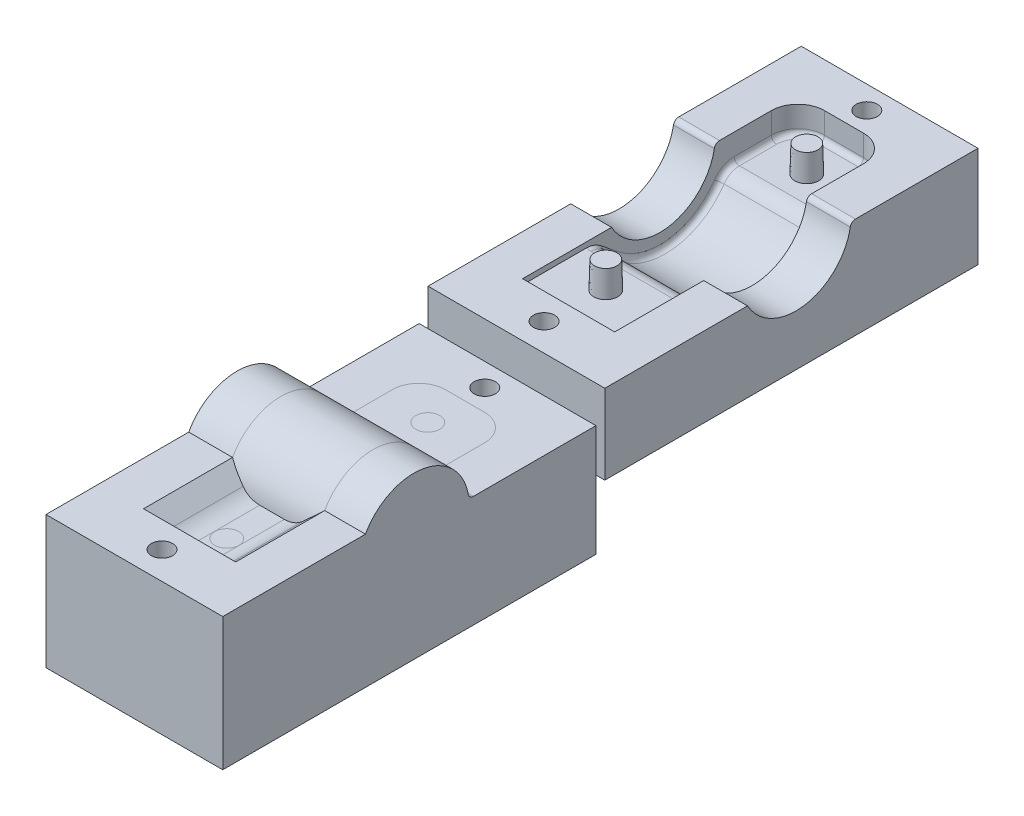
ISO-10303-21;
HEADER;
FILE_DESCRIPTION(('STEP AP214'),'2;1');
FILE_NAME('part.step','',(''),(''),'','','');
FILE_SCHEMA(('AUTOMOTIVE_DESIGN { 1 0 10303 214 1 1 1 1 }'));
ENDSEC;
DATA;
#1=APPLICATION_CONTEXT('core data for automotive mechanical design processes');
#2=APPLICATION_PROTOCOL_DEFINITION('international standard','automotive_design',2000,#1);
#3=PRODUCT_CONTEXT('',#1,'mechanical');
#4=PRODUCT('Part','Part','',(#3));
#5=PRODUCT_RELATED_PRODUCT_CATEGORY('part','',(#4));
#6=PRODUCT_DEFINITION_FORMATION('','',#4);
#7=PRODUCT_DEFINITION_CONTEXT('part definition',#1,'design');
#8=PRODUCT_DEFINITION('design','',#6,#7);
#9=PRODUCT_DEFINITION_SHAPE('','',#8);
#10=(LENGTH_UNIT() NAMED_UNIT(*) SI_UNIT(.MILLI.,.METRE.));
#11=(NAMED_UNIT(*) PLANE_ANGLE_UNIT() SI_UNIT($,.RADIAN.));
#12=(NAMED_UNIT(*) SI_UNIT($,.STERADIAN.) SOLID_ANGLE_UNIT());
#13=UNCERTAINTY_MEASURE_WITH_UNIT(LENGTH_MEASURE(1.E-05),#10,'distance_accuracy_value','');
#14=(GEOMETRIC_REPRESENTATION_CONTEXT(3) GLOBAL_UNCERTAINTY_ASSIGNED_CONTEXT((#13)) GLOBAL_UNIT_ASSIGNED_CONTEXT((#10,
#11,#12)) REPRESENTATION_CONTEXT('',''));
#15=CARTESIAN_POINT('',(0.,0.,0.));
#16=DIRECTION('',(0.,0.,1.));
#17=DIRECTION('',(1.,0.,0.));
#18=AXIS2_PLACEMENT_3D('',#15,#16,#17);
#19=CARTESIAN_POINT('',(-74.9087402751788,-12.4178817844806,-35.8159441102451));
#20=DIRECTION('',(0.,1.,0.));
#21=DIRECTION('',(0.,0.,-1.));
#22=AXIS2_PLACEMENT_3D('',#19,#20,#21);
#23=PLANE('',#22);
#24=CARTESIAN_POINT('',(-59.6224281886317,-12.4178817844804,-65.8157199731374));
#25=DIRECTION('',(0.,1.,0.));
#26=DIRECTION('',(0.,0.,-1.));
#27=AXIS2_PLACEMENT_3D('',#24,#25,#26);
#28=CIRCLE('',#27,2.);
#29=CARTESIAN_POINT('',(-59.6224281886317,-12.4178817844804,-67.8157199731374));
#30=VERTEX_POINT('',#29);
#31=EDGE_CURVE('P0_E912',#30,#30,#28,.T.);
#32=ORIENTED_EDGE('',*,*,#31,.T.);
#33=EDGE_LOOP('',(#32));
#34=FACE_BOUND('',#33,.T.);
#35=CARTESIAN_POINT('',(-59.6224281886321,-12.4178817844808,-5.01516901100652));
#36=DIRECTION('',(0.,1.,0.));
#37=DIRECTION('',(0.,0.,-1.));
#38=AXIS2_PLACEMENT_3D('',#35,#36,#37);
#39=CIRCLE('',#38,2.);
#40=CARTESIAN_POINT('',(-59.6224281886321,-12.4178817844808,-7.01516901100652));
#41=VERTEX_POINT('',#40);
#42=EDGE_CURVE('P0_E194',#41,#41,#39,.T.);
#43=ORIENTED_EDGE('',*,*,#42,.T.);
#44=EDGE_LOOP('',(#43));
#45=FACE_BOUND('',#44,.T.);
#46=DIRECTION('',(0.,0.,1.));
#47=VECTOR('',#46,1.);
#48=CARTESIAN_POINT('',(-42.9729470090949,-12.4178817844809,0.184489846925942));
#49=LINE('',#48,#47);
#50=CARTESIAN_POINT('',(-42.9729470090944,-12.4178817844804,-70.1133195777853));
#51=VERTEX_POINT('',#50);
#52=CARTESIAN_POINT('',(-42.9729470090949,-12.4178817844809,0.184489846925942));
#53=VERTEX_POINT('',#52);
#54=EDGE_CURVE('P0_E192',#51,#53,#49,.T.);
#55=ORIENTED_EDGE('',*,*,#54,.T.);
#56=DIRECTION('',(-1.,0.,0.));
#57=VECTOR('',#56,1.);
#58=CARTESIAN_POINT('',(-42.9729470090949,-12.4178817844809,0.184489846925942));
#59=LINE('',#58,#57);
#60=CARTESIAN_POINT('',(-76.2719093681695,-12.4178817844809,0.184489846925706));
#61=VERTEX_POINT('',#60);
#62=EDGE_CURVE('P0_E175',#53,#61,#59,.T.);
#63=ORIENTED_EDGE('',*,*,#62,.T.);
#64=DIRECTION('',(0.,0.,-1.));
#65=VECTOR('',#64,1.);
#66=CARTESIAN_POINT('',(-76.2719093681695,-12.4178817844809,0.184489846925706));
#67=LINE('',#66,#65);
#68=CARTESIAN_POINT('',(-76.271909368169,-12.4178817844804,-70.1133195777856));
#69=VERTEX_POINT('',#68);
#70=EDGE_CURVE('P0_E196',#61,#69,#67,.T.);
#71=ORIENTED_EDGE('',*,*,#70,.T.);
#72=DIRECTION('',(1.,0.,0.));
#73=VECTOR('',#72,1.);
#74=CARTESIAN_POINT('',(-42.9729470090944,-12.4178817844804,-70.1133195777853));
#75=LINE('',#74,#73);
#76=EDGE_CURVE('P0_E199',#69,#51,#75,.T.);
#77=ORIENTED_EDGE('',*,*,#76,.T.);
#78=EDGE_LOOP('',(#55,#63,#71,#77));
#79=FACE_BOUND('',#78,.T.);
#80=ADVANCED_FACE('P0_F16',(#34,#45,#79),#23,.F.);
#81=CARTESIAN_POINT('',(-42.9729470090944,-12.4178817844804,-70.1133195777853));
#82=DIRECTION('',(0.,0.,1.));
#83=DIRECTION('',(-1.,0.,0.));
#84=AXIS2_PLACEMENT_3D('',#81,#82,#83);
#85=PLANE('',#84);
#86=DIRECTION('',(0.,1.,0.));
#87=VECTOR('',#86,1.);
#88=CARTESIAN_POINT('',(-76.271909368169,-12.4178817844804,-70.1133195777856));
#89=LINE('',#88,#87);
#90=CARTESIAN_POINT('',(-76.271909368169,6.58211821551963,-70.1133195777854));
#91=VERTEX_POINT('',#90);
#92=EDGE_CURVE('P0_E204',#69,#91,#89,.T.);
#93=ORIENTED_EDGE('',*,*,#92,.T.);
#94=DIRECTION('',(1.,0.,0.));
#95=VECTOR('',#94,1.);
#96=CARTESIAN_POINT('',(-42.9729470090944,6.58211821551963,-70.1133195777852));
#97=LINE('',#96,#95);
#98=CARTESIAN_POINT('',(-42.9729470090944,6.58211821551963,-70.1133195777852));
#99=VERTEX_POINT('',#98);
#100=EDGE_CURVE('P0_E179',#91,#99,#97,.T.);
#101=ORIENTED_EDGE('',*,*,#100,.T.);
#102=DIRECTION('',(0.,1.,0.));
#103=VECTOR('',#102,1.);
#104=CARTESIAN_POINT('',(-42.9729470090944,-12.4178817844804,-70.1133195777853));
#105=LINE('',#104,#103);
#106=EDGE_CURVE('P0_E202',#51,#99,#105,.T.);
#107=ORIENTED_EDGE('',*,*,#106,.F.);
#108=ORIENTED_EDGE('',*,*,#76,.F.);
#109=EDGE_LOOP('',(#93,#101,#107,#108));
#110=FACE_BOUND('',#109,.T.);
#111=ADVANCED_FACE('P0_F945',(#110),#85,.F.);
#112=CARTESIAN_POINT('',(-76.2719093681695,-12.4178817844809,0.184489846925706));
#113=DIRECTION('',(1.,0.,0.));
#114=DIRECTION('',(0.,0.,1.));
#115=AXIS2_PLACEMENT_3D('',#112,#113,#114);
#116=PLANE('',#115);
#117=CARTESIAN_POINT('',(-76.2719093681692,5.75755572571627,-46.0546460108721));
#118=CARTESIAN_POINT('',(-76.2719093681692,5.78578374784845,-46.0599823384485));
#119=CARTESIAN_POINT('',(-76.2719093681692,5.81380331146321,-46.0664431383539));
#120=CARTESIAN_POINT('',(-76.2719093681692,5.86923717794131,-46.0816220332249));
#121=CARTESIAN_POINT('',(-76.2719093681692,5.89665119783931,-46.0903411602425));
#122=CARTESIAN_POINT('',(-76.2719093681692,5.95064329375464,-46.1100343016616));
#123=CARTESIAN_POINT('',(-76.2719093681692,5.97722185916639,-46.1210069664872));
#124=CARTESIAN_POINT('',(-76.2719093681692,6.02932908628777,-46.1451858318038));
#125=CARTESIAN_POINT('',(-76.2719093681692,6.05485796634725,-46.158391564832));
#126=CARTESIAN_POINT('',(-76.2719093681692,6.12967167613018,-46.2013251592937));
#127=CARTESIAN_POINT('',(-76.2719093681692,6.17711805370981,-46.2343456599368));
#128=CARTESIAN_POINT('',(-76.2719093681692,6.26564441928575,-46.3079543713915));
#129=CARTESIAN_POINT('',(-76.2719093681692,6.30672648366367,-46.3485401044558));
#130=CARTESIAN_POINT('',(-76.2719093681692,6.38074478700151,-46.4353129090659));
#131=CARTESIAN_POINT('',(-76.2719093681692,6.4138129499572,-46.4813874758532));
#132=CARTESIAN_POINT('',(-76.2719093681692,6.47171993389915,-46.5784991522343));
#133=CARTESIAN_POINT('',(-76.2719093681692,6.49655767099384,-46.6295369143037));
#134=CARTESIAN_POINT('',(-76.2719093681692,6.52767750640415,-46.7106383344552));
#135=CARTESIAN_POINT('',(-76.2719093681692,6.53722906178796,-46.7394877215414));
#136=CARTESIAN_POINT('',(-76.2719093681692,6.55359255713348,-46.7979751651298));
#137=CARTESIAN_POINT('',(-76.2719093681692,6.56040371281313,-46.8276134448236));
#138=CARTESIAN_POINT('',(-76.2719093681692,6.57115328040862,-46.8874618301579));
#139=CARTESIAN_POINT('',(-76.2719093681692,6.57508536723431,-46.9176730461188));
#140=CARTESIAN_POINT('',(-76.2719093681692,6.58041185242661,-46.9783099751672));
#141=CARTESIAN_POINT('',(-76.2719093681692,6.58180739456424,-47.0087355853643));
#142=CARTESIAN_POINT('',(-76.2719093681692,6.58211592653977,-47.039135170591));
#143=B_SPLINE_CURVE_WITH_KNOTS('',3,(#117,#118,#119,#120,#121,#122,#123,#124,#125,#126,#127,
#128,#129,#130,#131,#132,#133,#134,#135,#136,#137,#138,#139,#140,#141,#142),.UNSPECIFIED.,.F.,
.F.,(4,2,2,2,2,2,2,2,2,2,2,2,4),(0.,0.0861669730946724,0.172373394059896,0.258528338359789,
0.344665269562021,0.517145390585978,0.689569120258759,0.858925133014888,1.02830343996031,
1.11936043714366,1.21044347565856,1.30172602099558,1.39296739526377),.UNSPECIFIED.);
#144=CARTESIAN_POINT('',(-76.2719093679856,5.75756509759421,-46.0546217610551));
#145=VERTEX_POINT('',#144);
#146=CARTESIAN_POINT('',(-76.2719093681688,6.58211707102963,-47.0391347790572));
#147=VERTEX_POINT('',#146);
#148=EDGE_CURVE('P0_E598',#145,#147,#143,.T.);
#149=ORIENTED_EDGE('',*,*,#148,.T.);
#150=DIRECTION('',(0.,0.,-1.));
#151=VECTOR('',#150,1.);
#152=CARTESIAN_POINT('',(-76.2719093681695,6.58211821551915,0.184489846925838));
#153=LINE('',#152,#151);
#154=EDGE_CURVE('P0_E594',#147,#91,#153,.T.);
#155=ORIENTED_EDGE('',*,*,#154,.T.);
#156=ORIENTED_EDGE('',*,*,#92,.F.);
#157=ORIENTED_EDGE('',*,*,#70,.F.);
#158=DIRECTION('',(0.,1.,0.));
#159=VECTOR('',#158,1.);
#160=CARTESIAN_POINT('',(-76.2719093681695,-12.4178817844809,0.184489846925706));
#161=LINE('',#160,#159);
#162=CARTESIAN_POINT('',(-76.2719093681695,2.58211821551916,0.18448984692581));
#163=VERTEX_POINT('',#162);
#164=EDGE_CURVE('P0_E180',#61,#163,#161,.T.);
#165=ORIENTED_EDGE('',*,*,#164,.T.);
#166=DIRECTION('',(0.,0.,-1.));
#167=VECTOR('',#166,1.);
#168=CARTESIAN_POINT('',(-76.2719093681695,2.58211821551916,0.18448984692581));
#169=LINE('',#168,#167);
#170=CARTESIAN_POINT('',(-76.27190936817,2.58211821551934,-26.696807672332));
#171=VERTEX_POINT('',#170);
#172=EDGE_CURVE('P0_E164',#163,#171,#169,.T.);
#173=ORIENTED_EDGE('',*,*,#172,.T.);
#174=CARTESIAN_POINT('',(-76.2719093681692,5.75757446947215,-46.054597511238));
#175=CARTESIAN_POINT('',(-76.2719093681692,5.61298214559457,-46.0283784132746));
#176=CARTESIAN_POINT('',(-76.2719093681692,5.46890494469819,-45.9992926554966));
#177=CARTESIAN_POINT('',(-76.2719093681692,5.18203675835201,-45.9353046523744));
#178=CARTESIAN_POINT('',(-76.2719093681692,5.0392458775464,-45.900401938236));
#179=CARTESIAN_POINT('',(-76.2719093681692,4.75522596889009,-45.8247000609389));
#180=CARTESIAN_POINT('',(-76.2719093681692,4.61399698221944,-45.7839007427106));
#181=CARTESIAN_POINT('',(-76.2719093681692,4.33341533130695,-45.6963310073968));
#182=CARTESIAN_POINT('',(-76.2719093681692,4.19406262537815,-45.6495607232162));
#183=CARTESIAN_POINT('',(-76.2719093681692,3.77947074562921,-45.5004591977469));
#184=CARTESIAN_POINT('',(-76.2719093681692,3.50736402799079,-45.3892485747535));
#185=CARTESIAN_POINT('',(-76.2719093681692,2.97365409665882,-45.1440988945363));
#186=CARTESIAN_POINT('',(-76.2719093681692,2.71205039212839,-45.0101609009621));
#187=CARTESIAN_POINT('',(-76.2719093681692,2.20092489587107,-44.7204276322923));
#188=CARTESIAN_POINT('',(-76.2719093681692,1.95141388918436,-44.5646133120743));
#189=CARTESIAN_POINT('',(-76.2719093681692,1.46640996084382,-44.2322907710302));
#190=CARTESIAN_POINT('',(-76.2719093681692,1.230923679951,-44.0557728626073));
#191=CARTESIAN_POINT('',(-76.2719093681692,0.775786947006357,-43.6835353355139));
#192=CARTESIAN_POINT('',(-76.2719093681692,0.556131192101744,-43.4878221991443));
#193=CARTESIAN_POINT('',(-76.2719093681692,0.134085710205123,-43.0785891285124));
#194=CARTESIAN_POINT('',(-76.2719093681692,-0.0683039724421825,-42.8650691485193));
#195=CARTESIAN_POINT('',(-76.2719093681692,-0.453683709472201,-42.422536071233));
#196=CARTESIAN_POINT('',(-76.2719093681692,-0.636740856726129,-42.1935813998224));
#197=CARTESIAN_POINT('',(-76.2719093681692,-0.982900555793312,-41.7211371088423));
#198=CARTESIAN_POINT('',(-76.2719093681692,-1.14600806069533,-41.4776511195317));
#199=CARTESIAN_POINT('',(-76.2719093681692,-1.45099232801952,-40.9778230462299));
#200=CARTESIAN_POINT('',(-76.2719093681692,-1.59287536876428,-40.72148479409));
#201=CARTESIAN_POINT('',(-76.2719093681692,-1.85455183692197,-40.1974625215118));
#202=CARTESIAN_POINT('',(-76.2719093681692,-1.97432382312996,-39.9297677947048));
#203=CARTESIAN_POINT('',(-76.2719093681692,-2.19048191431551,-39.3860014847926));
#204=CARTESIAN_POINT('',(-76.2719093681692,-2.28693504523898,-39.1099565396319));
#205=CARTESIAN_POINT('',(-76.2719093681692,-2.45627427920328,-38.5505924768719));
#206=CARTESIAN_POINT('',(-76.2719093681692,-2.52914953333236,-38.2672700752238));
#207=CARTESIAN_POINT('',(-76.2719093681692,-2.65080499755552,-37.6955616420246));
#208=CARTESIAN_POINT('',(-76.2719093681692,-2.69959016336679,-37.4071766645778));
#209=CARTESIAN_POINT('',(-76.2719093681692,-2.77276610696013,-36.8273282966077));
#210=CARTESIAN_POINT('',(-76.2719093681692,-2.79715700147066,-36.5358649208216));
#211=CARTESIAN_POINT('',(-76.2719093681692,-2.82130462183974,-35.9514880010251));
#212=CARTESIAN_POINT('',(-76.2719093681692,-2.82102507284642,-35.6585729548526));
#213=CARTESIAN_POINT('',(-76.2719093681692,-2.79572879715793,-35.0741011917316));
#214=CARTESIAN_POINT('',(-76.2719093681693,-2.77073644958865,-34.7825434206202));
#215=CARTESIAN_POINT('',(-76.2719093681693,-2.69615076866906,-34.202490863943));
#216=CARTESIAN_POINT('',(-76.2719093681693,-2.64654912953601,-33.9139971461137));
#217=CARTESIAN_POINT('',(-76.2719093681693,-2.5231451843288,-33.342162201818));
#218=CARTESIAN_POINT('',(-76.2719093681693,-2.44933692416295,-33.0588222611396));
#219=CARTESIAN_POINT('',(-76.2719093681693,-2.27843512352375,-32.5001638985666));
#220=CARTESIAN_POINT('',(-76.2719093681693,-2.18141026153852,-32.2248244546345));
#221=CARTESIAN_POINT('',(-76.2719093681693,-1.96470638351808,-31.6832252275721));
#222=CARTESIAN_POINT('',(-76.2719093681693,-1.84502841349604,-31.4169650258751));
#223=CARTESIAN_POINT('',(-76.2719093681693,-1.58380453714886,-30.895257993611));
#224=CARTESIAN_POINT('',(-76.2719093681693,-1.44224959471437,-30.6398156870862));
#225=CARTESIAN_POINT('',(-76.2719093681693,-1.13824577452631,-30.1416897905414));
#226=CARTESIAN_POINT('',(-76.2719093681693,-0.975797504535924,-29.8990058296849));
#227=CARTESIAN_POINT('',(-76.2719093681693,-0.629717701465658,-29.4263015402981));
#228=CARTESIAN_POINT('',(-76.2719093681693,-0.445929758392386,-29.1963956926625));
#229=CARTESIAN_POINT('',(-76.2719093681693,-0.0594926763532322,-28.7530231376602));
#230=CARTESIAN_POINT('',(-76.2719093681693,0.14315608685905,-28.539556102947));
#231=CARTESIAN_POINT('',(-76.2719093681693,0.565639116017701,-28.1309636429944));
#232=CARTESIAN_POINT('',(-76.2719093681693,0.785450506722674,-27.9358145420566));
#233=CARTESIAN_POINT('',(-76.2719093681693,1.24086764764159,-27.565168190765));
#234=CARTESIAN_POINT('',(-76.2719093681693,1.47646155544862,-27.3896564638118));
#235=CARTESIAN_POINT('',(-76.2719093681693,1.78887388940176,-27.1771762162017));
#236=CARTESIAN_POINT('',(-76.2719093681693,1.85925996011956,-27.1305695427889));
#237=CARTESIAN_POINT('',(-76.2719093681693,2.00115970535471,-27.0391241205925));
#238=CARTESIAN_POINT('',(-76.2719093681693,2.07267317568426,-26.9942850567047));
#239=CARTESIAN_POINT('',(-76.2719093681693,2.21666421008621,-26.9064463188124));
#240=CARTESIAN_POINT('',(-76.2719093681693,2.28914009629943,-26.8634438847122));
#241=CARTESIAN_POINT('',(-76.2719093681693,2.43500813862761,-26.7789953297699));
#242=CARTESIAN_POINT('',(-76.2719093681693,2.50840042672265,-26.7375494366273));
#243=CARTESIAN_POINT('',(-76.2719093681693,2.58216188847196,-26.6967835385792));
#244=B_SPLINE_CURVE_WITH_KNOTS('',3,(#174,#175,#176,#177,#178,#179,#180,#181,#182,#183,#184,
#185,#186,#187,#188,#189,#190,#191,#192,#193,#194,#195,#196,#197,#198,#199,#200,#201,#202,#203,
#204,#205,#206,#207,#208,#209,#210,#211,#212,#213,#214,#215,#216,#217,#218,#219,#220,#221,#222,
#223,#224,#225,#226,#227,#228,#229,#230,#231,#232,#233,#234,#235,#236,#237,#238,#239,#240,#241,
#242,#243),.UNSPECIFIED.,.F.,.F.,(4,2,2,2,2,2,2,2,2,2,2,2,2,2,2,2,2,2,2,2,2,2,2,2,2,2,2,2,2,2,2,
2,2,2,4),(0.,0.440828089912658,0.881691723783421,1.32256695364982,1.76343237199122,
2.64413050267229,3.52478742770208,4.40621584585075,5.28805835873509,6.16960408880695,
7.05115208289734,7.92953253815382,8.80769446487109,9.68559611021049,10.5643446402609,
11.4405365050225,12.3171309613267,13.1935450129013,14.0699548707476,14.9476534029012,
15.8244869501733,16.7016166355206,17.5789622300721,18.453743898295,19.3284851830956,
20.2035887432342,21.0786668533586,21.9606205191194,22.8425566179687,23.723336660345,
24.6034630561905,24.8567025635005,25.1098967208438,25.362695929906,25.6155319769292),.UNSPECIFIED.);
#245=EDGE_CURVE('P0_E212',#145,#171,#244,.T.);
#246=ORIENTED_EDGE('',*,*,#245,.F.);
#247=EDGE_LOOP('',(#149,#155,#156,#157,#165,#173,#246));
#248=FACE_BOUND('',#247,.T.);
#249=ADVANCED_FACE('P0_F227',(#248),#116,.F.);
#250=CARTESIAN_POINT('',(-42.9729470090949,-12.4178817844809,0.184489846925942));
#251=DIRECTION('',(0.,0.,-1.));
#252=DIRECTION('',(1.,0.,0.));
#253=AXIS2_PLACEMENT_3D('',#250,#251,#252);
#254=PLANE('',#253);
#255=DIRECTION('',(0.,1.,0.));
#256=VECTOR('',#255,1.);
#257=CARTESIAN_POINT('',(-42.9729470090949,-12.4178817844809,0.184489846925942));
#258=LINE('',#257,#256);
#259=CARTESIAN_POINT('',(-42.9729470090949,2.58211821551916,0.184489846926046));
#260=VERTEX_POINT('',#259);
#261=EDGE_CURVE('P0_E171',#53,#260,#258,.T.);
#262=ORIENTED_EDGE('',*,*,#261,.T.);
#263=DIRECTION('',(-1.,0.,0.));
#264=VECTOR('',#263,1.);
#265=CARTESIAN_POINT('',(-42.9729470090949,2.58211821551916,0.184489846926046));
#266=LINE('',#265,#264);
#267=EDGE_CURVE('P0_E155',#260,#163,#266,.T.);
#268=ORIENTED_EDGE('',*,*,#267,.T.);
#269=ORIENTED_EDGE('',*,*,#164,.F.);
#270=ORIENTED_EDGE('',*,*,#62,.F.);
#271=EDGE_LOOP('',(#262,#268,#269,#270));
#272=FACE_BOUND('',#271,.T.);
#273=ADVANCED_FACE('P0_F172',(#272),#254,.F.);
#274=CARTESIAN_POINT('',(-42.9729470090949,-12.4178817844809,0.184489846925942));
#275=DIRECTION('',(-1.,0.,0.));
#276=DIRECTION('',(0.,0.,-1.));
#277=AXIS2_PLACEMENT_3D('',#274,#275,#276);
#278=PLANE('',#277);
#279=ORIENTED_EDGE('',*,*,#106,.T.);
#280=DIRECTION('',(0.,0.,1.));
#281=VECTOR('',#280,1.);
#282=CARTESIAN_POINT('',(-42.9729470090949,6.58211821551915,0.184489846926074));
#283=LINE('',#282,#281);
#284=CARTESIAN_POINT('',(-42.972947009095,6.58211698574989,-47.0391348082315));
#285=VERTEX_POINT('',#284);
#286=EDGE_CURVE('P0_E210',#99,#285,#283,.T.);
#287=ORIENTED_EDGE('',*,*,#286,.T.);
#288=CARTESIAN_POINT('',(-42.9729470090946,5.75755564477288,-46.0546461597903));
#289=CARTESIAN_POINT('',(-42.9729470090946,5.785828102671,-46.0600143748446));
#290=CARTESIAN_POINT('',(-42.9729470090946,5.81389205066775,-46.066504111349));
#291=CARTESIAN_POINT('',(-42.9729470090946,5.86941493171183,-46.0817390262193));
#292=CARTESIAN_POINT('',(-42.9729470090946,5.89687355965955,-46.0904853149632));
#293=CARTESIAN_POINT('',(-42.9729470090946,5.95095362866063,-46.1102346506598));
#294=CARTESIAN_POINT('',(-42.9729470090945,5.97757555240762,-46.121236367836));
#295=CARTESIAN_POINT('',(-42.9729470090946,6.02976498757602,-46.1454798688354));
#296=CARTESIAN_POINT('',(-42.9729470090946,6.05533273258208,-46.1587211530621));
#297=CARTESIAN_POINT('',(-42.9729470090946,6.13025979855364,-46.2017763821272));
#298=CARTESIAN_POINT('',(-42.9729470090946,6.1777710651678,-46.234895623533));
#299=CARTESIAN_POINT('',(-42.9729470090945,6.26639994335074,-46.308720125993));
#300=CARTESIAN_POINT('',(-42.9729470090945,6.30751965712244,-46.3494228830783));
#301=CARTESIAN_POINT('',(-42.9729470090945,6.38152630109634,-46.4363757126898));
#302=CARTESIAN_POINT('',(-42.9729470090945,6.4145565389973,-46.4825038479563));
#303=CARTESIAN_POINT('',(-42.9729470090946,6.47237322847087,-46.5797179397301));
#304=CARTESIAN_POINT('',(-42.9729470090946,6.49715880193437,-46.6308044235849));
#305=CARTESIAN_POINT('',(-42.9729470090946,6.52813307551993,-46.7118568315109));
#306=CARTESIAN_POINT('',(-42.9729470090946,6.53761150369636,-46.7406061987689));
#307=CARTESIAN_POINT('',(-42.9729470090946,6.55384357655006,-46.7988865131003));
#308=CARTESIAN_POINT('',(-42.9729470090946,6.5605964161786,-46.8284176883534));
#309=CARTESIAN_POINT('',(-42.9729470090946,6.57124093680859,-46.8880457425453));
#310=CARTESIAN_POINT('',(-42.9729470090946,6.57512632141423,-46.9181437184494));
#311=CARTESIAN_POINT('',(-42.9729470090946,6.58039724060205,-46.9785488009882));
#312=CARTESIAN_POINT('',(-42.9729470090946,6.58178397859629,-47.0088557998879));
#313=CARTESIAN_POINT('',(-42.9729470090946,6.58211575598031,-47.0391352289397));
#314=B_SPLINE_CURVE_WITH_KNOTS('',3,(#288,#289,#290,#291,#292,#293,#294,#295,#296,#297,#298,
#299,#300,#301,#302,#303,#304,#305,#306,#307,#308,#309,#310,#311,#312,#313),.UNSPECIFIED.,.F.,
.F.,(4,2,2,2,2,2,2,2,2,2,2,2,4),(0.,0.0863163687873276,0.172675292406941,0.258983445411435,
0.34527237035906,0.518076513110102,0.690823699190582,0.860243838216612,1.02968201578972,
1.12038642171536,1.21111759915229,1.3020474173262,1.39293342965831),.UNSPECIFIED.);
#315=CARTESIAN_POINT('',(-42.9729470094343,5.75756989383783,-46.0546121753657));
#316=VERTEX_POINT('',#315);
#317=EDGE_CURVE('P0_E188',#316,#285,#314,.T.);
#318=ORIENTED_EDGE('',*,*,#317,.F.);
#319=CARTESIAN_POINT('',(-42.9729470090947,2.5821521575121,-26.6967749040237));
#320=CARTESIAN_POINT('',(-42.9729470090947,2.45347924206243,-26.7678719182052));
#321=CARTESIAN_POINT('',(-42.9729470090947,2.32620489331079,-26.8415104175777));
#322=CARTESIAN_POINT('',(-42.9729470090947,2.0747256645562,-26.9938763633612));
#323=CARTESIAN_POINT('',(-42.9729470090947,1.95052105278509,-27.0726042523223));
#324=CARTESIAN_POINT('',(-42.9729470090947,1.70547233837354,-27.2351450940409));
#325=CARTESIAN_POINT('',(-42.9729470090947,1.58462834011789,-27.318958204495));
#326=CARTESIAN_POINT('',(-42.9729470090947,1.34663023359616,-27.4916485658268));
#327=CARTESIAN_POINT('',(-42.9729470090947,1.22947603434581,-27.5805256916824));
#328=CARTESIAN_POINT('',(-42.9729470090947,0.884115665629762,-27.8543882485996));
#329=CARTESIAN_POINT('',(-42.9729470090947,0.661722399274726,-28.0467964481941));
#330=CARTESIAN_POINT('',(-42.9729470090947,0.234169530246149,-28.4498102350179));
#331=CARTESIAN_POINT('',(-42.9729470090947,0.0290090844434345,-28.6604149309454));
#332=CARTESIAN_POINT('',(-42.9729470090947,-0.362869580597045,-29.0984993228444));
#333=CARTESIAN_POINT('',(-42.9729470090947,-0.549570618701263,-29.3259944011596));
#334=CARTESIAN_POINT('',(-42.9729470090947,-0.903053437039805,-29.7961281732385));
#335=CARTESIAN_POINT('',(-42.9729470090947,-1.06982579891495,-30.038773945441));
#336=CARTESIAN_POINT('',(-42.9729470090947,-1.38220929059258,-30.5372075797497));
#337=CARTESIAN_POINT('',(-42.9729470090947,-1.52782751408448,-30.7929909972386));
#338=CARTESIAN_POINT('',(-42.9729470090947,-1.79699541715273,-31.3159174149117));
#339=CARTESIAN_POINT('',(-42.9729470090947,-1.92054504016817,-31.5830604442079));
#340=CARTESIAN_POINT('',(-42.9729470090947,-2.14424575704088,-32.1257145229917));
#341=CARTESIAN_POINT('',(-42.9729470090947,-2.2444888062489,-32.4011876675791));
#342=CARTESIAN_POINT('',(-42.9729470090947,-2.42142182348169,-32.9595249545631));
#343=CARTESIAN_POINT('',(-42.9729470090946,-2.4981176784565,-33.2423872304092));
#344=CARTESIAN_POINT('',(-42.9729470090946,-2.62727679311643,-33.8135052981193));
#345=CARTESIAN_POINT('',(-42.9729470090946,-2.67974728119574,-34.1017594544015));
#346=CARTESIAN_POINT('',(-42.9729470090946,-2.76012707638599,-34.6819552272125));
#347=CARTESIAN_POINT('',(-42.9729470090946,-2.78801261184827,-34.9739001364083));
#348=CARTESIAN_POINT('',(-42.9729470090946,-2.81894820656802,-35.5582418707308));
#349=CARTESIAN_POINT('',(-42.9729470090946,-2.82207088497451,-35.8506348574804));
#350=CARTESIAN_POINT('',(-42.9729470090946,-2.8036630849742,-36.4347775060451));
#351=CARTESIAN_POINT('',(-42.9729470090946,-2.7821212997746,-36.7265268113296));
#352=CARTESIAN_POINT('',(-42.9729470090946,-2.71458443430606,-37.3071183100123));
#353=CARTESIAN_POINT('',(-42.9729470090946,-2.66859439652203,-37.5959610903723));
#354=CARTESIAN_POINT('',(-42.9729470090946,-2.55251159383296,-38.1687619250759));
#355=CARTESIAN_POINT('',(-42.9729470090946,-2.48241893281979,-38.452720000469));
#356=CARTESIAN_POINT('',(-42.9729470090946,-2.31843488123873,-39.0141204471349));
#357=CARTESIAN_POINT('',(-42.9729470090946,-2.22450972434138,-39.2915529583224));
#358=CARTESIAN_POINT('',(-42.9729470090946,-2.01365936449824,-39.8372226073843));
#359=CARTESIAN_POINT('',(-42.9729470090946,-1.89675692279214,-40.1054685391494));
#360=CARTESIAN_POINT('',(-42.9729470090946,-1.64062032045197,-40.6311916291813));
#361=CARTESIAN_POINT('',(-42.9729470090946,-1.50137858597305,-40.8886650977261));
#362=CARTESIAN_POINT('',(-42.9729470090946,-1.20161335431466,-41.3909917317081));
#363=CARTESIAN_POINT('',(-42.9729470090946,-1.04108462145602,-41.6358417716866));
#364=CARTESIAN_POINT('',(-42.9729470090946,-0.700529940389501,-42.1105073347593));
#365=CARTESIAN_POINT('',(-42.9729470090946,-0.520561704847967,-42.3403642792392));
#366=CARTESIAN_POINT('',(-42.9729470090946,-0.142069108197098,-42.7842367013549));
#367=CARTESIAN_POINT('',(-42.9729470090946,0.0564544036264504,-42.998252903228));
#368=CARTESIAN_POINT('',(-42.9729470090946,0.470759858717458,-43.4090536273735));
#369=CARTESIAN_POINT('',(-42.9729470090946,0.686548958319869,-43.60583093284));
#370=CARTESIAN_POINT('',(-42.9729470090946,1.13384334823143,-43.9806189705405));
#371=CARTESIAN_POINT('',(-42.9729470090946,1.3653481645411,-44.1586302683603));
#372=CARTESIAN_POINT('',(-42.9729470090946,1.84443274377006,-44.4959175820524));
#373=CARTESIAN_POINT('',(-42.9729470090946,2.09212719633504,-44.65503073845));
#374=CARTESIAN_POINT('',(-42.9729470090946,2.60013739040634,-44.9516402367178));
#375=CARTESIAN_POINT('',(-42.9729470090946,2.86045287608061,-45.0891370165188));
#376=CARTESIAN_POINT('',(-42.9729470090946,3.39148631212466,-45.3412294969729));
#377=CARTESIAN_POINT('',(-42.9729470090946,3.66218918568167,-45.4558569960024));
#378=CARTESIAN_POINT('',(-42.9729470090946,4.21232937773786,-45.6614363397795));
#379=CARTESIAN_POINT('',(-42.9729470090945,4.491761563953,-45.7524018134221));
#380=CARTESIAN_POINT('',(-42.9729470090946,4.85552152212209,-45.8537180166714));
#381=CARTESIAN_POINT('',(-42.9729470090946,4.93683104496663,-45.8752853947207));
#382=CARTESIAN_POINT('',(-42.9729470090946,5.09995050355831,-45.9163952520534));
#383=CARTESIAN_POINT('',(-42.9729470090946,5.18176034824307,-45.9359380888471));
#384=CARTESIAN_POINT('',(-42.9729470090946,5.34570289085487,-45.9729864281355));
#385=CARTESIAN_POINT('',(-42.9729470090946,5.42783488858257,-45.9904950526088));
#386=CARTESIAN_POINT('',(-42.9729470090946,5.59246321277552,-46.0237749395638));
#387=CARTESIAN_POINT('',(-42.9729470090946,5.67495958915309,-46.0395459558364));
#388=CARTESIAN_POINT('',(-42.9729470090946,5.75758414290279,-46.054578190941));
#389=B_SPLINE_CURVE_WITH_KNOTS('',3,(#319,#320,#321,#322,#323,#324,#325,#326,#327,#328,#329,
#330,#331,#332,#333,#334,#335,#336,#337,#338,#339,#340,#341,#342,#343,#344,#345,#346,#347,#348,
#349,#350,#351,#352,#353,#354,#355,#356,#357,#358,#359,#360,#361,#362,#363,#364,#365,#366,#367,
#368,#369,#370,#371,#372,#373,#374,#375,#376,#377,#378,#379,#380,#381,#382,#383,#384,#385,#386,
#387,#388),.UNSPECIFIED.,.F.,.F.,(4,2,2,2,2,2,2,2,2,2,2,2,2,2,2,2,2,2,2,2,2,2,2,2,2,2,2,2,2,2,2,
2,2,2,4),(0.,0.441003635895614,0.882045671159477,1.32310139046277,1.76414622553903,
2.64519828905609,3.52620722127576,4.4080285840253,5.29026506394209,6.17220501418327,
7.05414722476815,7.93254836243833,8.81072971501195,9.68864886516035,10.5674159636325,
11.4436050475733,12.3201959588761,13.1966061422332,14.0730125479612,14.9506676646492,
15.8274577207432,16.704545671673,17.5818497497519,18.4566173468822,19.3313449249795,
20.2064369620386,21.0815026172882,21.9636329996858,22.8457455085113,23.7266228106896,
24.6069916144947,24.8593414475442,25.1116466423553,25.363559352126,25.6155077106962),.UNSPECIFIED.);
#390=CARTESIAN_POINT('',(-42.9729470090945,2.58211821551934,-26.6967936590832));
#391=VERTEX_POINT('',#390);
#392=EDGE_CURVE('P0_E186',#391,#316,#389,.T.);
#393=ORIENTED_EDGE('',*,*,#392,.F.);
#394=DIRECTION('',(0.,0.,1.));
#395=VECTOR('',#394,1.);
#396=CARTESIAN_POINT('',(-42.9729470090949,2.58211821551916,0.184489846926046));
#397=LINE('',#396,#395);
#398=EDGE_CURVE('P0_E160',#391,#260,#397,.T.);
#399=ORIENTED_EDGE('',*,*,#398,.T.);
#400=ORIENTED_EDGE('',*,*,#261,.F.);
#401=ORIENTED_EDGE('',*,*,#54,.F.);
#402=EDGE_LOOP('',(#279,#287,#318,#393,#399,#400,#401));
#403=FACE_BOUND('',#402,.T.);
#404=ADVANCED_FACE('P0_F18',(#403),#278,.F.);
#405=CARTESIAN_POINT('',(-51.2304283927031,6.58211821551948,-47.0391343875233));
#406=CARTESIAN_POINT('',(-19.7304283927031,6.58210883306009,-47.0391375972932));
#407=CARTESIAN_POINT('',(-51.2304283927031,6.58211821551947,-46.9833940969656));
#408=CARTESIAN_POINT('',(-19.7304283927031,6.57967037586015,-46.985643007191));
#409=CARTESIAN_POINT('',(-51.2304283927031,6.55105985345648,-46.6135229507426));
#410=CARTESIAN_POINT('',(-19.7304283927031,6.56321887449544,-46.6247318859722));
#411=CARTESIAN_POINT('',(-51.2304283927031,6.26065892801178,-46.2141945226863));
#412=CARTESIAN_POINT('',(-19.7304283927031,6.25286902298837,-46.2107356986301));
#413=CARTESIAN_POINT('',(-51.2304283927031,5.86421912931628,-46.0736514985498));
#414=CARTESIAN_POINT('',(-19.7304283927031,5.85909632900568,-46.0774769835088));
#415=CARTESIAN_POINT('',(-51.2304283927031,5.7575568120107,-46.0546440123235));
#416=CARTESIAN_POINT('',(-19.7304283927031,5.75755235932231,-46.0546522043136));
#417=B_SPLINE_SURFACE_WITH_KNOTS('',3,1,((#405,#406),(#407,#408),(#409,#410),(#411,#412),(#413,
#414),(#415,#416)),.UNSPECIFIED.,.F.,.F.,.F.,(4,1,1,4),(2,2),(0.,0.115069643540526,
0.776338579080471,1.),(0.,1.),.UNSPECIFIED.);
#418=CARTESIAN_POINT('',(-19.7304283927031,6.58210883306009,-47.0391375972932));
#419=CARTESIAN_POINT('',(-51.2304283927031,6.58211821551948,-47.0391343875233));
#420=B_SPLINE_CURVE_WITH_KNOTS('',1,(#418,#419),.UNSPECIFIED.,.F.,.F.,(2,2),(0.,1.),.UNSPECIFIED.);
#421=CARTESIAN_POINT('',(-51.2304283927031,6.58211821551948,-47.0391343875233));
#422=VERTEX_POINT('',#421);
#423=EDGE_CURVE('P0_E604',#422,#285,#420,.F.);
#424=CARTESIAN_POINT('',(-51.2304283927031,6.58211821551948,-47.0391343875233));
#425=CARTESIAN_POINT('',(-51.2304283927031,6.58211981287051,-47.0110353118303));
#426=CARTESIAN_POINT('',(-51.2304283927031,6.58094739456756,-46.9829480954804));
#427=CARTESIAN_POINT('',(-51.2304283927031,6.57625018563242,-46.9269715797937));
#428=CARTESIAN_POINT('',(-51.2304283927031,6.57272541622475,-46.8990822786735));
#429=CARTESIAN_POINT('',(-51.2304283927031,6.5586343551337,-46.8160796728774));
#430=CARTESIAN_POINT('',(-51.2304283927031,6.5445513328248,-46.7615208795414));
#431=CARTESIAN_POINT('',(-51.2304283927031,6.50739572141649,-46.6555495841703));
#432=CARTESIAN_POINT('',(-51.2304283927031,6.48431736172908,-46.6041391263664));
#433=CARTESIAN_POINT('',(-51.2304283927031,6.42988178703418,-46.5059100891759));
#434=CARTESIAN_POINT('',(-51.2304283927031,6.39852567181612,-46.4590909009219));
#435=CARTESIAN_POINT('',(-51.2304283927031,6.32838084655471,-46.3712627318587));
#436=CARTESIAN_POINT('',(-51.2304283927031,6.28957891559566,-46.3302643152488));
#437=CARTESIAN_POINT('',(-51.2304283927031,6.20562964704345,-46.2553227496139));
#438=CARTESIAN_POINT('',(-51.2304283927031,6.16047891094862,-46.2213834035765));
#439=CARTESIAN_POINT('',(-51.2304283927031,6.06499567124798,-46.1615292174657));
#440=CARTESIAN_POINT('',(-51.2304283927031,6.01465115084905,-46.1356335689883));
#441=CARTESIAN_POINT('',(-51.2304283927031,5.91038389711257,-46.0927962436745));
#442=CARTESIAN_POINT('',(-51.2304283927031,5.85646940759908,-46.0758346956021));
#443=CARTESIAN_POINT('',(-51.2304283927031,5.78697451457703,-46.0602215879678));
#444=CARTESIAN_POINT('',(-51.2304283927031,5.7722916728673,-46.0572667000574));
#445=CARTESIAN_POINT('',(-51.2304283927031,5.7575568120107,-46.0546440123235));
#446=B_SPLINE_CURVE_WITH_KNOTS('',3,(#424,#425,#426,#427,#428,#429,#430,#431,#432,#433,#434,
#435,#436,#437,#438,#439,#440,#441,#442,#443,#444,#445),.UNSPECIFIED.,.F.,.F.,(4,2,2,2,2,2,2,2,
2,2,4),(0.,0.0842482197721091,0.168495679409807,0.336662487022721,0.504937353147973,
0.673189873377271,0.841743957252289,1.01038861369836,1.17943260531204,1.34809900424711,
1.39301376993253),.UNSPECIFIED.);
#447=CARTESIAN_POINT('',(-51.2304283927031,5.7575568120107,-46.0546440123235));
#448=VERTEX_POINT('',#447);
#449=EDGE_CURVE('P0_E589',#422,#448,#446,.T.);
#450=CARTESIAN_POINT('',(-51.2304283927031,5.7575568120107,-46.0546440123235));
#451=CARTESIAN_POINT('',(-19.7304283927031,5.75755235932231,-46.0546522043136));
#452=B_SPLINE_CURVE_WITH_KNOTS('',1,(#450,#451),.UNSPECIFIED.,.F.,.F.,(2,2),(0.,1.),.UNSPECIFIED.);
#453=EDGE_CURVE('P0_E333',#448,#316,#452,.T.);
#454=ORIENTED_EDGE('',*,*,#317,.T.);
#455=ORIENTED_EDGE('',*,*,#423,.F.);
#456=ORIENTED_EDGE('',*,*,#449,.T.);
#457=ORIENTED_EDGE('',*,*,#453,.T.);
#458=EDGE_LOOP('',(#454,#455,#456,#457));
#459=FACE_BOUND('',#458,.T.);
#460=ADVANCED_FACE('P0_F239',(#459),#417,.T.);
#461=CARTESIAN_POINT('',(-51.2304283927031,5.7575568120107,-46.0546440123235));
#462=CARTESIAN_POINT('',(-19.7304283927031,5.75766107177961,-46.054392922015));
#463=CARTESIAN_POINT('',(-51.2304283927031,5.57897763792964,-46.0228207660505));
#464=CARTESIAN_POINT('',(-19.7304283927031,5.58514245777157,-46.0211728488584));
#465=CARTESIAN_POINT('',(-51.2304283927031,3.98817345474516,-45.6963290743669));
#466=CARTESIAN_POINT('',(-19.730428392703,4.03424763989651,-45.7225335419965));
#467=CARTESIAN_POINT('',(-51.2304283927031,1.09704987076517,-44.3406444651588));
#468=CARTESIAN_POINT('',(-19.7304283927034,1.11657013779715,-44.3676078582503));
#469=CARTESIAN_POINT('',(-51.2304283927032,-1.6012878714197,-41.2325741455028));
#470=CARTESIAN_POINT('',(-19.7304283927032,-1.62988833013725,-41.1910321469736));
#471=CARTESIAN_POINT('',(-51.2304283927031,-2.49316098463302,-38.6428235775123));
#472=CARTESIAN_POINT('',(-19.7304283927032,-2.49911090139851,-38.606751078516));
#473=CARTESIAN_POINT('',(-51.2304283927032,-2.8824661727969,-36.2695656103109));
#474=CARTESIAN_POINT('',(-19.7304283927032,-2.87615040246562,-36.3084034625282));
#475=CARTESIAN_POINT('',(-51.2304283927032,-2.82699854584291,-33.410551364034));
#476=CARTESIAN_POINT('',(-19.7304283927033,-2.84278841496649,-33.4565821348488));
#477=CARTESIAN_POINT('',(-51.2304283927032,-1.27932463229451,-29.9266451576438));
#478=CARTESIAN_POINT('',(-19.730428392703,-1.26720065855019,-29.898321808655));
#479=CARTESIAN_POINT('',(-51.2304283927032,0.892290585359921,-27.7453025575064));
#480=CARTESIAN_POINT('',(-19.7304283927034,0.928078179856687,-27.7172967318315));
#481=CARTESIAN_POINT('',(-51.2304283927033,2.14756257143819,-26.9349974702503));
#482=CARTESIAN_POINT('',(-19.7304283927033,2.16435912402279,-26.9330184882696));
#483=CARTESIAN_POINT('',(-51.2304283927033,2.58211821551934,-26.6967336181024));
#484=CARTESIAN_POINT('',(-19.7304283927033,2.58224769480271,-26.6968911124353));
#485=B_SPLINE_SURFACE_WITH_KNOTS('',3,1,((#461,#462),(#463,#464),(#465,#466),(#467,#468),(#469,
#470),(#471,#472),(#473,#474),(#475,#476),(#477,#478),(#479,#480),(#481,#482),(#483,#484)),
.UNSPECIFIED.,.F.,.F.,.F.,(4,1,1,1,2,1,1,1,4),(2,2),(0.,0.0205677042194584,0.18489799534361,
0.368621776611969,0.5,0.641316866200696,0.828943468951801,0.943806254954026,1.),(0.,1.),.UNSPECIFIED.);
#486=CARTESIAN_POINT('',(-51.2304283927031,5.7575568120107,-46.0546440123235));
#487=CARTESIAN_POINT('',(-51.2304283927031,5.61363289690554,-46.0289972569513));
#488=CARTESIAN_POINT('',(-51.2304283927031,5.47026269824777,-46.0003395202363));
#489=CARTESIAN_POINT('',(-51.2304283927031,5.18485130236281,-45.9370282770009));
#490=CARTESIAN_POINT('',(-51.2304283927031,5.04281011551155,-45.9023747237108));
#491=CARTESIAN_POINT('',(-51.2304283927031,4.61908919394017,-45.7894798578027));
#492=CARTESIAN_POINT('',(-51.2304283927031,4.33973707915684,-45.70229098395));
#493=CARTESIAN_POINT('',(-51.2304283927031,3.78967440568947,-45.5047210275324));
#494=CARTESIAN_POINT('',(-51.2304283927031,3.51895649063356,-45.3943603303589));
#495=CARTESIAN_POINT('',(-51.2304283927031,2.9878011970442,-45.1511765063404));
#496=CARTESIAN_POINT('',(-51.2304283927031,2.7273636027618,-45.0183538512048));
#497=CARTESIAN_POINT('',(-51.2304283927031,2.21849424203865,-44.7311558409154));
#498=CARTESIAN_POINT('',(-51.2304283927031,1.97006835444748,-44.5767700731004));
#499=CARTESIAN_POINT('',(-51.2304283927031,1.48709344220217,-44.2476330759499));
#500=CARTESIAN_POINT('',(-51.2304283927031,1.2525445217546,-44.0728816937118));
#501=CARTESIAN_POINT('',(-51.2304283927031,0.798988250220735,-43.7043081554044));
#502=CARTESIAN_POINT('',(-51.2304283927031,0.579979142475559,-43.5104881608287));
#503=CARTESIAN_POINT('',(-51.2304283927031,0.159006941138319,-43.105147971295));
#504=CARTESIAN_POINT('',(-51.2304283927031,-0.0429562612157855,-42.8936278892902));
#505=CARTESIAN_POINT('',(-51.2304283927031,-0.428786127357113,-42.4539454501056));
#506=CARTESIAN_POINT('',(-51.2304283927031,-0.612616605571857,-42.225751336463));
#507=CARTESIAN_POINT('',(-51.2304283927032,-0.960402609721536,-41.7546859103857));
#508=CARTESIAN_POINT('',(-51.2304283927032,-1.12435800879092,-41.5118145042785));
#509=CARTESIAN_POINT('',(-51.2304283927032,-1.43119936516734,-41.0130758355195));
#510=CARTESIAN_POINT('',(-51.2304283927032,-1.57408339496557,-40.7572073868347));
#511=CARTESIAN_POINT('',(-51.2304283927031,-1.83769961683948,-40.2343036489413));
#512=CARTESIAN_POINT('',(-51.2304283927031,-1.9584319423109,-39.9672684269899));
#513=CARTESIAN_POINT('',(-51.2304283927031,-2.17665052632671,-39.4244637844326));
#514=CARTESIAN_POINT('',(-51.2304283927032,-2.27418134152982,-39.1487122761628));
#515=CARTESIAN_POINT('',(-51.2304283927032,-2.445620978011,-38.5899571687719));
#516=CARTESIAN_POINT('',(-51.2304283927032,-2.51952926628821,-38.3069534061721));
#517=CARTESIAN_POINT('',(-51.2304283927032,-2.6433395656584,-37.7357563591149));
#518=CARTESIAN_POINT('',(-51.2304283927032,-2.69324235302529,-37.44756324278));
#519=CARTESIAN_POINT('',(-51.2304283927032,-2.76873933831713,-36.8680115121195));
#520=CARTESIAN_POINT('',(-51.2304283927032,-2.79433386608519,-36.5766529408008));
#521=CARTESIAN_POINT('',(-51.2304283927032,-2.82087504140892,-35.9923290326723));
#522=CARTESIAN_POINT('',(-51.2304283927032,-2.82178093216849,-35.6993618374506));
#523=CARTESIAN_POINT('',(-51.2304283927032,-2.79880262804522,-35.1144016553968));
#524=CARTESIAN_POINT('',(-51.2304283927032,-2.77491843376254,-34.8224086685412));
#525=CARTESIAN_POINT('',(-51.2304283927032,-2.70255152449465,-34.2415721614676));
#526=CARTESIAN_POINT('',(-51.2304283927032,-2.65407580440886,-33.9527277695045));
#527=CARTESIAN_POINT('',(-51.2304283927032,-2.53289272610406,-33.38003256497));
#528=CARTESIAN_POINT('',(-51.2304283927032,-2.46017444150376,-33.0961840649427));
#529=CARTESIAN_POINT('',(-51.2304283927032,-2.29135281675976,-32.5365371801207));
#530=CARTESIAN_POINT('',(-51.2304283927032,-2.19532622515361,-32.2607156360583));
#531=CARTESIAN_POINT('',(-51.2304283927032,-1.98052419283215,-31.7182153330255));
#532=CARTESIAN_POINT('',(-51.2304283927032,-1.86175853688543,-31.4515326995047));
#533=CARTESIAN_POINT('',(-51.2304283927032,-1.60222331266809,-30.9289077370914));
#534=CARTESIAN_POINT('',(-51.2304283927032,-1.46144118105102,-30.6729716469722));
#535=CARTESIAN_POINT('',(-51.2304283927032,-1.15890393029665,-30.173819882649));
#536=CARTESIAN_POINT('',(-51.2304283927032,-0.997149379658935,-29.9306038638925));
#537=CARTESIAN_POINT('',(-51.2304283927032,-0.652925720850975,-29.4574580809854));
#538=CARTESIAN_POINT('',(-51.2304283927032,-0.47035831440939,-29.227599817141));
#539=CARTESIAN_POINT('',(-51.2304283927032,-0.0864305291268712,-28.7841596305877));
#540=CARTESIAN_POINT('',(-51.2304283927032,0.114929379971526,-28.5705773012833));
#541=CARTESIAN_POINT('',(-51.2304283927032,0.534740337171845,-28.1615224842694));
#542=CARTESIAN_POINT('',(-51.2304283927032,0.753168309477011,-27.9660262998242));
#543=CARTESIAN_POINT('',(-51.2304283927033,1.20570255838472,-27.5943048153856));
#544=CARTESIAN_POINT('',(-51.2304283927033,1.43980095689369,-27.4180699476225));
#545=CARTESIAN_POINT('',(-51.2304283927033,1.82637229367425,-27.1518594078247));
#546=CARTESIAN_POINT('',(-51.2304283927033,1.9744140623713,-27.0553844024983));
#547=CARTESIAN_POINT('',(-51.2304283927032,2.2749613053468,-26.8702247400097));
#548=CARTESIAN_POINT('',(-51.2304283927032,2.42745916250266,-26.7815277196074));
#549=CARTESIAN_POINT('',(-51.2304283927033,2.58211821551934,-26.6967336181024));
#550=B_SPLINE_CURVE_WITH_KNOTS('',3,(#486,#487,#488,#489,#490,#491,#492,#493,#494,#495,#496,
#497,#498,#499,#500,#501,#502,#503,#504,#505,#506,#507,#508,#509,#510,#511,#512,#513,#514,#515,
#516,#517,#518,#519,#520,#521,#522,#523,#524,#525,#526,#527,#528,#529,#530,#531,#532,#533,#534,
#535,#536,#537,#538,#539,#540,#541,#542,#543,#544,#545,#546,#547,#548,#549),.UNSPECIFIED.,.F.,
.F.,(4,2,2,2,2,2,2,2,2,2,2,2,2,2,2,2,2,2,2,2,2,2,2,2,2,2,2,2,2,2,2,4),(0.,0.438507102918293,
0.877017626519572,1.75381081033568,2.62983584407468,3.50584248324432,4.38227361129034,
5.25871131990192,6.13504979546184,7.01138267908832,7.88943041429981,8.76748375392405,
9.64561736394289,10.5237456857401,11.4001737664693,12.2766216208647,13.1530411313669,
14.0294487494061,14.9073030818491,15.7851573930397,16.6627621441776,17.5407629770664,
18.4159110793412,19.2906834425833,20.1659568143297,21.0412064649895,21.9207759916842,
22.800323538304,23.6787018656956,24.55664186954,25.0865417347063,25.6155834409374),.UNSPECIFIED.);
#551=CARTESIAN_POINT('',(-51.2304283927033,2.58211821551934,-26.6967336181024));
#552=VERTEX_POINT('',#551);
#553=EDGE_CURVE('P0_E278',#448,#552,#550,.T.);
#554=CARTESIAN_POINT('',(-51.2304283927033,2.58211821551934,-26.6967336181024));
#555=CARTESIAN_POINT('',(-47.8786367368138,2.58211821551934,-26.6967579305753));
#556=CARTESIAN_POINT('',(-44.5268450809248,2.58211821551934,-26.6967823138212));
#557=CARTESIAN_POINT('',(-37.6009492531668,2.58211821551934,-26.696832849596));
#558=CARTESIAN_POINT('',(-34.0268450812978,2.58211821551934,-26.6968590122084));
#559=CARTESIAN_POINT('',(-26.8786367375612,2.58211821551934,-26.696911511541));
#560=CARTESIAN_POINT('',(-23.3045325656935,2.58211821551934,-26.6969378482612));
#561=CARTESIAN_POINT('',(-19.7304283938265,2.58211821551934,-26.6969642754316));
#562=B_SPLINE_CURVE_WITH_KNOTS('',3,(#554,#555,#556,#557,#558,#559,#560,#561),.UNSPECIFIED.,.F.,
.F.,(4,2,2,4),(0.,10.055374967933,20.7776874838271,31.4999999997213),.UNSPECIFIED.);
#563=EDGE_CURVE('P0_E961',#552,#391,#562,.T.);
#564=ORIENTED_EDGE('',*,*,#392,.T.);
#565=ORIENTED_EDGE('',*,*,#453,.F.);
#566=ORIENTED_EDGE('',*,*,#553,.T.);
#567=ORIENTED_EDGE('',*,*,#563,.T.);
#568=EDGE_LOOP('',(#564,#565,#566,#567));
#569=FACE_BOUND('',#568,.T.);
#570=ADVANCED_FACE('P0_F243',(#569),#485,.T.);
#571=CARTESIAN_POINT('',(-68.5870521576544,6.58211821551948,-47.0391343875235));
#572=CARTESIAN_POINT('',(-100.087052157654,6.58210883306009,-47.0391375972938));
#573=CARTESIAN_POINT('',(-68.5870521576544,6.58211821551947,-46.9833940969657));
#574=CARTESIAN_POINT('',(-100.087052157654,6.57967037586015,-46.9856430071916));
#575=CARTESIAN_POINT('',(-68.5870521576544,6.55105985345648,-46.6135229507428));
#576=CARTESIAN_POINT('',(-100.087052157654,6.56321887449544,-46.6247318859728));
#577=CARTESIAN_POINT('',(-68.5870521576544,6.26065892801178,-46.2141945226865));
#578=CARTESIAN_POINT('',(-100.087052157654,6.25286902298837,-46.2107356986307));
#579=CARTESIAN_POINT('',(-68.5870521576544,5.86421912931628,-46.0736514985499));
#580=CARTESIAN_POINT('',(-100.087052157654,5.85909632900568,-46.0774769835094));
#581=CARTESIAN_POINT('',(-68.5870521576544,5.7575568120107,-46.0546440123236));
#582=CARTESIAN_POINT('',(-100.087052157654,5.75755235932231,-46.0546522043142));
#583=B_SPLINE_SURFACE_WITH_KNOTS('',3,1,((#571,#572),(#573,#574),(#575,#576),(#577,#578),(#579,
#580),(#581,#582)),.UNSPECIFIED.,.F.,.F.,.F.,(4,1,1,4),(2,2),(0.,0.115069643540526,
0.776338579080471,1.),(0.,1.),.UNSPECIFIED.);
#584=CARTESIAN_POINT('',(-68.5870521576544,5.75755681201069,-46.0546440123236));
#585=CARTESIAN_POINT('',(-100.087052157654,5.75762918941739,-46.0544534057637));
#586=B_SPLINE_CURVE_WITH_KNOTS('',1,(#584,#585),.UNSPECIFIED.,.F.,.F.,(2,2),(0.,1.),.UNSPECIFIED.);
#587=CARTESIAN_POINT('',(-68.5870521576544,5.7575568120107,-46.0546440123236));
#588=VERTEX_POINT('',#587);
#589=EDGE_CURVE('P0_E617',#588,#145,#586,.T.);
#590=CARTESIAN_POINT('',(-68.5870521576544,6.58211821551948,-47.0391343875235));
#591=CARTESIAN_POINT('',(-68.5870521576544,6.58211981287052,-47.0110353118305));
#592=CARTESIAN_POINT('',(-68.5870521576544,6.58094739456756,-46.9829480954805));
#593=CARTESIAN_POINT('',(-68.5870521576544,6.57625018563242,-46.9269715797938));
#594=CARTESIAN_POINT('',(-68.5870521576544,6.57272541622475,-46.8990822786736));
#595=CARTESIAN_POINT('',(-68.5870521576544,6.55863435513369,-46.8160796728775));
#596=CARTESIAN_POINT('',(-68.5870521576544,6.5445513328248,-46.7615208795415));
#597=CARTESIAN_POINT('',(-68.5870521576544,6.50739572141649,-46.6555495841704));
#598=CARTESIAN_POINT('',(-68.5870521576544,6.48431736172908,-46.6041391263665));
#599=CARTESIAN_POINT('',(-68.5870521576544,6.42988178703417,-46.505910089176));
#600=CARTESIAN_POINT('',(-68.5870521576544,6.39852567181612,-46.459090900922));
#601=CARTESIAN_POINT('',(-68.5870521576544,6.32838084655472,-46.3712627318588));
#602=CARTESIAN_POINT('',(-68.5870521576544,6.28957891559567,-46.3302643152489));
#603=CARTESIAN_POINT('',(-68.5870521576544,6.20562964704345,-46.255322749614));
#604=CARTESIAN_POINT('',(-68.5870521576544,6.16047891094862,-46.2213834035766));
#605=CARTESIAN_POINT('',(-68.5870521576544,6.06499567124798,-46.1615292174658));
#606=CARTESIAN_POINT('',(-68.5870521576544,6.01465115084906,-46.1356335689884));
#607=CARTESIAN_POINT('',(-68.5870521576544,5.91038389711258,-46.0927962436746));
#608=CARTESIAN_POINT('',(-68.5870521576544,5.85646940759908,-46.0758346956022));
#609=CARTESIAN_POINT('',(-68.5870521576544,5.78697451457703,-46.060221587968));
#610=CARTESIAN_POINT('',(-68.5870521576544,5.7722916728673,-46.0572667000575));
#611=CARTESIAN_POINT('',(-68.5870521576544,5.7575568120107,-46.0546440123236));
#612=B_SPLINE_CURVE_WITH_KNOTS('',3,(#590,#591,#592,#593,#594,#595,#596,#597,#598,#599,#600,
#601,#602,#603,#604,#605,#606,#607,#608,#609,#610,#611),.UNSPECIFIED.,.F.,.F.,(4,2,2,2,2,2,2,2,
2,2,4),(0.,0.084248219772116,0.168495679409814,0.336662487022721,0.504937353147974,
0.673189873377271,0.84174395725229,1.01038861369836,1.17943260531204,1.34809900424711,
1.39301376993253),.UNSPECIFIED.);
#613=CARTESIAN_POINT('',(-68.5870521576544,6.58211821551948,-47.0391343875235));
#614=VERTEX_POINT('',#613);
#615=EDGE_CURVE('P0_E881',#614,#588,#612,.T.);
#616=CARTESIAN_POINT('',(-68.5870521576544,6.58211821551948,-47.0391343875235));
#617=CARTESIAN_POINT('',(-100.087052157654,6.58210883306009,-47.0391375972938));
#618=B_SPLINE_CURVE_WITH_KNOTS('',1,(#616,#617),.UNSPECIFIED.,.F.,.F.,(2,2),(0.,1.),.UNSPECIFIED.);
#619=EDGE_CURVE('P0_E398',#614,#147,#618,.T.);
#620=ORIENTED_EDGE('',*,*,#589,.F.);
#621=ORIENTED_EDGE('',*,*,#615,.F.);
#622=ORIENTED_EDGE('',*,*,#619,.T.);
#623=ORIENTED_EDGE('',*,*,#148,.F.);
#624=EDGE_LOOP('',(#620,#621,#622,#623));
#625=FACE_BOUND('',#624,.T.);
#626=ADVANCED_FACE('P0_F237',(#625),#583,.F.);
#627=CARTESIAN_POINT('',(-68.5870521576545,2.58211821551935,-26.6967336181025));
#628=CARTESIAN_POINT('',(-100.087052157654,2.58229722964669,-26.6969382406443));
#629=CARTESIAN_POINT('',(-68.5870521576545,2.42306471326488,-26.7839415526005));
#630=CARTESIAN_POINT('',(-100.087052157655,2.42943293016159,-26.7835335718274));
#631=CARTESIAN_POINT('',(-68.5870521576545,1.01993720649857,-27.601552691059));
#632=CARTESIAN_POINT('',(-100.087052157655,1.05522498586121,-27.5620017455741));
#633=CARTESIAN_POINT('',(-68.5870521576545,-1.28655756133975,-29.8098457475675));
#634=CARTESIAN_POINT('',(-100.087052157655,-1.27667455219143,-29.7780590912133));
#635=CARTESIAN_POINT('',(-68.5870521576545,-2.85051788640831,-33.6170961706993));
#636=CARTESIAN_POINT('',(-100.087052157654,-2.86434765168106,-33.665598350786));
#637=CARTESIAN_POINT('',(-68.5870521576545,-2.86827755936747,-36.3560613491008));
#638=CARTESIAN_POINT('',(-100.087052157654,-2.86239122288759,-36.3921442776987));
#639=CARTESIAN_POINT('',(-68.5870521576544,-2.47897237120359,-38.7293193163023));
#640=CARTESIAN_POINT('',(-100.087052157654,-2.48539550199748,-38.6904990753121));
#641=CARTESIAN_POINT('',(-68.5870521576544,-1.51301420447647,-41.4207806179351));
#642=CARTESIAN_POINT('',(-100.087052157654,-1.54268247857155,-41.3822067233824));
#643=CARTESIAN_POINT('',(-68.5870521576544,1.06658868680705,-44.2276553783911));
#644=CARTESIAN_POINT('',(-100.087052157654,1.08712601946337,-44.250621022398));
#645=CARTESIAN_POINT('',(-68.5870521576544,3.82129121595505,-45.6008932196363));
#646=CARTESIAN_POINT('',(-100.087052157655,3.86415058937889,-45.6159979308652));
#647=CARTESIAN_POINT('',(-68.5870521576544,5.2696543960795,-45.9676986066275));
#648=CARTESIAN_POINT('',(-100.087052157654,5.28620293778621,-45.9642077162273));
#649=CARTESIAN_POINT('',(-68.5870521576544,5.75755681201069,-46.0546440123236));
#650=CARTESIAN_POINT('',(-100.087052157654,5.75762918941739,-46.0544534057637));
#651=B_SPLINE_SURFACE_WITH_KNOTS('',3,1,((#627,#628),(#629,#630),(#631,#632),(#633,#634),(#635,
#636),(#637,#638),(#639,#640),(#641,#642),(#643,#644),(#645,#646),(#647,#648),(#649,#650)),
.UNSPECIFIED.,.F.,.F.,.F.,(4,1,1,1,2,1,1,1,4),(2,2),(0.,0.0205677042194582,0.18489799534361,
0.368621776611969,0.5,0.641316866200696,0.828943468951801,0.943806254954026,1.),(0.,1.),.UNSPECIFIED.);
#652=CARTESIAN_POINT('',(-100.087052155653,2.58211821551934,-26.6970396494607));
#653=CARTESIAN_POINT('',(-96.7352604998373,2.58211821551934,-26.6970067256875));
#654=CARTESIAN_POINT('',(-93.38346884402,2.58211821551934,-26.6969739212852));
#655=CARTESIAN_POINT('',(-86.4575730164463,2.58211821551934,-26.6969063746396));
#656=CARTESIAN_POINT('',(-82.8834688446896,2.58211821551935,-26.6968716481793));
#657=CARTESIAN_POINT('',(-75.7352605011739,2.58211821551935,-26.6968024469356));
#658=CARTESIAN_POINT('',(-72.1611563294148,2.58211821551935,-26.6967679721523));
#659=CARTESIAN_POINT('',(-68.5870521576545,2.58211821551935,-26.6967336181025));
#660=B_SPLINE_CURVE_WITH_KNOTS('',3,(#652,#653,#654,#655,#656,#657,#658,#659),.UNSPECIFIED.,.F.,
.F.,(4,2,2,4),(0.,10.0553749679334,20.7776874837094,31.4999999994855),.UNSPECIFIED.);
#661=CARTESIAN_POINT('',(-68.5870521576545,2.58211821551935,-26.6967336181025));
#662=VERTEX_POINT('',#661);
#663=EDGE_CURVE('P0_E882',#171,#662,#660,.T.);
#664=CARTESIAN_POINT('',(-68.5870521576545,2.58211821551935,-26.6967336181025));
#665=CARTESIAN_POINT('',(-68.5870521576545,2.45393053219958,-26.7670170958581));
#666=CARTESIAN_POINT('',(-68.5870521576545,2.32722949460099,-26.8399768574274));
#667=CARTESIAN_POINT('',(-68.5870521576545,2.07700229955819,-26.9911533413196));
#668=CARTESIAN_POINT('',(-68.5870521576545,1.95347616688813,-27.0693701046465));
#669=CARTESIAN_POINT('',(-68.5870521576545,1.58802879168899,-27.3117187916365));
#670=CARTESIAN_POINT('',(-68.5870521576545,1.35117175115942,-27.4835857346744));
#671=CARTESIAN_POINT('',(-68.5870521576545,0.893055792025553,-27.8465355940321));
#672=CARTESIAN_POINT('',(-68.5870521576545,0.671783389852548,-28.0376015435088));
#673=CARTESIAN_POINT('',(-68.5870521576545,0.246156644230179,-28.4377342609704));
#674=CARTESIAN_POINT('',(-68.5870521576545,0.0418019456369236,-28.6468006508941));
#675=CARTESIAN_POINT('',(-68.5870521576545,-0.348645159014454,-29.0815209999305));
#676=CARTESIAN_POINT('',(-68.5870521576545,-0.534728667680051,-29.3071829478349));
#677=CARTESIAN_POINT('',(-68.5870521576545,-0.887239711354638,-29.7733716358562));
#678=CARTESIAN_POINT('',(-68.5870521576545,-1.0536670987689,-30.0138984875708));
#679=CARTESIAN_POINT('',(-68.5870521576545,-1.36570206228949,-30.5080583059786));
#680=CARTESIAN_POINT('',(-68.5870521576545,-1.51131199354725,-30.7616897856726));
#681=CARTESIAN_POINT('',(-68.5870521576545,-1.78072431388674,-31.2802794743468));
#682=CARTESIAN_POINT('',(-68.5870521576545,-1.90452684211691,-31.5452376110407));
#683=CARTESIAN_POINT('',(-68.5870521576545,-2.1296668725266,-32.0851425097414));
#684=CARTESIAN_POINT('',(-68.5870521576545,-2.23095993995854,-32.3601078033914));
#685=CARTESIAN_POINT('',(-68.5870521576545,-2.41002363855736,-32.9175967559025));
#686=CARTESIAN_POINT('',(-68.5870521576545,-2.48779411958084,-33.2001204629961));
#687=CARTESIAN_POINT('',(-68.5870521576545,-2.61921791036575,-33.7707513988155));
#688=CARTESIAN_POINT('',(-68.5870521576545,-2.67286901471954,-34.0588591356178));
#689=CARTESIAN_POINT('',(-68.5870521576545,-2.7556127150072,-34.6385791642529));
#690=CARTESIAN_POINT('',(-68.5870521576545,-2.78470545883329,-34.9301914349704));
#691=CARTESIAN_POINT('',(-68.5870521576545,-2.81807273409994,-35.5142657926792));
#692=CARTESIAN_POINT('',(-68.5870521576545,-2.82239520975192,-35.8067251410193));
#693=CARTESIAN_POINT('',(-68.5870521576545,-2.80633922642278,-36.3909691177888));
#694=CARTESIAN_POINT('',(-68.5870521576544,-2.78596021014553,-36.6827537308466));
#695=CARTESIAN_POINT('',(-68.5870521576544,-2.72079604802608,-37.2635709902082));
#696=CARTESIAN_POINT('',(-68.5870521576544,-2.67601169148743,-37.5526037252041));
#697=CARTESIAN_POINT('',(-68.5870521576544,-2.56239701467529,-38.1259026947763));
#698=CARTESIAN_POINT('',(-68.5870521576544,-2.49356702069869,-38.4101689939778));
#699=CARTESIAN_POINT('',(-68.5870521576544,-2.33203754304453,-38.972349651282));
#700=CARTESIAN_POINT('',(-68.5870521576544,-2.23929884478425,-39.2502527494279));
#701=CARTESIAN_POINT('',(-68.5870521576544,-2.03064177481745,-39.7972158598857));
#702=CARTESIAN_POINT('',(-68.5870521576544,-1.9147234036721,-40.0662758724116));
#703=CARTESIAN_POINT('',(-68.5870521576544,-1.66058346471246,-40.5935527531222));
#704=CARTESIAN_POINT('',(-68.5870521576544,-1.52236824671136,-40.8517726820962));
#705=CARTESIAN_POINT('',(-68.5870521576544,-1.22457142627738,-41.3557391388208));
#706=CARTESIAN_POINT('',(-68.5870521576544,-1.06498020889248,-41.6014799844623));
#707=CARTESIAN_POINT('',(-68.5870521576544,-0.72621010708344,-42.0778623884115));
#708=CARTESIAN_POINT('',(-68.5870521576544,-0.547096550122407,-42.3085504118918));
#709=CARTESIAN_POINT('',(-68.5870521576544,-0.17023371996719,-42.7539950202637));
#710=CARTESIAN_POINT('',(-68.5870521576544,0.0275075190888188,-42.9687584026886));
#711=CARTESIAN_POINT('',(-68.5870521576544,0.440409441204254,-43.3810779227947));
#712=CARTESIAN_POINT('',(-68.5870521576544,0.655580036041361,-43.5786241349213));
#713=CARTESIAN_POINT('',(-68.5870521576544,1.10173116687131,-43.9549623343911));
#714=CARTESIAN_POINT('',(-68.5870521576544,1.33271127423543,-44.1337548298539));
#715=CARTESIAN_POINT('',(-68.5870521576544,1.81005576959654,-44.4721319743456));
#716=CARTESIAN_POINT('',(-68.5870521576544,2.05649046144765,-44.6316174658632));
#717=CARTESIAN_POINT('',(-68.5870521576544,2.56196797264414,-44.9291611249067));
#718=CARTESIAN_POINT('',(-68.5870521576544,2.8210104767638,-45.0672198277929));
#719=CARTESIAN_POINT('',(-68.5870521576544,3.34950520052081,-45.3207161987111));
#720=CARTESIAN_POINT('',(-68.5870521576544,3.61894312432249,-45.4361836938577));
#721=CARTESIAN_POINT('',(-68.5870521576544,4.1665189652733,-45.6438488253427));
#722=CARTESIAN_POINT('',(-68.5870521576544,4.44465247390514,-45.7360580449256));
#723=CARTESIAN_POINT('',(-68.5870521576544,4.89601369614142,-45.8648155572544));
#724=CARTESIAN_POINT('',(-68.5870521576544,5.06711887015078,-45.9089382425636));
#725=CARTESIAN_POINT('',(-68.5870521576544,5.41107013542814,-45.9883754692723));
#726=CARTESIAN_POINT('',(-68.5870521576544,5.58391295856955,-46.0237041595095));
#727=CARTESIAN_POINT('',(-68.5870521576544,5.75755681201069,-46.0546440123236));
#728=B_SPLINE_CURVE_WITH_KNOTS('',3,(#664,#665,#666,#667,#668,#669,#670,#671,#672,#673,#674,
#675,#676,#677,#678,#679,#680,#681,#682,#683,#684,#685,#686,#687,#688,#689,#690,#691,#692,#693,
#694,#695,#696,#697,#698,#699,#700,#701,#702,#703,#704,#705,#706,#707,#708,#709,#710,#711,#712,
#713,#714,#715,#716,#717,#718,#719,#720,#721,#722,#723,#724,#725,#726,#727),.UNSPECIFIED.,.F.,
.F.,(4,2,2,2,2,2,2,2,2,2,2,2,2,2,2,2,2,2,2,2,2,2,2,2,2,2,2,2,2,2,2,4),(0.,0.438507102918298,
0.877017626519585,1.7538108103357,2.62983584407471,3.50584248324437,4.3822736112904,
5.25871131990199,6.13504979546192,7.01138267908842,7.88943041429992,8.76748375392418,
9.64561736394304,10.5237456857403,11.4001737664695,12.2766216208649,13.153041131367,
14.0294487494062,14.9073030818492,15.7851573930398,16.6627621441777,17.5407629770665,
18.4159110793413,19.2906834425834,20.1659568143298,21.0412064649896,21.9207759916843,
22.8003235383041,23.6787018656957,24.55664186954,25.0865417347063,25.6155834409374),.UNSPECIFIED.);
#729=EDGE_CURVE('P0_E276',#662,#588,#728,.T.);
#730=ORIENTED_EDGE('',*,*,#245,.T.);
#731=ORIENTED_EDGE('',*,*,#663,.T.);
#732=ORIENTED_EDGE('',*,*,#729,.T.);
#733=ORIENTED_EDGE('',*,*,#589,.T.);
#734=EDGE_LOOP('',(#730,#731,#732,#733));
#735=FACE_BOUND('',#734,.T.);
#736=ADVANCED_FACE('P0_F230',(#735),#651,.T.);
#737=CARTESIAN_POINT('',(-68.5870521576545,2.58211821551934,-26.6967336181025));
#738=DIRECTION('',(0.,-1.,0.));
#739=DIRECTION('',(0.,0.,1.));
#740=AXIS2_PLACEMENT_3D('',#737,#738,#739);
#741=PLANE('',#740);
#742=CARTESIAN_POINT('',(-59.6224281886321,2.58211821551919,-5.01516901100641));
#743=DIRECTION('',(0.,-1.,0.));
#744=DIRECTION('',(0.,0.,1.));
#745=AXIS2_PLACEMENT_3D('',#742,#743,#744);
#746=CIRCLE('',#745,2.);
#747=CARTESIAN_POINT('',(-59.6224281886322,2.58211821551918,-3.01516901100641));
#748=VERTEX_POINT('',#747);
#749=EDGE_CURVE('P0_E910',#748,#748,#746,.T.);
#750=ORIENTED_EDGE('',*,*,#749,.T.);
#751=EDGE_LOOP('',(#750));
#752=FACE_BOUND('',#751,.T.);
#753=ORIENTED_EDGE('',*,*,#563,.F.);
#754=DIRECTION('',(0.,0.,1.));
#755=VECTOR('',#754,1.);
#756=CARTESIAN_POINT('',(-51.230428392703,2.58211821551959,-61.7985967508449));
#757=LINE('',#756,#755);
#758=CARTESIAN_POINT('',(-51.2304283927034,2.58211821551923,-9.93655018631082));
#759=VERTEX_POINT('',#758);
#760=EDGE_CURVE('P0_E888',#759,#552,#757,.F.);
#761=ORIENTED_EDGE('',*,*,#760,.F.);
#762=DIRECTION('',(-1.,0.,0.));
#763=VECTOR('',#762,1.);
#764=CARTESIAN_POINT('',(-44.908740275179,2.58211821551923,-9.93655018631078));
#765=LINE('',#764,#763);
#766=CARTESIAN_POINT('',(-68.5870521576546,2.58211821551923,-9.93655018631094));
#767=VERTEX_POINT('',#766);
#768=EDGE_CURVE('P0_E884',#767,#759,#765,.F.);
#769=ORIENTED_EDGE('',*,*,#768,.F.);
#770=DIRECTION('',(0.,0.,1.));
#771=VECTOR('',#770,1.);
#772=CARTESIAN_POINT('',(-68.5870521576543,2.58211821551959,-61.7985967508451));
#773=LINE('',#772,#771);
#774=EDGE_CURVE('P0_E883',#662,#767,#773,.T.);
#775=ORIENTED_EDGE('',*,*,#774,.F.);
#776=ORIENTED_EDGE('',*,*,#663,.F.);
#777=ORIENTED_EDGE('',*,*,#172,.F.);
#778=ORIENTED_EDGE('',*,*,#267,.F.);
#779=ORIENTED_EDGE('',*,*,#398,.F.);
#780=EDGE_LOOP('',(#753,#761,#769,#775,#776,#777,#778,#779));
#781=FACE_BOUND('',#780,.T.);
#782=ADVANCED_FACE('P0_F158',(#752,#781),#741,.F.);
#783=CARTESIAN_POINT('',(-56.230428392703,6.58211821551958,-61.7975967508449));
#784=DIRECTION('',(0.,-1.,0.));
#785=DIRECTION('',(-1.,0.,0.));
#786=AXIS2_PLACEMENT_3D('',#783,#784,#785);
#787=PLANE('',#786);
#788=CARTESIAN_POINT('',(-59.6224281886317,6.5821182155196,-65.8157199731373));
#789=DIRECTION('',(0.,-1.,0.));
#790=DIRECTION('',(0.,0.,1.));
#791=AXIS2_PLACEMENT_3D('',#788,#789,#790);
#792=CIRCLE('',#791,2.);
#793=CARTESIAN_POINT('',(-59.6224281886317,6.58211821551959,-63.8157199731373));
#794=VERTEX_POINT('',#793);
#795=EDGE_CURVE('P0_E913',#794,#794,#792,.T.);
#796=ORIENTED_EDGE('',*,*,#795,.T.);
#797=EDGE_LOOP('',(#796));
#798=FACE_BOUND('',#797,.T.);
#799=ORIENTED_EDGE('',*,*,#100,.F.);
#800=ORIENTED_EDGE('',*,*,#154,.F.);
#801=ORIENTED_EDGE('',*,*,#619,.F.);
#802=DIRECTION('',(0.,0.,1.));
#803=VECTOR('',#802,1.);
#804=CARTESIAN_POINT('',(-68.5870521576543,6.58211821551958,-61.798596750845));
#805=LINE('',#804,#803);
#806=CARTESIAN_POINT('',(-68.5870521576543,6.58211821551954,-56.797596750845));
#807=VERTEX_POINT('',#806);
#808=EDGE_CURVE('P0_E752',#807,#614,#805,.T.);
#809=ORIENTED_EDGE('',*,*,#808,.F.);
#810=CARTESIAN_POINT('',(-63.5870521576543,6.58211821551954,-56.797596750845));
#811=DIRECTION('',(0.,1.,0.));
#812=DIRECTION('',(-1.,0.,0.));
#813=AXIS2_PLACEMENT_3D('',#810,#811,#812);
#814=CIRCLE('',#813,5.);
#815=CARTESIAN_POINT('',(-63.5870521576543,6.58211821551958,-61.797596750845));
#816=VERTEX_POINT('',#815);
#817=EDGE_CURVE('P0_E870',#816,#807,#814,.T.);
#818=ORIENTED_EDGE('',*,*,#817,.F.);
#819=DIRECTION('',(-1.,0.,0.));
#820=VECTOR('',#819,1.);
#821=CARTESIAN_POINT('',(-44.9087402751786,6.58211821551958,-61.7975967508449));
#822=LINE('',#821,#820);
#823=CARTESIAN_POINT('',(-56.230428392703,6.58211821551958,-61.7975967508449));
#824=VERTEX_POINT('',#823);
#825=EDGE_CURVE('P0_E865',#824,#816,#822,.T.);
#826=ORIENTED_EDGE('',*,*,#825,.F.);
#827=CARTESIAN_POINT('',(-56.230428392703,6.58211821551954,-56.7975967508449));
#828=DIRECTION('',(0.,1.,0.));
#829=DIRECTION('',(0.,0.,-1.));
#830=AXIS2_PLACEMENT_3D('',#827,#828,#829);
#831=CIRCLE('',#830,5.);
#832=CARTESIAN_POINT('',(-51.230428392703,6.58211821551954,-56.7975967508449));
#833=VERTEX_POINT('',#832);
#834=EDGE_CURVE('P0_E874',#833,#824,#831,.T.);
#835=ORIENTED_EDGE('',*,*,#834,.F.);
#836=DIRECTION('',(0.,0.,1.));
#837=VECTOR('',#836,1.);
#838=CARTESIAN_POINT('',(-51.230428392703,6.58211821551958,-61.7985967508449));
#839=LINE('',#838,#837);
#840=EDGE_CURVE('P0_E880',#833,#422,#839,.T.);
#841=ORIENTED_EDGE('',*,*,#840,.T.);
#842=ORIENTED_EDGE('',*,*,#423,.T.);
#843=ORIENTED_EDGE('',*,*,#286,.F.);
#844=EDGE_LOOP('',(#799,#800,#801,#809,#818,#826,#835,#841,#842,#843));
#845=FACE_BOUND('',#844,.T.);
#846=ADVANCED_FACE('P0_F364',(#798,#845),#787,.F.);
#847=CARTESIAN_POINT('',(-63.5870521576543,2.58211821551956,-56.797596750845));
#848=DIRECTION('',(0.,1.,0.));
#849=DIRECTION('',(-1.,0.,0.));
#850=AXIS2_PLACEMENT_3D('',#847,#848,#849);
#851=CYLINDRICAL_SURFACE('',#850,5.);
#852=DIRECTION('',(0.,1.,0.));
#853=VECTOR('',#852,1.);
#854=CARTESIAN_POINT('',(-68.5870521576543,2.58211821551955,-56.7975967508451));
#855=LINE('',#854,#853);
#856=CARTESIAN_POINT('',(-68.5870521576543,2.58211821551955,-56.7975967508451));
#857=VERTEX_POINT('',#856);
#858=EDGE_CURVE('P0_E748',#857,#807,#855,.T.);
#859=ORIENTED_EDGE('',*,*,#858,.F.);
#860=CARTESIAN_POINT('',(-63.5870521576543,2.58211821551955,-56.797596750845));
#861=DIRECTION('',(0.,1.,0.));
#862=DIRECTION('',(-1.,0.,0.));
#863=AXIS2_PLACEMENT_3D('',#860,#861,#862);
#864=CIRCLE('',#863,5.);
#865=CARTESIAN_POINT('',(-63.5870521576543,2.58211821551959,-61.797596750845));
#866=VERTEX_POINT('',#865);
#867=EDGE_CURVE('P0_E777',#866,#857,#864,.T.);
#868=ORIENTED_EDGE('',*,*,#867,.F.);
#869=DIRECTION('',(0.,1.,0.));
#870=VECTOR('',#869,1.);
#871=CARTESIAN_POINT('',(-63.5870521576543,2.58211821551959,-61.797596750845));
#872=LINE('',#871,#870);
#873=EDGE_CURVE('P0_E751',#816,#866,#872,.F.);
#874=ORIENTED_EDGE('',*,*,#873,.F.);
#875=ORIENTED_EDGE('',*,*,#817,.T.);
#876=EDGE_LOOP('',(#859,#868,#874,#875));
#877=FACE_BOUND('',#876,.T.);
#878=ADVANCED_FACE('P0_F376',(#877),#851,.F.);
#879=CARTESIAN_POINT('',(-44.9087402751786,6.58211821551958,-61.7975967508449));
#880=DIRECTION('',(0.,0.,-1.));
#881=DIRECTION('',(1.,0.,0.));
#882=AXIS2_PLACEMENT_3D('',#879,#880,#881);
#883=PLANE('',#882);
#884=ORIENTED_EDGE('',*,*,#873,.T.);
#885=DIRECTION('',(1.,0.,0.));
#886=VECTOR('',#885,1.);
#887=CARTESIAN_POINT('',(-44.9087402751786,2.58211821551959,-61.7975967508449));
#888=LINE('',#887,#886);
#889=CARTESIAN_POINT('',(-56.230428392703,2.58211821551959,-61.797596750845));
#890=VERTEX_POINT('',#889);
#891=EDGE_CURVE('P0_E792',#890,#866,#888,.F.);
#892=ORIENTED_EDGE('',*,*,#891,.F.);
#893=DIRECTION('',(0.,1.,0.));
#894=VECTOR('',#893,1.);
#895=CARTESIAN_POINT('',(-56.230428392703,1.58211821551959,-61.797596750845));
#896=LINE('',#895,#894);
#897=EDGE_CURVE('P0_E780',#890,#824,#896,.T.);
#898=ORIENTED_EDGE('',*,*,#897,.T.);
#899=ORIENTED_EDGE('',*,*,#825,.T.);
#900=EDGE_LOOP('',(#884,#892,#898,#899));
#901=FACE_BOUND('',#900,.T.);
#902=ADVANCED_FACE('P0_F863',(#901),#883,.F.);
#903=CARTESIAN_POINT('',(-56.230428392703,1.58211821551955,-56.797596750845));
#904=DIRECTION('',(0.,1.,0.));
#905=DIRECTION('',(0.,0.,-1.));
#906=AXIS2_PLACEMENT_3D('',#903,#904,#905);
#907=CYLINDRICAL_SURFACE('',#906,5.);
#908=ORIENTED_EDGE('',*,*,#897,.F.);
#909=CARTESIAN_POINT('',(-56.230428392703,2.58211821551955,-56.797596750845));
#910=DIRECTION('',(0.,1.,0.));
#911=DIRECTION('',(0.,0.,-1.));
#912=AXIS2_PLACEMENT_3D('',#909,#910,#911);
#913=CIRCLE('',#912,5.);
#914=CARTESIAN_POINT('',(-51.230428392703,2.58211821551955,-56.7975967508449));
#915=VERTEX_POINT('',#914);
#916=EDGE_CURVE('P0_E737',#915,#890,#913,.T.);
#917=ORIENTED_EDGE('',*,*,#916,.F.);
#918=DIRECTION('',(0.,-1.,0.));
#919=VECTOR('',#918,1.);
#920=CARTESIAN_POINT('',(-51.230428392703,1.58211821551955,-56.7975967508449));
#921=LINE('',#920,#919);
#922=EDGE_CURVE('P0_E740',#915,#833,#921,.F.);
#923=ORIENTED_EDGE('',*,*,#922,.T.);
#924=ORIENTED_EDGE('',*,*,#834,.T.);
#925=EDGE_LOOP('',(#908,#917,#923,#924));
#926=FACE_BOUND('',#925,.T.);
#927=ADVANCED_FACE('P0_F716',(#926),#907,.F.);
#928=CARTESIAN_POINT('',(-44.908740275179,1.58211821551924,-9.93655018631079));
#929=DIRECTION('',(0.,-1.,0.));
#930=DIRECTION('',(0.,0.,1.));
#931=AXIS2_PLACEMENT_3D('',#928,#929,#930);
#932=PLANE('',#931);
#933=CARTESIAN_POINT('',(-59.908740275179,1.58211821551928,-16.9365501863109));
#934=DIRECTION('',(0.,-1.,0.));
#935=DIRECTION('',(0.,0.,1.));
#936=AXIS2_PLACEMENT_3D('',#933,#934,#935);
#937=CIRCLE('',#936,2.25);
#938=CARTESIAN_POINT('',(-59.908740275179,1.58211821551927,-14.6865501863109));
#939=VERTEX_POINT('',#938);
#940=EDGE_CURVE('P0_E10',#939,#939,#937,.F.);
#941=ORIENTED_EDGE('',*,*,#940,.F.);
#942=EDGE_LOOP('',(#941));
#943=FACE_BOUND('',#942,.T.);
#944=DIRECTION('',(0.,0.,1.));
#945=VECTOR('',#944,1.);
#946=CARTESIAN_POINT('',(-68.5870521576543,1.5821182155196,-61.7985967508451));
#947=LINE('',#946,#945);
#948=CARTESIAN_POINT('',(-68.5870521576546,1.58211821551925,-10.9365501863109));
#949=VERTEX_POINT('',#948);
#950=CARTESIAN_POINT('',(-68.5870521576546,1.58211821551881,-21.9750785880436));
#951=VERTEX_POINT('',#950);
#952=EDGE_CURVE('P0_E733',#949,#951,#947,.F.);
#953=ORIENTED_EDGE('',*,*,#952,.F.);
#954=DIRECTION('',(-1.,0.,0.));
#955=VECTOR('',#954,1.);
#956=CARTESIAN_POINT('',(-44.908740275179,1.58211821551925,-10.9365501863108));
#957=LINE('',#956,#955);
#958=CARTESIAN_POINT('',(-51.2304283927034,1.58211821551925,-10.9365501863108));
#959=VERTEX_POINT('',#958);
#960=EDGE_CURVE('P0_E673',#959,#949,#957,.T.);
#961=ORIENTED_EDGE('',*,*,#960,.F.);
#962=DIRECTION('',(0.,0.,1.));
#963=VECTOR('',#962,1.);
#964=CARTESIAN_POINT('',(-51.230428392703,1.5821182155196,-61.7985967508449));
#965=LINE('',#964,#963);
#966=CARTESIAN_POINT('',(-51.2304282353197,1.58211821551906,-21.9750780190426));
#967=VERTEX_POINT('',#966);
#968=EDGE_CURVE('P0_E977',#959,#967,#965,.F.);
#969=ORIENTED_EDGE('',*,*,#968,.T.);
#970=CARTESIAN_POINT('',(-52.2304283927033,1.58211821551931,-21.8388199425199));
#971=CARTESIAN_POINT('',(-51.8756167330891,1.58211821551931,-21.8388199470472));
#972=CARTESIAN_POINT('',(-51.5295418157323,1.58211821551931,-21.8887858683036));
#973=CARTESIAN_POINT('',(-51.0230295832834,1.58211821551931,-22.0345420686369));
#974=CARTESIAN_POINT('',(-50.8554522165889,1.58211821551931,-22.0956020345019));
#975=CARTESIAN_POINT('',(-50.5339413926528,1.58211821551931,-22.2378241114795));
#976=CARTESIAN_POINT('',(-50.3789217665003,1.58211821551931,-22.3191689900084));
#977=CARTESIAN_POINT('',(-49.9301436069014,1.58211821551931,-22.5922518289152));
#978=CARTESIAN_POINT('',(-49.6508464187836,1.58211821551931,-22.8155348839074));
#979=CARTESIAN_POINT('',(-49.2802726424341,1.58211821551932,-23.1885823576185));
#980=CARTESIAN_POINT('',(-49.1639852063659,1.58211821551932,-23.3197189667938));
#981=CARTESIAN_POINT('',(-48.9450621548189,1.58211821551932,-23.5947957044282));
#982=CARTESIAN_POINT('',(-48.8420073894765,1.58211821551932,-23.7394967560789));
#983=CARTESIAN_POINT('',(-48.5577373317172,1.58211821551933,-24.1837806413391));
#984=CARTESIAN_POINT('',(-48.3996634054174,1.58211821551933,-24.494767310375));
#985=CARTESIAN_POINT('',(-48.1362192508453,1.58211821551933,-25.1415463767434));
#986=CARTESIAN_POINT('',(-48.0304890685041,1.58211821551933,-25.4801996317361));
#987=CARTESIAN_POINT('',(-47.789820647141,1.58211821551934,-26.5031321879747));
#988=CARTESIAN_POINT('',(-47.7273382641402,1.58211821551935,-27.1962758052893));
#989=CARTESIAN_POINT('',(-47.7305432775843,1.58211821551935,-27.8967530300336));
#990=(BOUNDED_CURVE() B_SPLINE_CURVE(3,(#970,#971,#972,#973,#974,#975,#976,#977,#978,#979,#980,
#981,#982,#983,#984,#985,#986,#987,#988,#989),.UNSPECIFIED.,.F.,
.F.) B_SPLINE_CURVE_WITH_KNOTS((4,2,2,2,2,2,2,2,2,4),(0.0342041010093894,0.0352100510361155,
0.0357130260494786,0.0362160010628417,0.0372219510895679,0.037724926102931,0.0382279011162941,
0.0392338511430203,0.0402398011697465,0.0422517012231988),
.UNSPECIFIED.) CURVE() GEOMETRIC_REPRESENTATION_ITEM() RATIONAL_B_SPLINE_CURVE((1.,1.,1.,1.,1.,
1.,1.,1.,1.,1.,1.,1.,1.,1.,1.,1.,1.,1.,1.,1.)) REPRESENTATION_ITEM(''));
#991=CARTESIAN_POINT('',(-52.2304283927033,1.58211821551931,-21.8388199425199));
#992=VERTEX_POINT('',#991);
#993=EDGE_CURVE('P0_E662',#992,#967,#990,.T.);
#994=ORIENTED_EDGE('',*,*,#993,.F.);
#995=DIRECTION('',(-1.,0.,0.));
#996=VECTOR('',#995,1.);
#997=CARTESIAN_POINT('',(-44.9087402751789,1.58211821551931,-21.8388199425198));
#998=LINE('',#997,#996);
#999=CARTESIAN_POINT('',(-67.5870521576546,1.58211821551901,-21.8388206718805));
#1000=VERTEX_POINT('',#999);
#1001=EDGE_CURVE('P0_E735',#1000,#992,#998,.F.);
#1002=ORIENTED_EDGE('',*,*,#1001,.F.);
#1003=CARTESIAN_POINT('',(-72.0869328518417,1.58211821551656,-27.8967530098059));
#1004=CARTESIAN_POINT('',(-72.0901380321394,1.58211821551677,-27.1962761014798));
#1005=CARTESIAN_POINT('',(-72.0276558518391,1.58211821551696,-26.5031327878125));
#1006=CARTESIAN_POINT('',(-71.7869878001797,1.58211821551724,-25.4802006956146));
#1007=CARTESIAN_POINT('',(-71.6812577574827,1.58211821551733,-25.1415476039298));
#1008=CARTESIAN_POINT('',(-71.4178139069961,1.58211821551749,-24.4947688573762));
#1009=CARTESIAN_POINT('',(-71.2597401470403,1.58211821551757,-24.18378234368));
#1010=CARTESIAN_POINT('',(-70.975470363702,1.58211821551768,-23.7394986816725));
#1011=CARTESIAN_POINT('',(-70.8724156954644,1.58211821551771,-23.5947977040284));
#1012=CARTESIAN_POINT('',(-70.6534928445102,1.58211821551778,-23.3197211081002));
#1013=CARTESIAN_POINT('',(-70.5372055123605,1.58211821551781,-23.188584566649));
#1014=CARTESIAN_POINT('',(-70.1666320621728,1.58211821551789,-22.8155372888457));
#1015=CARTESIAN_POINT('',(-69.8873351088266,1.58211821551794,-22.5922543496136));
#1016=CARTESIAN_POINT('',(-69.438557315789,1.582118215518,-22.3191716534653));
#1017=CARTESIAN_POINT('',(-69.2835378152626,1.58211821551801,-22.2378268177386));
#1018=CARTESIAN_POINT('',(-68.9620272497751,1.58211821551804,-22.0956048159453));
#1019=CARTESIAN_POINT('',(-68.7944500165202,1.58211821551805,-22.034544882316));
#1020=CARTESIAN_POINT('',(-68.2879381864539,1.58211821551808,-21.8887887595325));
#1021=CARTESIAN_POINT('',(-67.9418635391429,1.5821182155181,-21.8388228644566));
#1022=CARTESIAN_POINT('',(-67.5870521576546,1.5821182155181,-21.8388228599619));
#1023=(BOUNDED_CURVE() B_SPLINE_CURVE(3,(#1003,#1004,#1005,#1006,#1007,#1008,#1009,#1010,#1011,
#1012,#1013,#1014,#1015,#1016,#1017,#1018,#1019,#1020,#1021,#1022),.UNSPECIFIED.,.F.,
.F.) B_SPLINE_CURVE_WITH_KNOTS((4,2,2,2,2,2,2,2,2,4),(0.0342041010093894,0.0362160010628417,
0.0372219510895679,0.0382279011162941,0.0387308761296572,0.0392338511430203,0.0402398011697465,
0.0407427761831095,0.0412457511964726,0.0422517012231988),
.UNSPECIFIED.) CURVE() GEOMETRIC_REPRESENTATION_ITEM() RATIONAL_B_SPLINE_CURVE((0.999999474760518,
0.999999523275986,0.999999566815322,0.999999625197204,0.999999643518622,0.999999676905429,
0.999999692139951,0.999999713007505,0.999999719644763,0.999999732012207,0.999999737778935,
0.999999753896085,0.999999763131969,0.999999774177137,0.999999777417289,0.999999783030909,
0.999999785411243,0.999999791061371,0.999999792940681,0.999999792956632)) REPRESENTATION_ITEM(''));
#1024=EDGE_CURVE('P0_E731',#951,#1000,#1023,.T.);
#1025=ORIENTED_EDGE('',*,*,#1024,.F.);
#1026=EDGE_LOOP('',(#953,#961,#969,#994,#1002,#1025));
#1027=FACE_BOUND('',#1026,.T.);
#1028=ADVANCED_FACE('P0_F705',(#943,#1027),#932,.F.);
#1029=CARTESIAN_POINT('',(-52.2304283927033,1.58211821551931,-21.8388199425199));
#1030=CARTESIAN_POINT('',(-52.2304283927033,1.58211821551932,-23.6918477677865));
#1031=CARTESIAN_POINT('',(-52.2304283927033,0.0495738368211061,-24.7334906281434));
#1032=CARTESIAN_POINT('',(-51.8756167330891,1.58211821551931,-21.8388199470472));
#1033=CARTESIAN_POINT('',(-52.052271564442,1.58211821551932,-23.6918477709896));
#1034=CARTESIAN_POINT('',(-52.1515813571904,0.0495738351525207,-24.7334906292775));
#1035=CARTESIAN_POINT('',(-51.5295418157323,1.58211821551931,-21.8887858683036));
#1036=CARTESIAN_POINT('',(-51.8781353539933,1.58211821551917,-23.7273777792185));
#1037=CARTESIAN_POINT('',(-52.0746758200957,0.0363871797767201,-24.7535100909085));
#1038=CARTESIAN_POINT('',(-51.0230295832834,1.58211821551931,-22.0345420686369));
#1039=CARTESIAN_POINT('',(-51.6296863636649,1.5821182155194,-23.8302703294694));
#1040=CARTESIAN_POINT('',(-51.9621175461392,-0.00271393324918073,-24.8127594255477));
#1041=CARTESIAN_POINT('',(-50.8554522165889,1.58211821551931,-22.0956020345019));
#1042=CARTESIAN_POINT('',(-51.5483244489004,1.58211821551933,-23.8734578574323));
#1043=CARTESIAN_POINT('',(-51.9248781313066,-0.0191640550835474,-24.8376737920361));
#1044=CARTESIAN_POINT('',(-50.5339413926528,1.58211821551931,-22.2378241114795));
#1045=CARTESIAN_POINT('',(-51.3950999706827,1.58211821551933,-23.9738525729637));
#1046=CARTESIAN_POINT('',(-51.8534312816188,-0.0578374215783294,-24.8961957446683));
#1047=CARTESIAN_POINT('',(-50.3789217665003,1.58211821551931,-22.3191689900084));
#1048=CARTESIAN_POINT('',(-51.3226295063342,1.58211821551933,-24.0312990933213));
#1049=CARTESIAN_POINT('',(-51.8189824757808,-0.0801087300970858,-24.9298758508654));
#1050=CARTESIAN_POINT('',(-49.9301436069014,1.58211821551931,-22.5922518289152));
#1051=CARTESIAN_POINT('',(-51.1179178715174,1.58211821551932,-24.2242002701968));
#1052=CARTESIAN_POINT('',(-51.7192539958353,-0.155727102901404,-25.0441479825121));
#1053=CARTESIAN_POINT('',(-49.6508464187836,1.58211821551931,-22.8155348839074));
#1054=CARTESIAN_POINT('',(-50.998676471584,1.58211821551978,-24.3819044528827));
#1055=CARTESIAN_POINT('',(-51.6571879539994,-0.218605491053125,-25.1390417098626));
#1056=CARTESIAN_POINT('',(-49.2802726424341,1.58211821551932,-23.1885823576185));
#1057=CARTESIAN_POINT('',(-50.857088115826,1.5821182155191,-24.6426176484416));
#1058=CARTESIAN_POINT('',(-51.5748382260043,-0.327003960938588,-25.3026977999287));
#1059=CARTESIAN_POINT('',(-49.1639852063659,1.58211821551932,-23.3197189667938));
#1060=CARTESIAN_POINT('',(-50.8154711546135,1.58211821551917,-24.73454723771));
#1061=CARTESIAN_POINT('',(-51.5489965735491,-0.365599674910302,-25.3609833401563));
#1062=CARTESIAN_POINT('',(-48.9450621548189,1.58211821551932,-23.5947957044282));
#1063=CARTESIAN_POINT('',(-50.7437844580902,1.58211821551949,-24.9268792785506));
#1064=CARTESIAN_POINT('',(-51.5003470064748,-0.447833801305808,-25.4853240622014));
#1065=CARTESIAN_POINT('',(-48.8420073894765,1.58211821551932,-23.7394967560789));
#1066=CARTESIAN_POINT('',(-50.713694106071,1.58211821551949,-25.0279762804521));
#1067=CARTESIAN_POINT('',(-51.4774459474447,-0.491710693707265,-25.5517410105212));
#1068=CARTESIAN_POINT('',(-48.5577373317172,1.58211821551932,-24.1837806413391));
#1069=CARTESIAN_POINT('',(-50.642153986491,1.58211821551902,-25.3390045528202));
#1070=CARTESIAN_POINT('',(-51.4142748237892,-0.628643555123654,-25.7595270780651));
#1071=CARTESIAN_POINT('',(-48.3996634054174,1.58211821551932,-24.494767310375));
#1072=CARTESIAN_POINT('',(-50.6199158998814,1.58211821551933,-25.5555429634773));
#1073=CARTESIAN_POINT('',(-51.3791472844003,-0.727353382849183,-25.9099093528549));
#1074=CARTESIAN_POINT('',(-48.1362192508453,1.58211821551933,-25.1415463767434));
#1075=CARTESIAN_POINT('',(-50.621887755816,1.58211821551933,-26.0027415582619));
#1076=CARTESIAN_POINT('',(-51.3206041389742,-0.939686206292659,-26.2370532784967));
#1077=CARTESIAN_POINT('',(-48.030489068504,1.58211821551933,-25.4801996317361));
#1078=CARTESIAN_POINT('',(-50.6478066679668,1.58211821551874,-26.2365150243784));
#1079=CARTESIAN_POINT('',(-51.2971085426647,-1.0543374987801,-26.4154382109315));
#1080=CARTESIAN_POINT('',(-47.7898206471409,1.58211821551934,-26.5031321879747));
#1081=CARTESIAN_POINT('',(-50.7946751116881,1.58211821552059,-26.9480245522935));
#1082=CARTESIAN_POINT('',(-51.2436266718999,-1.41160365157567,-26.9823371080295));
#1083=CARTESIAN_POINT('',(-47.7273382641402,1.58211821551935,-27.1962758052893));
#1084=CARTESIAN_POINT('',(-50.9878220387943,1.58211821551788,-27.4232868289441));
#1085=CARTESIAN_POINT('',(-51.2297415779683,-1.66839253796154,-27.4027146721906));
#1086=CARTESIAN_POINT('',(-47.7305432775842,1.58211821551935,-27.8967530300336));
#1087=CARTESIAN_POINT('',(-51.2497697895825,1.58211821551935,-27.880650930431));
#1088=CARTESIAN_POINT('',(-51.2304539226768,-1.93709212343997,-27.8807393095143));
#1089=(BOUNDED_SURFACE() B_SPLINE_SURFACE(3,2,((#1029,#1030,#1031),(#1032,#1033,#1034),(#1035,
#1036,#1037),(#1038,#1039,#1040),(#1041,#1042,#1043),(#1044,#1045,#1046),(#1047,#1048,#1049),
(#1050,#1051,#1052),(#1053,#1054,#1055),(#1056,#1057,#1058),(#1059,#1060,#1061),(#1062,#1063,
#1064),(#1065,#1066,#1067),(#1068,#1069,#1070),(#1071,#1072,#1073),(#1074,#1075,#1076),(#1077,
#1078,#1079),(#1080,#1081,#1082),(#1083,#1084,#1085),(#1086,#1087,#1088)),.UNSPECIFIED.,.F.,.F.,
.F.) B_SPLINE_SURFACE_WITH_KNOTS((4,2,2,2,2,2,2,2,2,4),(3,3),(0.0342041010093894,
0.0352100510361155,0.0357130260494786,0.0362160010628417,0.0372219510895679,0.037724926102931,
0.0382279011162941,0.0392338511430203,0.0402398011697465,0.0422517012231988),(0.,1.),
.UNSPECIFIED.) GEOMETRIC_REPRESENTATION_ITEM() RATIONAL_B_SPLINE_SURFACE(((1.,0.883778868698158,
1.),(1.,0.883769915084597,1.),(1.,0.882714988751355,1.),(1.,0.879543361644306,1.),(1.,
0.878207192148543,1.),(1.,0.875056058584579,1.),(1.,0.873237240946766,1.),(1.,0.867037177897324,
1.),(1.,0.861852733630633,1.),(1.,0.85280557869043,1.),(1.,0.849568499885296,1.),(1.,
0.842626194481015,1.),(1.,0.838900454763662,1.),(1.,0.827186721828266,1.),(1.,0.818635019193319,
1.),(1.,0.799893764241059,1.),(1.,0.789609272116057,1.),(1.,0.756837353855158,1.),(1.,
0.732397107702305,1.),(1.,0.705163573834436,1.))) REPRESENTATION_ITEM('') SURFACE());
#1090=CARTESIAN_POINT('',(-51.2304539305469,-1.93709068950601,-27.8807393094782));
#1091=CARTESIAN_POINT('',(-51.2297414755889,-1.6683911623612,-27.4027146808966));
#1092=CARTESIAN_POINT('',(-51.2436264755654,-1.4116023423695,-26.982337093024));
#1093=CARTESIAN_POINT('',(-51.2971082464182,-1.0543362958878,-26.4154381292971));
#1094=CARTESIAN_POINT('',(-51.32060381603,-0.93968504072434,-26.2370531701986));
#1095=CARTESIAN_POINT('',(-51.3791469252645,-0.727352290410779,-25.9099091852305));
#1096=CARTESIAN_POINT('',(-51.4142744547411,-0.628642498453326,-25.7595268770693));
#1097=CARTESIAN_POINT('',(-51.4774455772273,-0.491709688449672,-25.551740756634));
#1098=CARTESIAN_POINT('',(-51.5003466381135,-0.447832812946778,-25.4853237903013));
#1099=CARTESIAN_POINT('',(-51.5489962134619,-0.365598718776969,-25.3609830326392));
#1100=CARTESIAN_POINT('',(-51.5748378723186,-0.327003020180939,-25.3026974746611));
#1101=CARTESIAN_POINT('',(-51.6571876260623,-0.218604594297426,-25.1390413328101));
#1102=CARTESIAN_POINT('',(-51.7192536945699,-0.155726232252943,-25.0441475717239));
#1103=CARTESIAN_POINT('',(-51.8189822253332,-0.0801078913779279,-24.9298753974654));
#1104=CARTESIAN_POINT('',(-51.8534310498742,-0.0578365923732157,-24.8961952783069));
#1105=CARTESIAN_POINT('',(-51.9248779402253,-0.0191632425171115,-24.8376733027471));
#1106=CARTESIAN_POINT('',(-51.9621173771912,-0.00271312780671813,-24.8127589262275));
#1107=CARTESIAN_POINT('',(-52.0746757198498,0.0363879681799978,-24.7535095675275));
#1108=CARTESIAN_POINT('',(-52.1515813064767,0.0495746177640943,-24.7334900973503));
#1109=CARTESIAN_POINT('',(-52.2304283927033,0.0495746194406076,-24.7334900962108));
#1110=(BOUNDED_CURVE() B_SPLINE_CURVE(3,(#1090,#1091,#1092,#1093,#1094,#1095,#1096,#1097,#1098,
#1099,#1100,#1101,#1102,#1103,#1104,#1105,#1106,#1107,#1108,#1109),.UNSPECIFIED.,.F.,
.F.) B_SPLINE_CURVE_WITH_KNOTS((4,2,2,2,2,2,2,2,2,4),(0.0342041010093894,0.0362160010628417,
0.0372219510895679,0.0382279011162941,0.0387308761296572,0.0392338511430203,0.0402398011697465,
0.0407427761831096,0.0412457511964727,0.0422517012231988),
.UNSPECIFIED.) CURVE() GEOMETRIC_REPRESENTATION_ITEM() RATIONAL_B_SPLINE_CURVE((0.999999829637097,
0.999999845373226,0.999999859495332,0.999999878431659,0.999999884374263,0.999999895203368,
0.999999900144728,0.999999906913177,0.999999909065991,0.999999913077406,0.99999991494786,
0.999999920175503,0.999999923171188,0.999999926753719,0.999999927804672,0.999999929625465,
0.999999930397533,0.999999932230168,0.999999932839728,0.999999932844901)) REPRESENTATION_ITEM(''));
#1111=CARTESIAN_POINT('',(-51.2304282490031,-1.91788178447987,-27.8466279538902));
#1112=VERTEX_POINT('',#1111);
#1113=CARTESIAN_POINT('',(-52.2304283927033,0.0495741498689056,-24.7334904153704));
#1114=VERTEX_POINT('',#1113);
#1115=EDGE_CURVE('P0_E659',#1112,#1114,#1110,.T.);
#1116=CARTESIAN_POINT('',(-52.2304283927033,-1.91788178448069,-21.8388199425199));
#1117=DIRECTION('',(1.,0.,0.));
#1118=DIRECTION('',(0.,1.,0.));
#1119=AXIS2_PLACEMENT_3D('',#1116,#1117,#1118);
#1120=CIRCLE('',#1119,3.5);
#1121=EDGE_CURVE('P0_E665',#1114,#992,#1120,.T.);
#1122=CARTESIAN_POINT('',(-51.2304283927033,1.58211821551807,-21.9750785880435));
#1123=CARTESIAN_POINT('',(-51.2304280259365,1.58211877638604,-22.0189387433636));
#1124=CARTESIAN_POINT('',(-51.2304266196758,1.58135233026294,-22.0627983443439));
#1125=CARTESIAN_POINT('',(-51.2304218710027,1.57832675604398,-22.1497290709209));
#1126=CARTESIAN_POINT('',(-51.2304185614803,1.57609289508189,-22.1928010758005));
#1127=CARTESIAN_POINT('',(-51.2304102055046,1.57022577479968,-22.2780687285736));
#1128=CARTESIAN_POINT('',(-51.2304051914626,1.56661848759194,-22.3202661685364));
#1129=CARTESIAN_POINT('',(-51.2303987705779,1.55810344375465,-22.403703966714));
#1130=CARTESIAN_POINT('',(-51.2303972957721,1.55322221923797,-22.4449470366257));
#1131=CARTESIAN_POINT('',(-51.2303987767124,1.5422617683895,-22.5264062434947));
#1132=CARTESIAN_POINT('',(-51.2304016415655,1.53620937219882,-22.5666259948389));
#1133=CARTESIAN_POINT('',(-51.2304093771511,1.52301171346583,-22.6459796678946));
#1134=CARTESIAN_POINT('',(-51.2304142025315,1.51589331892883,-22.6851180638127));
#1135=CARTESIAN_POINT('',(-51.2304252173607,1.50066959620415,-22.7622610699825));
#1136=CARTESIAN_POINT('',(-51.2304313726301,1.49259094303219,-22.8002709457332));
#1137=CARTESIAN_POINT('',(-51.2304263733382,1.47411499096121,-22.8814437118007));
#1138=CARTESIAN_POINT('',(-51.2304126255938,1.46355133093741,-22.9245686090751));
#1139=CARTESIAN_POINT('',(-51.2303458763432,1.43047439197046,-23.050740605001));
#1140=CARTESIAN_POINT('',(-51.2302681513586,1.40604634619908,-23.1332936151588));
#1141=CARTESIAN_POINT('',(-51.2302302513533,1.35343223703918,-23.2931543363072));
#1142=CARTESIAN_POINT('',(-51.2302650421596,1.32545948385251,-23.3705327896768));
#1143=CARTESIAN_POINT('',(-51.2303567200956,1.26669576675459,-23.5200325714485));
#1144=CARTESIAN_POINT('',(-51.2304124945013,1.23609848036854,-23.5922302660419));
#1145=CARTESIAN_POINT('',(-51.2304450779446,1.16841687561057,-23.7415247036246));
#1146=CARTESIAN_POINT('',(-51.230414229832,1.13099551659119,-23.8184685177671));
#1147=CARTESIAN_POINT('',(-51.2304334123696,1.05345284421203,-23.9681437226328));
#1148=CARTESIAN_POINT('',(-51.2304811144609,1.01344185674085,-24.0409325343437));
#1149=CARTESIAN_POINT('',(-51.2305609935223,0.93129285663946,-24.1828309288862));
#1150=CARTESIAN_POINT('',(-51.2305935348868,0.889234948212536,-24.2519870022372));
#1151=CARTESIAN_POINT('',(-51.2306437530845,0.824531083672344,-24.3538750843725));
#1152=CARTESIAN_POINT('',(-51.2306605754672,0.802887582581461,-24.387249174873));
#1153=CARTESIAN_POINT('',(-51.2306560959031,0.758451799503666,-24.4544752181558));
#1154=CARTESIAN_POINT('',(-51.2306337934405,0.735644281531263,-24.4883171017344));
#1155=CARTESIAN_POINT('',(-51.2305087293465,0.666179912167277,-24.5895745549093));
#1156=CARTESIAN_POINT('',(-51.2303474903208,0.61867886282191,-24.656412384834));
#1157=CARTESIAN_POINT('',(-51.2301977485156,0.521204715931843,-24.7894369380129));
#1158=CARTESIAN_POINT('',(-51.2302112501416,0.471209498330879,-24.8556073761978));
#1159=CARTESIAN_POINT('',(-51.2303318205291,0.368632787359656,-24.9881312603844));
#1160=CARTESIAN_POINT('',(-51.230440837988,0.316019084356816,-25.0544596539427));
#1161=CARTESIAN_POINT('',(-51.230416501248,0.215331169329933,-25.1794827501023));
#1162=CARTESIAN_POINT('',(-51.2303071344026,0.1673527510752,-25.2382550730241));
#1163=CARTESIAN_POINT('',(-51.2300316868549,0.0679142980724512,-25.3588868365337));
#1164=CARTESIAN_POINT('',(-51.2298625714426,0.0164194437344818,-25.4207175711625));
#1165=CARTESIAN_POINT('',(-51.229729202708,-0.0902492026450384,-25.5476058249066));
#1166=CARTESIAN_POINT('',(-51.2297778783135,-0.145458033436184,-25.6126338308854));
#1167=CARTESIAN_POINT('',(-51.2298806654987,-0.25977929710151,-25.7469083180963));
#1168=CARTESIAN_POINT('',(-51.2299349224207,-0.318904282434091,-25.8161440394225));
#1169=CARTESIAN_POINT('',(-51.2300601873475,-0.428812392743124,-25.94492783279));
#1170=CARTESIAN_POINT('',(-51.2301277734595,-0.479601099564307,-26.0044711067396));
#1171=CARTESIAN_POINT('',(-51.2302689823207,-0.584096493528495,-26.1274030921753));
#1172=CARTESIAN_POINT('',(-51.2303427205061,-0.637790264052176,-26.190802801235));
#1173=CARTESIAN_POINT('',(-51.2304326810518,-0.748014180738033,-26.3218646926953));
#1174=CARTESIAN_POINT('',(-51.230445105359,-0.804516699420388,-26.3895501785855));
#1175=CARTESIAN_POINT('',(-51.2304341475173,-0.902627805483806,-26.508292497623));
#1176=CARTESIAN_POINT('',(-51.2304190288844,-0.944388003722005,-26.5592240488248));
#1177=CARTESIAN_POINT('',(-51.230387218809,-1.03069366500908,-26.6653010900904));
#1178=CARTESIAN_POINT('',(-51.2303704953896,-1.07520846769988,-26.7204715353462));
#1179=CARTESIAN_POINT('',(-51.2303386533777,-1.16711581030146,-26.8354401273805));
#1180=CARTESIAN_POINT('',(-51.2303237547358,-1.21446863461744,-26.8952700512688));
#1181=CARTESIAN_POINT('',(-51.2303071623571,-1.31213382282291,-27.0200547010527));
#1182=CARTESIAN_POINT('',(-51.2303065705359,-1.36239420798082,-27.0850501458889));
#1183=CARTESIAN_POINT('',(-51.230317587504,-1.46593918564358,-27.220728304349));
#1184=CARTESIAN_POINT('',(-51.2303301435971,-1.51915697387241,-27.2914620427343));
#1185=CARTESIAN_POINT('',(-51.2303613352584,-1.62865620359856,-27.4392520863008));
#1186=CARTESIAN_POINT('',(-51.2303803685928,-1.68485288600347,-27.5163712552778));
#1187=CARTESIAN_POINT('',(-51.2304131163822,-1.8003289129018,-27.6776360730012));
#1188=CARTESIAN_POINT('',(-51.2304262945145,-1.85950290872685,-27.7618571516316));
#1189=CARTESIAN_POINT('',(-51.2304279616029,-1.9178817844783,-27.8466279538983));
#1190=B_SPLINE_CURVE_WITH_KNOTS('',3,(#1122,#1123,#1124,#1125,#1126,#1127,#1128,#1129,#1130,
#1131,#1132,#1133,#1134,#1135,#1136,#1137,#1138,#1139,#1140,#1141,#1142,#1143,#1144,#1145,#1146,
#1147,#1148,#1149,#1150,#1151,#1152,#1153,#1154,#1155,#1156,#1157,#1158,#1159,#1160,#1161,#1162,
#1163,#1164,#1165,#1166,#1167,#1168,#1169,#1170,#1171,#1172,#1173,#1174,#1175,#1176,#1177,#1178,
#1179,#1180,#1181,#1182,#1183,#1184,#1185,#1186,#1187,#1188,#1189),.UNSPECIFIED.,.F.,.F.,(4,2,2,
2,2,2,2,2,2,2,2,2,2,2,2,2,2,2,2,2,2,2,2,2,2,2,2,2,2,2,2,2,2,4),(0.,0.131572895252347,
0.260937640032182,0.387968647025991,0.512540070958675,0.634538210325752,0.753861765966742,
0.870421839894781,1.00360115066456,1.26169593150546,1.50840551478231,1.74354558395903,
2.00010828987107,2.24920142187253,2.49195177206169,2.6112799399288,2.73370424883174,
2.97965401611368,3.22842748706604,3.4823977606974,3.71000155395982,3.9513954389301,
4.20730338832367,4.48044142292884,4.71522644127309,4.9644702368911,5.22897488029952,
5.4265620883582,5.63922856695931,5.86812885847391,6.1146072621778,6.38015168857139,
6.66640589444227,6.97518280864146),.UNSPECIFIED.);
#1191=EDGE_CURVE('P0_E656',#967,#1112,#1190,.T.);
#1192=ORIENTED_EDGE('',*,*,#1115,.T.);
#1193=ORIENTED_EDGE('',*,*,#1121,.T.);
#1194=ORIENTED_EDGE('',*,*,#993,.T.);
#1195=ORIENTED_EDGE('',*,*,#1191,.T.);
#1196=EDGE_LOOP('',(#1192,#1193,#1194,#1195));
#1197=FACE_BOUND('',#1196,.T.);
#1198=ADVANCED_FACE('P0_F657',(#1197),#1089,.T.);
#1199=CARTESIAN_POINT('',(-44.9087402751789,-1.91788178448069,-21.8388199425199));
#1200=DIRECTION('',(-1.,0.,0.));
#1201=DIRECTION('',(0.,0.,-1.));
#1202=AXIS2_PLACEMENT_3D('',#1199,#1200,#1201);
#1203=CYLINDRICAL_SURFACE('',#1202,3.5);
#1204=DIRECTION('',(-1.,0.,0.));
#1205=VECTOR('',#1204,1.);
#1206=CARTESIAN_POINT('',(-44.9087402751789,0.0495738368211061,-24.7334906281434));
#1207=LINE('',#1206,#1205);
#1208=CARTESIAN_POINT('',(-67.5870521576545,0.0495738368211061,-24.7334906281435));
#1209=VERTEX_POINT('',#1208);
#1210=EDGE_CURVE('P0_E829',#1114,#1209,#1207,.T.);
#1211=ORIENTED_EDGE('',*,*,#1210,.T.);
#1212=CARTESIAN_POINT('',(-67.5870521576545,-1.91788178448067,-21.83881994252));
#1213=DIRECTION('',(-1.,0.,0.));
#1214=DIRECTION('',(0.,-1.,0.));
#1215=AXIS2_PLACEMENT_3D('',#1212,#1213,#1214);
#1216=CIRCLE('',#1215,3.49999999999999);
#1217=EDGE_CURVE('P0_E832',#1000,#1209,#1216,.T.);
#1218=ORIENTED_EDGE('',*,*,#1217,.F.);
#1219=ORIENTED_EDGE('',*,*,#1001,.T.);
#1220=ORIENTED_EDGE('',*,*,#1121,.F.);
#1221=EDGE_LOOP('',(#1211,#1218,#1219,#1220));
#1222=FACE_BOUND('',#1221,.T.);
#1223=ADVANCED_FACE('P0_F450',(#1222),#1203,.T.);
#1224=CARTESIAN_POINT('',(-67.5870521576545,0.0495738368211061,-24.7334906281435));
#1225=CARTESIAN_POINT('',(-67.5870521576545,1.58211821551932,-23.6918477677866));
#1226=CARTESIAN_POINT('',(-67.5870521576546,1.58211821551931,-21.83881994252));
#1227=CARTESIAN_POINT('',(-67.6658991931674,0.0495738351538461,-24.7334906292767));
#1228=CARTESIAN_POINT('',(-67.7652089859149,1.58211821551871,-23.6918477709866));
#1229=CARTESIAN_POINT('',(-67.9418638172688,1.58211821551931,-21.8388199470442));
#1230=CARTESIAN_POINT('',(-67.7428047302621,0.0363871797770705,-24.7535100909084));
#1231=CARTESIAN_POINT('',(-67.9393451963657,1.58211821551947,-23.727377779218));
#1232=CARTESIAN_POINT('',(-68.2879387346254,1.58211821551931,-21.8887858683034));
#1233=CARTESIAN_POINT('',(-67.8553630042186,-0.00271393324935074,-24.812759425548));
#1234=CARTESIAN_POINT('',(-68.1877941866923,1.58211821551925,-23.8302703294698));
#1235=CARTESIAN_POINT('',(-68.7944509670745,1.58211821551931,-22.0345420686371));
#1236=CARTESIAN_POINT('',(-67.8926024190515,-0.0191640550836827,-24.8376737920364));
#1237=CARTESIAN_POINT('',(-68.2691561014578,1.58211821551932,-23.873457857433));
#1238=CARTESIAN_POINT('',(-68.9620283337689,1.58211821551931,-22.0956020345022));
#1239=CARTESIAN_POINT('',(-67.9640492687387,-0.0578374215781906,-24.8961957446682));
#1240=CARTESIAN_POINT('',(-68.4223805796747,1.58211821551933,-23.9738525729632));
#1241=CARTESIAN_POINT('',(-69.283539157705,1.58211821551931,-22.2378241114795));
#1242=CARTESIAN_POINT('',(-67.998498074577,-0.080108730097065,-24.9298758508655));
#1243=CARTESIAN_POINT('',(-68.4948510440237,1.58211821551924,-24.0312990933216));
#1244=CARTESIAN_POINT('',(-69.4385587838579,1.58211821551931,-22.3191689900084));
#1245=CARTESIAN_POINT('',(-68.0982265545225,-0.155727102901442,-25.0441479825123));
#1246=CARTESIAN_POINT('',(-68.6995626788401,1.58211821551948,-24.2242002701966));
#1247=CARTESIAN_POINT('',(-69.8873369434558,1.58211821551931,-22.5922518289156));
#1248=CARTESIAN_POINT('',(-68.1602925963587,-0.218605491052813,-25.1390417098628));
#1249=CARTESIAN_POINT('',(-68.8188040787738,1.58211821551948,-24.3819044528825));
#1250=CARTESIAN_POINT('',(-70.1666341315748,1.58211821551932,-22.8155348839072));
#1251=CARTESIAN_POINT('',(-68.2426423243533,-0.327003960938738,-25.3026977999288));
#1252=CARTESIAN_POINT('',(-68.9603924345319,1.58211821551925,-24.6426176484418));
#1253=CARTESIAN_POINT('',(-70.5372079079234,1.58211821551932,-23.1885823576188));
#1254=CARTESIAN_POINT('',(-68.2684839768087,-0.36559967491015,-25.3609833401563));
#1255=CARTESIAN_POINT('',(-69.0020093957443,1.58211821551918,-24.7345472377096));
#1256=CARTESIAN_POINT('',(-70.6534953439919,1.58211821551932,-23.3197189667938));
#1257=CARTESIAN_POINT('',(-68.317133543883,-0.447833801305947,-25.4853240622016));
#1258=CARTESIAN_POINT('',(-69.0736960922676,1.58211821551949,-24.9268792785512));
#1259=CARTESIAN_POINT('',(-70.8724183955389,1.58211821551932,-23.5947957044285));
#1260=CARTESIAN_POINT('',(-68.3400346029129,-0.491710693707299,-25.5517410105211));
#1261=CARTESIAN_POINT('',(-69.1037864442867,1.5821182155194,-25.0279762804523));
#1262=CARTESIAN_POINT('',(-70.975473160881,1.58211821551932,-23.7394967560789));
#1263=CARTESIAN_POINT('',(-68.4032057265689,-0.62864355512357,-25.7595270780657));
#1264=CARTESIAN_POINT('',(-69.1753265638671,1.58211821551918,-25.3390045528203));
#1265=CARTESIAN_POINT('',(-71.2597432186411,1.58211821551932,-24.1837806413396));
#1266=CARTESIAN_POINT('',(-68.4383332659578,-0.727353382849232,-25.9099093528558));
#1267=CARTESIAN_POINT('',(-69.1975646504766,1.58211821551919,-25.5555429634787));
#1268=CARTESIAN_POINT('',(-71.4178171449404,1.58211821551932,-24.4947673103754));
#1269=CARTESIAN_POINT('',(-68.4968764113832,-0.939686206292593,-26.2370532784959));
#1270=CARTESIAN_POINT('',(-69.1955927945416,1.58211821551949,-26.0027415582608));
#1271=CARTESIAN_POINT('',(-71.6812612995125,1.58211821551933,-25.1415463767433));
#1272=CARTESIAN_POINT('',(-68.5203720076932,-1.05433749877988,-26.4154382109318));
#1273=CARTESIAN_POINT('',(-69.169673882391,1.58211821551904,-26.2365150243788));
#1274=CARTESIAN_POINT('',(-71.7869914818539,1.58211821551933,-25.4801996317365));
#1275=CARTESIAN_POINT('',(-68.5738538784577,-1.41160365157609,-26.9823371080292));
#1276=CARTESIAN_POINT('',(-69.0228054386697,1.58211821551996,-26.948024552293));
#1277=CARTESIAN_POINT('',(-72.0276599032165,1.58211821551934,-26.5031321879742));
#1278=CARTESIAN_POINT('',(-68.5877389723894,-1.66839253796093,-27.4027146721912));
#1279=CARTESIAN_POINT('',(-68.8296585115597,1.58211821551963,-27.4232868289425));
#1280=CARTESIAN_POINT('',(-72.0901422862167,1.58211821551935,-27.1962758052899));
#1281=CARTESIAN_POINT('',(-68.587026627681,-1.93709212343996,-27.8807393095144));
#1282=CARTESIAN_POINT('',(-68.5677107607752,1.58211821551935,-27.8806509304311));
#1283=CARTESIAN_POINT('',(-72.0869372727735,1.58211821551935,-27.8967530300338));
#1284=(BOUNDED_SURFACE() B_SPLINE_SURFACE(3,2,((#1224,#1225,#1226),(#1227,#1228,#1229),(#1230,
#1231,#1232),(#1233,#1234,#1235),(#1236,#1237,#1238),(#1239,#1240,#1241),(#1242,#1243,#1244),
(#1245,#1246,#1247),(#1248,#1249,#1250),(#1251,#1252,#1253),(#1254,#1255,#1256),(#1257,#1258,
#1259),(#1260,#1261,#1262),(#1263,#1264,#1265),(#1266,#1267,#1268),(#1269,#1270,#1271),(#1272,
#1273,#1274),(#1275,#1276,#1277),(#1278,#1279,#1280),(#1281,#1282,#1283)),.UNSPECIFIED.,.F.,.F.,
.F.) B_SPLINE_SURFACE_WITH_KNOTS((4,2,2,2,2,2,2,2,2,4),(3,3),(0.0342041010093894,
0.0352100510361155,0.0357130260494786,0.0362160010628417,0.0372219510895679,0.037724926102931,
0.0382279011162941,0.0392338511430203,0.0402398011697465,0.0422517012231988),(0.,1.),
.UNSPECIFIED.) GEOMETRIC_REPRESENTATION_ITEM() RATIONAL_B_SPLINE_SURFACE(((1.,0.883778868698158,
1.),(1.,0.883769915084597,1.),(1.,0.882714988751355,1.),(1.,0.879543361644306,1.),(1.,
0.878207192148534,1.),(1.,0.875056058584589,1.),(1.,0.873237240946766,1.),(1.,0.867037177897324,
1.),(1.,0.861852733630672,1.),(1.,0.85280557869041,1.),(1.,0.849568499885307,1.),(1.,
0.842626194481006,1.),(1.,0.838900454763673,1.),(1.,0.827186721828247,1.),(1.,0.818635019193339,
1.),(1.,0.79989376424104,1.),(1.,0.789609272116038,1.),(1.,0.756837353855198,1.),(1.,
0.732397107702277,1.),(1.,0.705163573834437,1.))) REPRESENTATION_ITEM('') SURFACE());
#1285=CARTESIAN_POINT('',(-67.5870521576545,0.0495738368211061,-24.7334906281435));
#1286=CARTESIAN_POINT('',(-67.6658991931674,0.0495738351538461,-24.7334906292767));
#1287=CARTESIAN_POINT('',(-67.7428047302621,0.0363871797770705,-24.7535100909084));
#1288=CARTESIAN_POINT('',(-67.8553630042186,-0.00271393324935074,-24.812759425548));
#1289=CARTESIAN_POINT('',(-67.8926024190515,-0.0191640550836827,-24.8376737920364));
#1290=CARTESIAN_POINT('',(-67.9640492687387,-0.0578374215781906,-24.8961957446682));
#1291=CARTESIAN_POINT('',(-67.998498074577,-0.080108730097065,-24.9298758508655));
#1292=CARTESIAN_POINT('',(-68.0982265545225,-0.155727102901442,-25.0441479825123));
#1293=CARTESIAN_POINT('',(-68.1602925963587,-0.218605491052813,-25.1390417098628));
#1294=CARTESIAN_POINT('',(-68.2426423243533,-0.327003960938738,-25.3026977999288));
#1295=CARTESIAN_POINT('',(-68.2684839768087,-0.36559967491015,-25.3609833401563));
#1296=CARTESIAN_POINT('',(-68.317133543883,-0.447833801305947,-25.4853240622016));
#1297=CARTESIAN_POINT('',(-68.3400346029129,-0.491710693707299,-25.5517410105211));
#1298=CARTESIAN_POINT('',(-68.4032057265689,-0.62864355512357,-25.7595270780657));
#1299=CARTESIAN_POINT('',(-68.4383332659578,-0.727353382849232,-25.9099093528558));
#1300=CARTESIAN_POINT('',(-68.4968764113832,-0.939686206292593,-26.2370532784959));
#1301=CARTESIAN_POINT('',(-68.5203720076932,-1.05433749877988,-26.4154382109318));
#1302=CARTESIAN_POINT('',(-68.5738538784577,-1.41160365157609,-26.9823371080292));
#1303=CARTESIAN_POINT('',(-68.5877389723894,-1.66839253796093,-27.4027146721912));
#1304=CARTESIAN_POINT('',(-68.587026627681,-1.93709212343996,-27.8807393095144));
#1305=(BOUNDED_CURVE() B_SPLINE_CURVE(3,(#1285,#1286,#1287,#1288,#1289,#1290,#1291,#1292,#1293,
#1294,#1295,#1296,#1297,#1298,#1299,#1300,#1301,#1302,#1303,#1304),.UNSPECIFIED.,.F.,
.F.) B_SPLINE_CURVE_WITH_KNOTS((4,2,2,2,2,2,2,2,2,4),(0.0342041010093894,0.0352100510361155,
0.0357130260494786,0.0362160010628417,0.0372219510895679,0.037724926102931,0.0382279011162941,
0.0392338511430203,0.0402398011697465,0.0422517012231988),
.UNSPECIFIED.) CURVE() GEOMETRIC_REPRESENTATION_ITEM() RATIONAL_B_SPLINE_CURVE((1.,1.,1.,1.,1.,
1.,1.,1.,1.,1.,1.,1.,1.,1.,1.,1.,1.,1.,1.,1.)) REPRESENTATION_ITEM(''));
#1306=CARTESIAN_POINT('',(-68.5870523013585,-1.91788196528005,-27.8466278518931));
#1307=VERTEX_POINT('',#1306);
#1308=EDGE_CURVE('P0_E479',#1209,#1307,#1305,.T.);
#1309=CARTESIAN_POINT('',(-68.5870525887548,-1.91788178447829,-27.8466279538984));
#1310=CARTESIAN_POINT('',(-68.5870542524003,-1.85950276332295,-27.7618569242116));
#1311=CARTESIAN_POINT('',(-68.5870674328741,-1.80032855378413,-27.6776356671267));
#1312=CARTESIAN_POINT('',(-68.5871002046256,-1.68485105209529,-27.5163691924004));
#1313=CARTESIAN_POINT('',(-68.5871192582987,-1.62865309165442,-27.4392485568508));
#1314=CARTESIAN_POINT('',(-68.587150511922,-1.51915034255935,-27.2914544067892));
#1315=CARTESIAN_POINT('',(-68.5871631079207,-1.46593029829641,-27.2207180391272));
#1316=CARTESIAN_POINT('',(-68.5871742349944,-1.36237989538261,-27.0850335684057));
#1317=CARTESIAN_POINT('',(-68.5871737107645,-1.31211632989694,-27.0200344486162));
#1318=CARTESIAN_POINT('',(-68.5871571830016,-1.21444409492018,-26.8952413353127));
#1319=CARTESIAN_POINT('',(-68.5871422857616,-1.16708738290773,-26.8354066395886));
#1320=CARTESIAN_POINT('',(-68.5871105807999,-1.07517122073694,-26.720427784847));
#1321=CARTESIAN_POINT('',(-68.5870939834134,-1.03065149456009,-26.6652518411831));
#1322=CARTESIAN_POINT('',(-68.587061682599,-0.944336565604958,-26.5591618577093));
#1323=CARTESIAN_POINT('',(-68.5870459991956,-0.902571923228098,-26.5082229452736));
#1324=CARTESIAN_POINT('',(-68.5870360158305,-0.804930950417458,-26.3900541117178));
#1325=CARTESIAN_POINT('',(-68.5870503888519,-0.748907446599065,-26.32294580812));
#1326=CARTESIAN_POINT('',(-68.5871463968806,-0.639445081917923,-26.1927921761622));
#1327=CARTESIAN_POINT('',(-68.5872243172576,-0.586032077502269,-26.1297250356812));
#1328=CARTESIAN_POINT('',(-68.5873506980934,-0.491833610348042,-26.0188942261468));
#1329=CARTESIAN_POINT('',(-68.5874017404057,-0.451094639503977,-25.9710909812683));
#1330=CARTESIAN_POINT('',(-68.5875420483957,-0.339311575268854,-25.8400723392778));
#1331=CARTESIAN_POINT('',(-68.5876315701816,-0.268213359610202,-25.7569032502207));
#1332=CARTESIAN_POINT('',(-68.5877582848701,-0.14233797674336,-25.6090532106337));
#1333=CARTESIAN_POINT('',(-68.587802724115,-0.0874936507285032,-25.544429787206));
#1334=CARTESIAN_POINT('',(-68.5876534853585,0.0184223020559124,-25.4183776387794));
#1335=CARTESIAN_POINT('',(-68.5874733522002,0.0695295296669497,-25.3569788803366));
#1336=CARTESIAN_POINT('',(-68.5871818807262,0.168182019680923,-25.2372519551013));
#1337=CARTESIAN_POINT('',(-68.5870671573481,0.215761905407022,-25.17895231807));
#1338=CARTESIAN_POINT('',(-68.5870361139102,0.3160480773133,-25.0544187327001));
#1339=CARTESIAN_POINT('',(-68.5871463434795,0.368653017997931,-24.988102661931));
#1340=CARTESIAN_POINT('',(-68.5872686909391,0.471218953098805,-24.8555944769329));
#1341=CARTESIAN_POINT('',(-68.587282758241,0.52121195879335,-24.7894272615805));
#1342=CARTESIAN_POINT('',(-68.5871345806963,0.618688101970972,-24.6564009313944));
#1343=CARTESIAN_POINT('',(-68.5869743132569,0.666193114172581,-24.589557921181));
#1344=CARTESIAN_POINT('',(-68.5868482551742,0.735664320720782,-24.4882888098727));
#1345=CARTESIAN_POINT('',(-68.5868252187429,0.758475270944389,-24.4544408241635));
#1346=CARTESIAN_POINT('',(-68.58681926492,0.80290906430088,-24.3872156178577));
#1347=CARTESIAN_POINT('',(-68.5868353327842,0.824547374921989,-24.3538486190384));
#1348=CARTESIAN_POINT('',(-68.5868843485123,0.889240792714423,-24.251975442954));
#1349=CARTESIAN_POINT('',(-68.5869175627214,0.931293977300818,-24.1828275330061));
#1350=CARTESIAN_POINT('',(-68.5869994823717,1.01343960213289,-24.0409366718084));
#1351=CARTESIAN_POINT('',(-68.5870485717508,1.05345154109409,-23.9681469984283));
#1352=CARTESIAN_POINT('',(-68.5870682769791,1.13100025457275,-23.8184605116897));
#1353=CARTESIAN_POINT('',(-68.5870364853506,1.16842621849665,-23.7415060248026));
#1354=CARTESIAN_POINT('',(-68.5870671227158,1.23610520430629,-23.5922136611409));
#1355=CARTESIAN_POINT('',(-68.5871218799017,1.26669649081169,-23.5200292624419));
#1356=CARTESIAN_POINT('',(-68.5872136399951,1.3254537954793,-23.3705470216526));
#1357=CARTESIAN_POINT('',(-68.5872496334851,1.35342565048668,-23.2931726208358));
#1358=CARTESIAN_POINT('',(-68.5872136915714,1.40604155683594,-23.1333102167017));
#1359=CARTESIAN_POINT('',(-68.5871366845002,1.43047170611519,-23.0507512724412));
#1360=CARTESIAN_POINT('',(-68.587069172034,1.46355205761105,-22.9245664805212));
#1361=CARTESIAN_POINT('',(-68.5870548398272,1.47411726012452,-22.8814347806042));
#1362=CARTESIAN_POINT('',(-68.5870485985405,1.49259314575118,-22.8002603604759));
#1363=CARTESIAN_POINT('',(-68.5870541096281,1.50067056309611,-22.7622557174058));
#1364=CARTESIAN_POINT('',(-68.5870643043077,1.51589246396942,-22.6851217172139));
#1365=CARTESIAN_POINT('',(-68.5870689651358,1.52301023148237,-22.645987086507));
#1366=CARTESIAN_POINT('',(-68.5870765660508,1.53620713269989,-22.5666394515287));
#1367=CARTESIAN_POINT('',(-68.5870794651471,1.54225935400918,-22.5264219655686));
#1368=CARTESIAN_POINT('',(-68.5870811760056,1.55321981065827,-22.4449657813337));
#1369=CARTESIAN_POINT('',(-68.5870799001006,1.55810116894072,-22.4037234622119));
#1370=CARTESIAN_POINT('',(-68.5870739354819,1.5666166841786,-22.3202856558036));
#1371=CARTESIAN_POINT('',(-68.5870691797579,1.57022425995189,-22.2780874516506));
#1372=CARTESIAN_POINT('',(-68.5870613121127,1.57609200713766,-22.1928167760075));
#1373=CARTESIAN_POINT('',(-68.5870582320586,1.57832615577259,-22.1497425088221));
#1374=CARTESIAN_POINT('',(-68.5870538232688,1.58135220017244,-22.0628057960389));
#1375=CARTESIAN_POINT('',(-68.5870525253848,1.58211877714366,-22.0189424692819));
#1376=CARTESIAN_POINT('',(-68.5870521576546,1.58211821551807,-21.9750785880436));
#1377=B_SPLINE_CURVE_WITH_KNOTS('',3,(#1309,#1310,#1311,#1312,#1313,#1314,#1315,#1316,#1317,
#1318,#1319,#1320,#1321,#1322,#1323,#1324,#1325,#1326,#1327,#1328,#1329,#1330,#1331,#1332,#1333,
#1334,#1335,#1336,#1337,#1338,#1339,#1340,#1341,#1342,#1343,#1344,#1345,#1346,#1347,#1348,#1349,
#1350,#1351,#1352,#1353,#1354,#1355,#1356,#1357,#1358,#1359,#1360,#1361,#1362,#1363,#1364,#1365,
#1366,#1367,#1368,#1369,#1370,#1371,#1372,#1373,#1374,#1375,#1376),.UNSPECIFIED.,.F.,.F.,(4,2,2,
2,2,2,2,2,2,2,2,2,2,2,2,2,2,2,2,2,2,2,2,2,2,2,2,2,2,2,2,2,2,4),(0.,0.30877772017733,
0.595037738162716,0.860592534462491,1.10708549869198,1.33600424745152,1.5486928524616,
1.74630557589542,2.00856006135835,2.25649820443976,2.44492142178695,2.77317258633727,
3.02744743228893,3.26710144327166,3.49285087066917,3.74677588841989,3.99553763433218,
4.24150692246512,4.36395215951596,4.48325401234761,4.72597613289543,4.97507288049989,
5.23167034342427,5.46676674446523,5.71346400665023,5.97157758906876,6.10477781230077,
6.2213217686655,6.34063388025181,6.46262522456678,6.58719446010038,6.71422782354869,
6.84359938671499,6.97518345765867),.UNSPECIFIED.);
#1378=EDGE_CURVE('P0_E324',#951,#1307,#1377,.F.);
#1379=ORIENTED_EDGE('',*,*,#1308,.T.);
#1380=ORIENTED_EDGE('',*,*,#1378,.F.);
#1381=ORIENTED_EDGE('',*,*,#1024,.T.);
#1382=ORIENTED_EDGE('',*,*,#1217,.T.);
#1383=EDGE_LOOP('',(#1379,#1380,#1381,#1382));
#1384=FACE_BOUND('',#1383,.T.);
#1385=ADVANCED_FACE('P0_F442',(#1384),#1284,.T.);
#1386=CARTESIAN_POINT('',(-44.9087402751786,1.58211821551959,-61.7975967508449));
#1387=DIRECTION('',(0.,-1.,0.));
#1388=DIRECTION('',(0.,0.,1.));
#1389=AXIS2_PLACEMENT_3D('',#1386,#1387,#1388);
#1390=PLANE('',#1389);
#1391=CARTESIAN_POINT('',(-59.9087402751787,1.58211821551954,-54.797596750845));
#1392=DIRECTION('',(0.,-1.,0.));
#1393=DIRECTION('',(0.,0.,1.));
#1394=AXIS2_PLACEMENT_3D('',#1391,#1392,#1393);
#1395=CIRCLE('',#1394,2.25);
#1396=CARTESIAN_POINT('',(-59.9087402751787,1.58211821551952,-52.547596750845));
#1397=VERTEX_POINT('',#1396);
#1398=EDGE_CURVE('P0_E26',#1397,#1397,#1395,.F.);
#1399=ORIENTED_EDGE('',*,*,#1398,.F.);
#1400=EDGE_LOOP('',(#1399));
#1401=FACE_BOUND('',#1400,.T.);
#1402=CARTESIAN_POINT('',(-63.5870521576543,1.58211821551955,-56.797596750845));
#1403=DIRECTION('',(0.,-1.,0.));
#1404=DIRECTION('',(-1.,0.,0.));
#1405=AXIS2_PLACEMENT_3D('',#1402,#1403,#1404);
#1406=CIRCLE('',#1405,4.);
#1407=CARTESIAN_POINT('',(-67.5870521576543,1.58211821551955,-56.7975967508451));
#1408=VERTEX_POINT('',#1407);
#1409=CARTESIAN_POINT('',(-63.5870521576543,1.58211821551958,-60.797596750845));
#1410=VERTEX_POINT('',#1409);
#1411=EDGE_CURVE('P0_E410',#1408,#1410,#1406,.T.);
#1412=ORIENTED_EDGE('',*,*,#1411,.F.);
#1413=DIRECTION('',(0.,0.,-1.));
#1414=VECTOR('',#1413,1.);
#1415=CARTESIAN_POINT('',(-67.5870521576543,1.58211821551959,-61.7985967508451));
#1416=LINE('',#1415,#1414);
#1417=CARTESIAN_POINT('',(-67.5870521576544,1.58211821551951,-49.7930682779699));
#1418=VERTEX_POINT('',#1417);
#1419=EDGE_CURVE('P0_E761',#1408,#1418,#1416,.F.);
#1420=ORIENTED_EDGE('',*,*,#1419,.T.);
#1421=DIRECTION('',(-1.,0.,0.));
#1422=VECTOR('',#1421,1.);
#1423=CARTESIAN_POINT('',(-44.9087402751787,1.5821182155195,-49.7930682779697));
#1424=LINE('',#1423,#1422);
#1425=CARTESIAN_POINT('',(-52.2304283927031,1.58211821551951,-49.7930682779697));
#1426=VERTEX_POINT('',#1425);
#1427=EDGE_CURVE('P0_E764',#1426,#1418,#1424,.T.);
#1428=ORIENTED_EDGE('',*,*,#1427,.F.);
#1429=DIRECTION('',(0.,0.,-1.));
#1430=VECTOR('',#1429,1.);
#1431=CARTESIAN_POINT('',(-52.230428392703,1.58211821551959,-61.798596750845));
#1432=LINE('',#1431,#1430);
#1433=CARTESIAN_POINT('',(-52.230428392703,1.58211821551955,-56.7975967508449));
#1434=VERTEX_POINT('',#1433);
#1435=EDGE_CURVE('P0_E806',#1426,#1434,#1432,.T.);
#1436=ORIENTED_EDGE('',*,*,#1435,.T.);
#1437=CARTESIAN_POINT('',(-56.230428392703,1.58211821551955,-56.797596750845));
#1438=DIRECTION('',(0.,-1.,0.));
#1439=DIRECTION('',(0.,0.,-1.));
#1440=AXIS2_PLACEMENT_3D('',#1437,#1438,#1439);
#1441=CIRCLE('',#1440,4.);
#1442=CARTESIAN_POINT('',(-56.230428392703,1.58211821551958,-60.797596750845));
#1443=VERTEX_POINT('',#1442);
#1444=EDGE_CURVE('P0_E417',#1434,#1443,#1441,.F.);
#1445=ORIENTED_EDGE('',*,*,#1444,.T.);
#1446=DIRECTION('',(-1.,0.,0.));
#1447=VECTOR('',#1446,1.);
#1448=CARTESIAN_POINT('',(-44.9087402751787,1.58211821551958,-60.7975967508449));
#1449=LINE('',#1448,#1447);
#1450=EDGE_CURVE('P0_E787',#1410,#1443,#1449,.F.);
#1451=ORIENTED_EDGE('',*,*,#1450,.F.);
#1452=EDGE_LOOP('',(#1412,#1420,#1428,#1436,#1445,#1451));
#1453=FACE_BOUND('',#1452,.T.);
#1454=ADVANCED_FACE('P0_F431',(#1401,#1453),#1390,.F.);
#1455=CARTESIAN_POINT('',(-44.9087402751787,-1.91788178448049,-49.7930682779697));
#1456=DIRECTION('',(-1.,0.,0.));
#1457=DIRECTION('',(0.,0.,-1.));
#1458=AXIS2_PLACEMENT_3D('',#1455,#1456,#1457);
#1459=CYLINDRICAL_SURFACE('',#1458,3.5);
#1460=CARTESIAN_POINT('',(-52.2304283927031,-1.91788178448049,-49.7930682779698));
#1461=DIRECTION('',(1.,0.,0.));
#1462=DIRECTION('',(0.,0.,1.));
#1463=AXIS2_PLACEMENT_3D('',#1460,#1461,#1462);
#1464=CIRCLE('',#1463,3.5);
#1465=CARTESIAN_POINT('',(-52.2304283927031,0.0495738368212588,-46.8983975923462));
#1466=VERTEX_POINT('',#1465);
#1467=EDGE_CURVE('P0_E763',#1466,#1426,#1464,.F.);
#1468=ORIENTED_EDGE('',*,*,#1467,.T.);
#1469=ORIENTED_EDGE('',*,*,#1427,.T.);
#1470=CARTESIAN_POINT('',(-67.5870521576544,-1.91788178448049,-49.7930682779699));
#1471=DIRECTION('',(1.,0.,0.));
#1472=DIRECTION('',(0.,1.,0.));
#1473=AXIS2_PLACEMENT_3D('',#1470,#1471,#1472);
#1474=CIRCLE('',#1473,3.5);
#1475=CARTESIAN_POINT('',(-67.5870521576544,0.0495738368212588,-46.8983975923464));
#1476=VERTEX_POINT('',#1475);
#1477=EDGE_CURVE('P0_E770',#1418,#1476,#1474,.T.);
#1478=ORIENTED_EDGE('',*,*,#1477,.T.);
#1479=DIRECTION('',(-1.,0.,0.));
#1480=VECTOR('',#1479,1.);
#1481=CARTESIAN_POINT('',(-44.9087402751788,0.0495738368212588,-46.8983975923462));
#1482=LINE('',#1481,#1480);
#1483=EDGE_CURVE('P0_E815',#1476,#1466,#1482,.F.);
#1484=ORIENTED_EDGE('',*,*,#1483,.T.);
#1485=EDGE_LOOP('',(#1468,#1469,#1478,#1484));
#1486=FACE_BOUND('',#1485,.T.);
#1487=ADVANCED_FACE('P0_F441',(#1486),#1459,.T.);
#1488=CARTESIAN_POINT('',(-67.5870521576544,-1.91788178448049,-49.7930682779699));
#1489=DIRECTION('',(1.,0.,0.));
#1490=DIRECTION('',(0.,1.,0.));
#1491=AXIS2_PLACEMENT_3D('',#1488,#1489,#1490);
#1492=TOROIDAL_SURFACE('',#1491,4.5,1.);
#1493=CARTESIAN_POINT('',(-67.5870521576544,2.5821182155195,-49.7930682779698));
#1494=DIRECTION('',(0.,0.,-1.));
#1495=DIRECTION('',(0.,-1.,0.));
#1496=AXIS2_PLACEMENT_3D('',#1493,#1494,#1495);
#1497=CIRCLE('',#1496,1.);
#1498=CARTESIAN_POINT('',(-68.5870521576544,2.58211821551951,-49.7930682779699));
#1499=VERTEX_POINT('',#1498);
#1500=EDGE_CURVE('P0_E767',#1418,#1499,#1497,.T.);
#1501=ORIENTED_EDGE('',*,*,#1500,.T.);
#1502=CARTESIAN_POINT('',(-68.5870521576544,-1.9178817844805,-49.7930682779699));
#1503=DIRECTION('',(1.,0.,0.));
#1504=DIRECTION('',(0.,1.,0.));
#1505=AXIS2_PLACEMENT_3D('',#1502,#1503,#1504);
#1506=CIRCLE('',#1505,4.5);
#1507=CARTESIAN_POINT('',(-68.5870521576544,0.611704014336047,-46.0713488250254));
#1508=VERTEX_POINT('',#1507);
#1509=EDGE_CURVE('P0_E548',#1508,#1499,#1506,.F.);
#1510=ORIENTED_EDGE('',*,*,#1509,.F.);
#1511=CARTESIAN_POINT('',(-67.5870521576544,0.611704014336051,-46.0713488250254));
#1512=DIRECTION('',(0.,-0.827048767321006,0.562130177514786));
#1513=DIRECTION('',(0.,0.562130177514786,0.827048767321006));
#1514=AXIS2_PLACEMENT_3D('',#1511,#1512,#1513);
#1515=CIRCLE('',#1514,1.);
#1516=EDGE_CURVE('P0_E769',#1476,#1508,#1515,.F.);
#1517=ORIENTED_EDGE('',*,*,#1516,.F.);
#1518=ORIENTED_EDGE('',*,*,#1477,.F.);
#1519=EDGE_LOOP('',(#1501,#1510,#1517,#1518));
#1520=FACE_BOUND('',#1519,.T.);
#1521=ADVANCED_FACE('P0_F524',(#1520),#1492,.F.);
#1522=CARTESIAN_POINT('',(-67.5870521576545,7.5821182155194,-35.8159441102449));
#1523=DIRECTION('',(1.,0.,0.));
#1524=DIRECTION('',(0.,1.,0.));
#1525=AXIS2_PLACEMENT_3D('',#1522,#1523,#1524);
#1526=TOROIDAL_SURFACE('',#1525,12.4,1.);
#1527=CARTESIAN_POINT('',(-68.5870521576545,7.5821182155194,-35.8159441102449));
#1528=DIRECTION('',(-1.,0.,0.));
#1529=DIRECTION('',(0.,-0.562130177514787,-0.827048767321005));
#1530=AXIS2_PLACEMENT_3D('',#1527,#1528,#1529);
#1531=CIRCLE('',#1530,12.4);
#1532=EDGE_CURVE('P0_E542',#1307,#1508,#1531,.F.);
#1533=ORIENTED_EDGE('',*,*,#1532,.F.);
#1534=ORIENTED_EDGE('',*,*,#1308,.F.);
#1535=CARTESIAN_POINT('',(-67.5870521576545,7.5821182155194,-35.8159441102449));
#1536=DIRECTION('',(1.,0.,0.));
#1537=DIRECTION('',(0.,1.,0.));
#1538=AXIS2_PLACEMENT_3D('',#1535,#1536,#1537);
#1539=CIRCLE('',#1538,13.4);
#1540=EDGE_CURVE('P0_E819',#1476,#1209,#1539,.F.);
#1541=ORIENTED_EDGE('',*,*,#1540,.F.);
#1542=ORIENTED_EDGE('',*,*,#1516,.T.);
#1543=EDGE_LOOP('',(#1533,#1534,#1541,#1542));
#1544=FACE_BOUND('',#1543,.T.);
#1545=ADVANCED_FACE('P0_F520',(#1544),#1526,.F.);
#1546=CARTESIAN_POINT('',(-44.9087402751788,7.5821182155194,-35.8159441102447));
#1547=DIRECTION('',(-1.,0.,0.));
#1548=DIRECTION('',(0.,0.,-1.));
#1549=AXIS2_PLACEMENT_3D('',#1546,#1547,#1548);
#1550=CYLINDRICAL_SURFACE('',#1549,13.4);
#1551=ORIENTED_EDGE('',*,*,#1540,.T.);
#1552=ORIENTED_EDGE('',*,*,#1210,.F.);
#1553=CARTESIAN_POINT('',(-52.2304283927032,7.5821182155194,-35.8159441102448));
#1554=DIRECTION('',(1.,0.,0.));
#1555=DIRECTION('',(0.,0.,1.));
#1556=AXIS2_PLACEMENT_3D('',#1553,#1554,#1555);
#1557=CIRCLE('',#1556,13.4);
#1558=EDGE_CURVE('P0_E672',#1114,#1466,#1557,.T.);
#1559=ORIENTED_EDGE('',*,*,#1558,.T.);
#1560=ORIENTED_EDGE('',*,*,#1483,.F.);
#1561=EDGE_LOOP('',(#1551,#1552,#1559,#1560));
#1562=FACE_BOUND('',#1561,.T.);
#1563=ADVANCED_FACE('P0_F523',(#1562),#1550,.F.);
#1564=CARTESIAN_POINT('',(-52.2304283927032,7.5821182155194,-35.8159441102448));
#1565=DIRECTION('',(1.,0.,0.));
#1566=DIRECTION('',(0.,0.,1.));
#1567=AXIS2_PLACEMENT_3D('',#1564,#1565,#1566);
#1568=TOROIDAL_SURFACE('',#1567,12.4,1.);
#1569=ORIENTED_EDGE('',*,*,#1558,.F.);
#1570=ORIENTED_EDGE('',*,*,#1115,.F.);
#1571=CARTESIAN_POINT('',(-51.2304283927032,7.5821182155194,-35.8159441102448));
#1572=DIRECTION('',(1.,0.,0.));
#1573=DIRECTION('',(0.,-0.766129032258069,0.642686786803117));
#1574=AXIS2_PLACEMENT_3D('',#1571,#1572,#1573);
#1575=CIRCLE('',#1574,12.4);
#1576=CARTESIAN_POINT('',(-51.2304283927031,0.611704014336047,-46.0713488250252));
#1577=VERTEX_POINT('',#1576);
#1578=EDGE_CURVE('P0_E666',#1112,#1577,#1575,.T.);
#1579=ORIENTED_EDGE('',*,*,#1578,.T.);
#1580=CARTESIAN_POINT('',(-52.2304283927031,0.611704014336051,-46.0713488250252));
#1581=DIRECTION('',(0.,-0.827048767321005,0.562130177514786));
#1582=DIRECTION('',(0.,0.562130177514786,0.827048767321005));
#1583=AXIS2_PLACEMENT_3D('',#1580,#1581,#1582);
#1584=CIRCLE('',#1583,1.);
#1585=EDGE_CURVE('P0_E669',#1577,#1466,#1584,.F.);
#1586=ORIENTED_EDGE('',*,*,#1585,.T.);
#1587=EDGE_LOOP('',(#1569,#1570,#1579,#1586));
#1588=FACE_BOUND('',#1587,.T.);
#1589=ADVANCED_FACE('P0_F505',(#1588),#1568,.F.);
#1590=CARTESIAN_POINT('',(-52.2304283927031,-1.91788178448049,-49.7930682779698));
#1591=DIRECTION('',(1.,0.,0.));
#1592=DIRECTION('',(0.,0.,1.));
#1593=AXIS2_PLACEMENT_3D('',#1590,#1591,#1592);
#1594=TOROIDAL_SURFACE('',#1593,4.5,1.);
#1595=ORIENTED_EDGE('',*,*,#1585,.F.);
#1596=CARTESIAN_POINT('',(-51.2304283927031,-1.91788178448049,-49.7930682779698));
#1597=DIRECTION('',(-1.,0.,0.));
#1598=DIRECTION('',(0.,0.562130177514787,0.827048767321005));
#1599=AXIS2_PLACEMENT_3D('',#1596,#1597,#1598);
#1600=CIRCLE('',#1599,4.49999999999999);
#1601=CARTESIAN_POINT('',(-51.2304283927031,2.5821182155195,-49.7930682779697));
#1602=VERTEX_POINT('',#1601);
#1603=EDGE_CURVE('P0_E34',#1577,#1602,#1600,.T.);
#1604=ORIENTED_EDGE('',*,*,#1603,.T.);
#1605=CARTESIAN_POINT('',(-52.2304283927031,2.5821182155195,-49.7930682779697));
#1606=DIRECTION('',(0.,0.,-1.));
#1607=DIRECTION('',(0.,-1.,0.));
#1608=AXIS2_PLACEMENT_3D('',#1605,#1606,#1607);
#1609=CIRCLE('',#1608,1.);
#1610=EDGE_CURVE('P0_E668',#1602,#1426,#1609,.T.);
#1611=ORIENTED_EDGE('',*,*,#1610,.T.);
#1612=ORIENTED_EDGE('',*,*,#1467,.F.);
#1613=EDGE_LOOP('',(#1595,#1604,#1611,#1612));
#1614=FACE_BOUND('',#1613,.T.);
#1615=ADVANCED_FACE('P0_F494',(#1614),#1594,.F.);
#1616=CARTESIAN_POINT('',(-52.230428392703,2.58211821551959,-61.7985967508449));
#1617=DIRECTION('',(0.,0.,-1.));
#1618=DIRECTION('',(0.,-1.,0.));
#1619=AXIS2_PLACEMENT_3D('',#1616,#1617,#1618);
#1620=CYLINDRICAL_SURFACE('',#1619,1.);
#1621=ORIENTED_EDGE('',*,*,#1610,.F.);
#1622=DIRECTION('',(0.,0.,1.));
#1623=VECTOR('',#1622,1.);
#1624=CARTESIAN_POINT('',(-51.230428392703,2.58211821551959,-61.7985967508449));
#1625=LINE('',#1624,#1623);
#1626=EDGE_CURVE('P0_E784',#1602,#915,#1625,.F.);
#1627=ORIENTED_EDGE('',*,*,#1626,.T.);
#1628=CARTESIAN_POINT('',(-52.230428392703,2.58211821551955,-56.7975967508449));
#1629=DIRECTION('',(0.,0.,-1.));
#1630=DIRECTION('',(0.,-1.,0.));
#1631=AXIS2_PLACEMENT_3D('',#1628,#1629,#1630);
#1632=CIRCLE('',#1631,1.);
#1633=EDGE_CURVE('P0_E797',#1434,#915,#1632,.F.);
#1634=ORIENTED_EDGE('',*,*,#1633,.F.);
#1635=ORIENTED_EDGE('',*,*,#1435,.F.);
#1636=EDGE_LOOP('',(#1621,#1627,#1634,#1635));
#1637=FACE_BOUND('',#1636,.T.);
#1638=ADVANCED_FACE('P0_F504',(#1637),#1620,.F.);
#1639=CARTESIAN_POINT('',(-56.230428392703,2.58211821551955,-56.797596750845));
#1640=DIRECTION('',(0.,-1.,0.));
#1641=DIRECTION('',(0.,0.,1.));
#1642=AXIS2_PLACEMENT_3D('',#1639,#1640,#1641);
#1643=TOROIDAL_SURFACE('',#1642,4.,1.);
#1644=ORIENTED_EDGE('',*,*,#1633,.T.);
#1645=ORIENTED_EDGE('',*,*,#916,.T.);
#1646=CARTESIAN_POINT('',(-56.230428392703,2.58211821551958,-60.797596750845));
#1647=DIRECTION('',(1.,0.,0.));
#1648=DIRECTION('',(0.,0.,-1.));
#1649=AXIS2_PLACEMENT_3D('',#1646,#1647,#1648);
#1650=CIRCLE('',#1649,1.);
#1651=EDGE_CURVE('P0_E774',#1443,#890,#1650,.T.);
#1652=ORIENTED_EDGE('',*,*,#1651,.F.);
#1653=ORIENTED_EDGE('',*,*,#1444,.F.);
#1654=EDGE_LOOP('',(#1644,#1645,#1652,#1653));
#1655=FACE_BOUND('',#1654,.T.);
#1656=ADVANCED_FACE('P0_F935',(#1655),#1643,.F.);
#1657=CARTESIAN_POINT('',(-44.9087402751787,2.58211821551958,-60.7975967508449));
#1658=DIRECTION('',(-1.,0.,0.));
#1659=DIRECTION('',(0.,0.,-1.));
#1660=AXIS2_PLACEMENT_3D('',#1657,#1658,#1659);
#1661=CYLINDRICAL_SURFACE('',#1660,1.);
#1662=ORIENTED_EDGE('',*,*,#1651,.T.);
#1663=ORIENTED_EDGE('',*,*,#891,.T.);
#1664=CARTESIAN_POINT('',(-63.5870521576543,2.58211821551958,-60.797596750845));
#1665=DIRECTION('',(1.,0.,0.));
#1666=DIRECTION('',(0.,0.,-1.));
#1667=AXIS2_PLACEMENT_3D('',#1664,#1665,#1666);
#1668=CIRCLE('',#1667,1.);
#1669=EDGE_CURVE('P0_E758',#866,#1410,#1668,.F.);
#1670=ORIENTED_EDGE('',*,*,#1669,.T.);
#1671=ORIENTED_EDGE('',*,*,#1450,.T.);
#1672=EDGE_LOOP('',(#1662,#1663,#1670,#1671));
#1673=FACE_BOUND('',#1672,.T.);
#1674=ADVANCED_FACE('P0_F933',(#1673),#1661,.F.);
#1675=CARTESIAN_POINT('',(-63.5870521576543,2.58211821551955,-56.797596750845));
#1676=DIRECTION('',(0.,-1.,0.));
#1677=DIRECTION('',(0.,0.,1.));
#1678=AXIS2_PLACEMENT_3D('',#1675,#1676,#1677);
#1679=TOROIDAL_SURFACE('',#1678,4.,1.);
#1680=ORIENTED_EDGE('',*,*,#1669,.F.);
#1681=ORIENTED_EDGE('',*,*,#867,.T.);
#1682=CARTESIAN_POINT('',(-67.5870521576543,2.58211821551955,-56.797596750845));
#1683=DIRECTION('',(0.,0.,-1.));
#1684=DIRECTION('',(0.,-1.,0.));
#1685=AXIS2_PLACEMENT_3D('',#1682,#1683,#1684);
#1686=CIRCLE('',#1685,1.);
#1687=EDGE_CURVE('P0_E755',#857,#1408,#1686,.F.);
#1688=ORIENTED_EDGE('',*,*,#1687,.T.);
#1689=ORIENTED_EDGE('',*,*,#1411,.T.);
#1690=EDGE_LOOP('',(#1680,#1681,#1688,#1689));
#1691=FACE_BOUND('',#1690,.T.);
#1692=ADVANCED_FACE('P0_F929',(#1691),#1679,.F.);
#1693=CARTESIAN_POINT('',(-67.5870521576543,2.58211821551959,-61.798596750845));
#1694=DIRECTION('',(0.,0.,-1.));
#1695=DIRECTION('',(0.,-1.,0.));
#1696=AXIS2_PLACEMENT_3D('',#1693,#1694,#1695);
#1697=CYLINDRICAL_SURFACE('',#1696,1.);
#1698=ORIENTED_EDGE('',*,*,#1687,.F.);
#1699=DIRECTION('',(0.,0.,1.));
#1700=VECTOR('',#1699,1.);
#1701=CARTESIAN_POINT('',(-68.5870521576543,2.58211821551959,-61.7985967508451));
#1702=LINE('',#1701,#1700);
#1703=EDGE_CURVE('P0_E757',#1499,#857,#1702,.F.);
#1704=ORIENTED_EDGE('',*,*,#1703,.F.);
#1705=ORIENTED_EDGE('',*,*,#1500,.F.);
#1706=ORIENTED_EDGE('',*,*,#1419,.F.);
#1707=EDGE_LOOP('',(#1698,#1704,#1705,#1706));
#1708=FACE_BOUND('',#1707,.T.);
#1709=ADVANCED_FACE('P0_F286',(#1708),#1697,.F.);
#1710=CARTESIAN_POINT('',(-68.5870521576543,2.58211821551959,-61.7985967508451));
#1711=DIRECTION('',(1.,0.,0.));
#1712=DIRECTION('',(0.,1.,0.));
#1713=AXIS2_PLACEMENT_3D('',#1710,#1711,#1712);
#1714=PLANE('',#1713);
#1715=ORIENTED_EDGE('',*,*,#1703,.T.);
#1716=ORIENTED_EDGE('',*,*,#858,.T.);
#1717=ORIENTED_EDGE('',*,*,#808,.T.);
#1718=ORIENTED_EDGE('',*,*,#615,.T.);
#1719=ORIENTED_EDGE('',*,*,#729,.F.);
#1720=ORIENTED_EDGE('',*,*,#774,.T.);
#1721=CARTESIAN_POINT('',(-68.5870521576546,2.58211821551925,-10.9365501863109));
#1722=DIRECTION('',(-1.,0.,0.));
#1723=DIRECTION('',(0.,0.,-1.));
#1724=AXIS2_PLACEMENT_3D('',#1721,#1722,#1723);
#1725=CIRCLE('',#1724,1.);
#1726=EDGE_CURVE('P0_E896',#767,#949,#1725,.F.);
#1727=ORIENTED_EDGE('',*,*,#1726,.T.);
#1728=ORIENTED_EDGE('',*,*,#952,.T.);
#1729=ORIENTED_EDGE('',*,*,#1378,.T.);
#1730=ORIENTED_EDGE('',*,*,#1532,.T.);
#1731=ORIENTED_EDGE('',*,*,#1509,.T.);
#1732=EDGE_LOOP('',(#1715,#1716,#1717,#1718,#1719,#1720,#1727,#1728,#1729,#1730,#1731));
#1733=FACE_BOUND('',#1732,.T.);
#1734=ADVANCED_FACE('P0_F280',(#1733),#1714,.T.);
#1735=CARTESIAN_POINT('',(-44.908740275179,2.58211821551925,-10.9365501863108));
#1736=DIRECTION('',(-1.,0.,0.));
#1737=DIRECTION('',(0.,0.,-1.));
#1738=AXIS2_PLACEMENT_3D('',#1735,#1736,#1737);
#1739=CYLINDRICAL_SURFACE('',#1738,1.);
#1740=ORIENTED_EDGE('',*,*,#1726,.F.);
#1741=ORIENTED_EDGE('',*,*,#768,.T.);
#1742=CARTESIAN_POINT('',(-51.2304283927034,2.58211821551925,-10.9365501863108));
#1743=DIRECTION('',(-1.,0.,0.));
#1744=DIRECTION('',(0.,0.,-1.));
#1745=AXIS2_PLACEMENT_3D('',#1742,#1743,#1744);
#1746=CIRCLE('',#1745,1.);
#1747=EDGE_CURVE('P0_E898',#959,#759,#1746,.T.);
#1748=ORIENTED_EDGE('',*,*,#1747,.F.);
#1749=ORIENTED_EDGE('',*,*,#960,.T.);
#1750=EDGE_LOOP('',(#1740,#1741,#1748,#1749));
#1751=FACE_BOUND('',#1750,.T.);
#1752=ADVANCED_FACE('P0_F285',(#1751),#1739,.F.);
#1753=CARTESIAN_POINT('',(-51.230428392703,1.58211821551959,-61.7985967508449));
#1754=DIRECTION('',(1.,0.,0.));
#1755=DIRECTION('',(0.,0.,1.));
#1756=AXIS2_PLACEMENT_3D('',#1753,#1754,#1755);
#1757=PLANE('',#1756);
#1758=ORIENTED_EDGE('',*,*,#760,.T.);
#1759=ORIENTED_EDGE('',*,*,#553,.F.);
#1760=ORIENTED_EDGE('',*,*,#449,.F.);
#1761=ORIENTED_EDGE('',*,*,#840,.F.);
#1762=ORIENTED_EDGE('',*,*,#922,.F.);
#1763=ORIENTED_EDGE('',*,*,#1626,.F.);
#1764=ORIENTED_EDGE('',*,*,#1603,.F.);
#1765=ORIENTED_EDGE('',*,*,#1578,.F.);
#1766=ORIENTED_EDGE('',*,*,#1191,.F.);
#1767=ORIENTED_EDGE('',*,*,#968,.F.);
#1768=ORIENTED_EDGE('',*,*,#1747,.T.);
#1769=EDGE_LOOP('',(#1758,#1759,#1760,#1761,#1762,#1763,#1764,#1765,#1766,#1767,#1768));
#1770=FACE_BOUND('',#1769,.T.);
#1771=ADVANCED_FACE('P0_F559',(#1770),#1757,.F.);
#1772=CARTESIAN_POINT('',(-59.6224281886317,61.7257632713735,-65.8157199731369));
#1773=DIRECTION('',(0.,-1.,0.));
#1774=DIRECTION('',(0.,0.,1.));
#1775=AXIS2_PLACEMENT_3D('',#1772,#1773,#1774);
#1776=CYLINDRICAL_SURFACE('',#1775,2.);
#1777=ORIENTED_EDGE('',*,*,#795,.F.);
#1778=EDGE_LOOP('',(#1777));
#1779=FACE_BOUND('',#1778,.T.);
#1780=ORIENTED_EDGE('',*,*,#31,.F.);
#1781=EDGE_LOOP('',(#1780));
#1782=FACE_BOUND('',#1781,.T.);
#1783=ADVANCED_FACE('P0_F568',(#1779,#1782),#1776,.F.);
#1784=CARTESIAN_POINT('',(-59.6224281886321,61.7257632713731,-5.015169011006));
#1785=DIRECTION('',(0.,-1.,0.));
#1786=DIRECTION('',(0.,0.,1.));
#1787=AXIS2_PLACEMENT_3D('',#1784,#1785,#1786);
#1788=CYLINDRICAL_SURFACE('',#1787,2.);
#1789=ORIENTED_EDGE('',*,*,#749,.F.);
#1790=EDGE_LOOP('',(#1789));
#1791=FACE_BOUND('',#1790,.T.);
#1792=ORIENTED_EDGE('',*,*,#42,.F.);
#1793=EDGE_LOOP('',(#1792));
#1794=FACE_BOUND('',#1793,.T.);
#1795=ADVANCED_FACE('P0_F569',(#1791,#1794),#1788,.F.);
#1796=CARTESIAN_POINT('',(-59.9087402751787,1.58211821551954,-54.797596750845));
#1797=DIRECTION('',(0.,-1.,0.));
#1798=DIRECTION('',(0.,0.,-1.));
#1799=AXIS2_PLACEMENT_3D('',#1796,#1797,#1798);
#1800=CONICAL_SURFACE('',#1799,2.25,0.026179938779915);
#1801=CARTESIAN_POINT('',(-59.9087402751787,6.58211821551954,-54.797596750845));
#1802=DIRECTION('',(0.,1.,0.));
#1803=DIRECTION('',(0.,0.,-1.));
#1804=AXIS2_PLACEMENT_3D('',#1801,#1802,#1803);
#1805=CIRCLE('',#1804,2.11907039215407);
#1806=CARTESIAN_POINT('',(-59.9087402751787,6.58211821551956,-56.9166671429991));
#1807=VERTEX_POINT('',#1806);
#1808=EDGE_CURVE('P0_E915',#1807,#1807,#1805,.T.);
#1809=ORIENTED_EDGE('',*,*,#1808,.F.);
#1810=EDGE_LOOP('',(#1809));
#1811=FACE_BOUND('',#1810,.T.);
#1812=ORIENTED_EDGE('',*,*,#1398,.T.);
#1813=EDGE_LOOP('',(#1812));
#1814=FACE_BOUND('',#1813,.T.);
#1815=ADVANCED_FACE('P0_F1198',(#1811,#1814),#1800,.T.);
#1816=CARTESIAN_POINT('',(-59.9087402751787,6.58211821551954,-54.797596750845));
#1817=DIRECTION('',(0.,1.,0.));
#1818=DIRECTION('',(0.,0.,-1.));
#1819=AXIS2_PLACEMENT_3D('',#1816,#1817,#1818);
#1820=PLANE('',#1819);
#1821=ORIENTED_EDGE('',*,*,#1808,.T.);
#1822=EDGE_LOOP('',(#1821));
#1823=FACE_BOUND('',#1822,.T.);
#1824=ADVANCED_FACE('P0_F1206',(#1823),#1820,.T.);
#1825=CARTESIAN_POINT('',(-59.908740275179,1.58211821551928,-16.9365501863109));
#1826=DIRECTION('',(0.,-1.,0.));
#1827=DIRECTION('',(0.,0.,-1.));
#1828=AXIS2_PLACEMENT_3D('',#1825,#1826,#1827);
#1829=CONICAL_SURFACE('',#1828,2.25,0.026179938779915);
#1830=CARTESIAN_POINT('',(-59.908740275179,6.58211821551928,-16.9365501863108));
#1831=DIRECTION('',(0.,1.,0.));
#1832=DIRECTION('',(0.,0.,-1.));
#1833=AXIS2_PLACEMENT_3D('',#1830,#1831,#1832);
#1834=CIRCLE('',#1833,2.11907039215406);
#1835=CARTESIAN_POINT('',(-59.9087402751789,6.58211821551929,-19.0556205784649));
#1836=VERTEX_POINT('',#1835);
#1837=EDGE_CURVE('P0_E920',#1836,#1836,#1834,.T.);
#1838=ORIENTED_EDGE('',*,*,#1837,.F.);
#1839=EDGE_LOOP('',(#1838));
#1840=FACE_BOUND('',#1839,.T.);
#1841=ORIENTED_EDGE('',*,*,#940,.T.);
#1842=EDGE_LOOP('',(#1841));
#1843=FACE_BOUND('',#1842,.T.);
#1844=ADVANCED_FACE('P0_F1215',(#1840,#1843),#1829,.T.);
#1845=CARTESIAN_POINT('',(-59.908740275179,6.58211821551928,-16.9365501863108));
#1846=DIRECTION('',(0.,1.,0.));
#1847=DIRECTION('',(0.,0.,-1.));
#1848=AXIS2_PLACEMENT_3D('',#1845,#1846,#1847);
#1849=PLANE('',#1848);
#1850=ORIENTED_EDGE('',*,*,#1837,.T.);
#1851=EDGE_LOOP('',(#1850));
#1852=FACE_BOUND('',#1851,.T.);
#1853=ADVANCED_FACE('P0_F1223',(#1852),#1849,.T.);
#1854=CLOSED_SHELL('',(#80,#111,#249,#273,#404,#460,#570,#626,#736,#782,#846,#878,#902,#927,
#1028,#1198,#1223,#1385,#1454,#1487,#1521,#1545,#1563,#1589,#1615,#1638,#1656,#1674,#1692,#1709,
#1734,#1752,#1771,#1783,#1795,#1815,#1824,#1844,#1853));
#1855=MANIFOLD_SOLID_BREP('P0_B1',#1854);
#1856=CARTESIAN_POINT('',(-76.2616260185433,16.3295850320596,72.1599156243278));
#1857=DIRECTION('',(1.,0.,0.));
#1858=DIRECTION('',(0.,0.,-1.));
#1859=AXIS2_PLACEMENT_3D('',#1856,#1857,#1858);
#1860=PLANE('',#1859);
#1861=DIRECTION('',(0.,0.,1.));
#1862=VECTOR('',#1861,1.);
#1863=CARTESIAN_POINT('',(-76.2616260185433,-2.67041496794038,72.1599156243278));
#1864=LINE('',#1863,#1862);
#1865=CARTESIAN_POINT('',(-76.2616260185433,-2.67041496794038,1.86210619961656));
#1866=VERTEX_POINT('',#1865);
#1867=CARTESIAN_POINT('',(-76.2616260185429,-2.6704137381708,24.9362909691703));
#1868=VERTEX_POINT('',#1867);
#1869=EDGE_CURVE('P1_E180',#1866,#1868,#1864,.T.);
#1870=ORIENTED_EDGE('',*,*,#1869,.F.);
#1871=DIRECTION('',(0.,-1.,0.));
#1872=VECTOR('',#1871,1.);
#1873=CARTESIAN_POINT('',(-76.2616260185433,16.3295850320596,1.86210619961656));
#1874=LINE('',#1873,#1872);
#1875=CARTESIAN_POINT('',(-76.2616260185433,-23.6704149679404,1.86210619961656));
#1876=VERTEX_POINT('',#1875);
#1877=EDGE_CURVE('P1_E161',#1866,#1876,#1874,.T.);
#1878=ORIENTED_EDGE('',*,*,#1877,.T.);
#1879=DIRECTION('',(0.,0.,1.));
#1880=VECTOR('',#1879,1.);
#1881=CARTESIAN_POINT('',(-76.2616260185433,-23.6704149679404,72.1599156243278));
#1882=LINE('',#1881,#1880);
#1883=CARTESIAN_POINT('',(-76.2616260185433,-23.6704149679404,72.1599156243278));
#1884=VERTEX_POINT('',#1883);
#1885=EDGE_CURVE('P1_E155',#1876,#1884,#1882,.T.);
#1886=ORIENTED_EDGE('',*,*,#1885,.T.);
#1887=DIRECTION('',(0.,-1.,0.));
#1888=VECTOR('',#1887,1.);
#1889=CARTESIAN_POINT('',(-76.2616260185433,16.3295850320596,72.1599156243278));
#1890=LINE('',#1889,#1888);
#1891=CARTESIAN_POINT('',(-76.2616260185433,1.32958503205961,72.1599156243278));
#1892=VERTEX_POINT('',#1891);
#1893=EDGE_CURVE('P1_E138',#1892,#1884,#1890,.T.);
#1894=ORIENTED_EDGE('',*,*,#1893,.F.);
#1895=DIRECTION('',(0.,0.,1.));
#1896=VECTOR('',#1895,1.);
#1897=CARTESIAN_POINT('',(-76.2616260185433,1.32958503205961,72.1599156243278));
#1898=LINE('',#1897,#1896);
#1899=CARTESIAN_POINT('',(-76.2616260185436,1.32958503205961,45.2786321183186));
#1900=VERTEX_POINT('',#1899);
#1901=EDGE_CURVE('P1_E167',#1900,#1892,#1898,.T.);
#1902=ORIENTED_EDGE('',*,*,#1901,.F.);
#1903=CARTESIAN_POINT('',(-76.2616260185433,1.32955109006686,45.2786508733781));
#1904=CARTESIAN_POINT('',(-76.2616260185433,1.45822400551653,45.2075538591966));
#1905=CARTESIAN_POINT('',(-76.2616260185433,1.58549835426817,45.1339153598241));
#1906=CARTESIAN_POINT('',(-76.2616260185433,1.83697758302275,44.9815494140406));
#1907=CARTESIAN_POINT('',(-76.2616260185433,1.96118219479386,44.9028215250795));
#1908=CARTESIAN_POINT('',(-76.2616260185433,2.20623090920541,44.7402806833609));
#1909=CARTESIAN_POINT('',(-76.2616260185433,2.32707490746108,44.6564675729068));
#1910=CARTESIAN_POINT('',(-76.2616260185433,2.56507301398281,44.483777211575));
#1911=CARTESIAN_POINT('',(-76.2616260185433,2.68222721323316,44.3949000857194));
#1912=CARTESIAN_POINT('',(-76.2616260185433,3.0275875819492,44.1210375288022));
#1913=CARTESIAN_POINT('',(-76.2616260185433,3.24998084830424,43.9286293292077));
#1914=CARTESIAN_POINT('',(-76.2616260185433,3.67753371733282,43.525615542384));
#1915=CARTESIAN_POINT('',(-76.2616260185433,3.88269416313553,43.3150108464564));
#1916=CARTESIAN_POINT('',(-76.2616260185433,4.27457282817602,42.8769264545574));
#1917=CARTESIAN_POINT('',(-76.2616260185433,4.46127386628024,42.6494313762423));
#1918=CARTESIAN_POINT('',(-76.2616260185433,4.81475668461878,42.1792976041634));
#1919=CARTESIAN_POINT('',(-76.2616260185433,4.98152904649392,41.9366518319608));
#1920=CARTESIAN_POINT('',(-76.2616260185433,5.29391253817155,41.4382181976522));
#1921=CARTESIAN_POINT('',(-76.2616260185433,5.43953076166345,41.1824347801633));
#1922=CARTESIAN_POINT('',(-76.2616260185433,5.70869866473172,40.6595083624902));
#1923=CARTESIAN_POINT('',(-76.2616260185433,5.83224828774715,40.3923653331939));
#1924=CARTESIAN_POINT('',(-76.2616260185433,6.05594900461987,39.8497112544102));
#1925=CARTESIAN_POINT('',(-76.2616260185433,6.15619205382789,39.5742381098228));
#1926=CARTESIAN_POINT('',(-76.2616260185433,6.33312507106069,39.0159008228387));
#1927=CARTESIAN_POINT('',(-76.2616260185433,6.40982092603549,38.7330385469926));
#1928=CARTESIAN_POINT('',(-76.2616260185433,6.53898004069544,38.1619204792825));
#1929=CARTESIAN_POINT('',(-76.2616260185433,6.59145052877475,37.8736663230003));
#1930=CARTESIAN_POINT('',(-76.2616260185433,6.671830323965,37.2934705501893));
#1931=CARTESIAN_POINT('',(-76.2616260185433,6.69971585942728,37.0015256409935));
#1932=CARTESIAN_POINT('',(-76.2616260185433,6.73065145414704,36.417183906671));
#1933=CARTESIAN_POINT('',(-76.2616260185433,6.73377413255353,36.1247909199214));
#1934=CARTESIAN_POINT('',(-76.2616260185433,6.71536633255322,35.5406482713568));
#1935=CARTESIAN_POINT('',(-76.2616260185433,6.69382454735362,35.2488989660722));
#1936=CARTESIAN_POINT('',(-76.2616260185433,6.62628768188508,34.6683074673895));
#1937=CARTESIAN_POINT('',(-76.2616260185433,6.58029764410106,34.3794646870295));
#1938=CARTESIAN_POINT('',(-76.2616260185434,6.46421484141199,33.8066638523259));
#1939=CARTESIAN_POINT('',(-76.2616260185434,6.39412218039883,33.5227057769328));
#1940=CARTESIAN_POINT('',(-76.2616260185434,6.23013812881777,32.961305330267));
#1941=CARTESIAN_POINT('',(-76.2616260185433,6.13621297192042,32.6838728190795));
#1942=CARTESIAN_POINT('',(-76.2616260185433,5.92536261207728,32.1382031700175));
#1943=CARTESIAN_POINT('',(-76.2616260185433,5.80846017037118,31.8699572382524));
#1944=CARTESIAN_POINT('',(-76.2616260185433,5.55232356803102,31.3442341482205));
#1945=CARTESIAN_POINT('',(-76.2616260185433,5.4130818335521,31.0867606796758));
#1946=CARTESIAN_POINT('',(-76.2616260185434,5.11331660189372,30.5844340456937));
#1947=CARTESIAN_POINT('',(-76.2616260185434,4.95278786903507,30.3395840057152));
#1948=CARTESIAN_POINT('',(-76.2616260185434,4.61223318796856,29.8649184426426));
#1949=CARTESIAN_POINT('',(-76.2616260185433,4.43226495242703,29.6350614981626));
#1950=CARTESIAN_POINT('',(-76.2616260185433,4.05377235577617,29.1911890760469));
#1951=CARTESIAN_POINT('',(-76.2616260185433,3.85524884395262,28.9771728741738));
#1952=CARTESIAN_POINT('',(-76.2616260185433,3.44094338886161,28.5663721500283));
#1953=CARTESIAN_POINT('',(-76.2616260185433,3.2251542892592,28.3695948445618));
#1954=CARTESIAN_POINT('',(-76.2616260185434,2.77785989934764,27.9948068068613));
#1955=CARTESIAN_POINT('',(-76.2616260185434,2.54635508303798,27.8167955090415));
#1956=CARTESIAN_POINT('',(-76.2616260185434,2.06727050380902,27.4795081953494));
#1957=CARTESIAN_POINT('',(-76.2616260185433,1.81957605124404,27.3203950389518));
#1958=CARTESIAN_POINT('',(-76.2616260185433,1.31156585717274,27.023785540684));
#1959=CARTESIAN_POINT('',(-76.2616260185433,1.05125037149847,26.886288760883));
#1960=CARTESIAN_POINT('',(-76.2616260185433,0.520216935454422,26.6341962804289));
#1961=CARTESIAN_POINT('',(-76.2616260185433,0.249514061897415,26.5195687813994));
#1962=CARTESIAN_POINT('',(-76.2616260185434,-0.300626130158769,26.3139894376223));
#1963=CARTESIAN_POINT('',(-76.2616260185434,-0.580058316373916,26.2230239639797));
#1964=CARTESIAN_POINT('',(-76.2616260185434,-0.943818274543,26.1217077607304));
#1965=CARTESIAN_POINT('',(-76.2616260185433,-1.02512779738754,26.1001403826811));
#1966=CARTESIAN_POINT('',(-76.2616260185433,-1.18824725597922,26.0590305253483));
#1967=CARTESIAN_POINT('',(-76.2616260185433,-1.27005710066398,26.0394876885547));
#1968=CARTESIAN_POINT('',(-76.2616260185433,-1.43399964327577,26.0024393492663));
#1969=CARTESIAN_POINT('',(-76.2616260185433,-1.51613164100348,25.984930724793));
#1970=CARTESIAN_POINT('',(-76.2616260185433,-1.68075996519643,25.951650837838));
#1971=CARTESIAN_POINT('',(-76.2616260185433,-1.763256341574,25.9358798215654));
#1972=CARTESIAN_POINT('',(-76.2616260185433,-1.8458808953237,25.9208475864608));
#1973=B_SPLINE_CURVE_WITH_KNOTS('',3,(#1903,#1904,#1905,#1906,#1907,#1908,#1909,#1910,#1911,
#1912,#1913,#1914,#1915,#1916,#1917,#1918,#1919,#1920,#1921,#1922,#1923,#1924,#1925,#1926,#1927,
#1928,#1929,#1930,#1931,#1932,#1933,#1934,#1935,#1936,#1937,#1938,#1939,#1940,#1941,#1942,#1943,
#1944,#1945,#1946,#1947,#1948,#1949,#1950,#1951,#1952,#1953,#1954,#1955,#1956,#1957,#1958,#1959,
#1960,#1961,#1962,#1963,#1964,#1965,#1966,#1967,#1968,#1969,#1970,#1971,#1972),.UNSPECIFIED.,
.F.,.F.,(4,2,2,2,2,2,2,2,2,2,2,2,2,2,2,2,2,2,2,2,2,2,2,2,2,2,2,2,2,2,2,2,2,2,4),(0.,
0.441003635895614,0.882045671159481,1.32310139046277,1.76414622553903,2.6451982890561,
3.52620722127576,4.4080285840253,5.29026506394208,6.17220501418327,7.05414722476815,
7.93254836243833,8.81072971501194,9.68864886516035,10.5674159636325,11.4436050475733,
12.3201959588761,13.1966061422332,14.0730125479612,14.9506676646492,15.8274577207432,
16.7045456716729,17.5818497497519,18.4566173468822,19.3313449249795,20.2064369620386,
21.0815026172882,21.9636329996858,22.8457455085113,23.7266228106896,24.6069916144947,
24.8593414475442,25.1116466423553,25.363559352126,25.6155077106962),.UNSPECIFIED.);
#1974=CARTESIAN_POINT('',(-76.2616260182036,-1.84586664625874,25.9208136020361));
#1975=VERTEX_POINT('',#1974);
#1976=EDGE_CURVE('P1_E341',#1900,#1975,#1973,.T.);
#1977=ORIENTED_EDGE('',*,*,#1976,.T.);
#1978=CARTESIAN_POINT('',(-76.2616260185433,-1.84585239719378,25.9207796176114));
#1979=CARTESIAN_POINT('',(-76.2616260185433,-1.87412485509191,25.9154114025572));
#1980=CARTESIAN_POINT('',(-76.2616260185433,-1.90218880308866,25.9089216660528));
#1981=CARTESIAN_POINT('',(-76.2616260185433,-1.95771168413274,25.8936867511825));
#1982=CARTESIAN_POINT('',(-76.2616260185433,-1.98517031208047,25.8849404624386));
#1983=CARTESIAN_POINT('',(-76.2616260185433,-2.03925038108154,25.865191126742));
#1984=CARTESIAN_POINT('',(-76.2616260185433,-2.06587230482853,25.8541894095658));
#1985=CARTESIAN_POINT('',(-76.2616260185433,-2.11806173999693,25.8299459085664));
#1986=CARTESIAN_POINT('',(-76.2616260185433,-2.14362948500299,25.8167046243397));
#1987=CARTESIAN_POINT('',(-76.2616260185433,-2.21855655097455,25.7736493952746));
#1988=CARTESIAN_POINT('',(-76.2616260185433,-2.26606781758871,25.7405301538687));
#1989=CARTESIAN_POINT('',(-76.2616260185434,-2.35469669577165,25.6667056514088));
#1990=CARTESIAN_POINT('',(-76.2616260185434,-2.39581640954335,25.6260028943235));
#1991=CARTESIAN_POINT('',(-76.2616260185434,-2.46982305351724,25.539050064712));
#1992=CARTESIAN_POINT('',(-76.2616260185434,-2.50285329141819,25.4929219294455));
#1993=CARTESIAN_POINT('',(-76.2616260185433,-2.56066998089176,25.3957078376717));
#1994=CARTESIAN_POINT('',(-76.2616260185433,-2.58545555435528,25.3446213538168));
#1995=CARTESIAN_POINT('',(-76.2616260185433,-2.61642982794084,25.2635689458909));
#1996=CARTESIAN_POINT('',(-76.2616260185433,-2.62590825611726,25.2348195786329));
#1997=CARTESIAN_POINT('',(-76.2616260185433,-2.64214032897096,25.1765392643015));
#1998=CARTESIAN_POINT('',(-76.2616260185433,-2.6488931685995,25.1470080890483));
#1999=CARTESIAN_POINT('',(-76.2616260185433,-2.65953768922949,25.0873800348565));
#2000=CARTESIAN_POINT('',(-76.2616260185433,-2.66342307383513,25.0572820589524));
#2001=CARTESIAN_POINT('',(-76.2616260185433,-2.66869399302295,24.9968769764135));
#2002=CARTESIAN_POINT('',(-76.2616260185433,-2.67008073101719,24.9665699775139));
#2003=CARTESIAN_POINT('',(-76.2616260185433,-2.67041250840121,24.9362905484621));
#2004=B_SPLINE_CURVE_WITH_KNOTS('',3,(#1978,#1979,#1980,#1981,#1982,#1983,#1984,#1985,#1986,
#1987,#1988,#1989,#1990,#1991,#1992,#1993,#1994,#1995,#1996,#1997,#1998,#1999,#2000,#2001,#2002,
#2003),.UNSPECIFIED.,.F.,.F.,(4,2,2,2,2,2,2,2,2,2,2,2,4),(0.,0.0863163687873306,
0.172675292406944,0.258983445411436,0.345272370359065,0.518076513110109,0.690823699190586,
0.860243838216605,1.02968201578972,1.12038642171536,1.21111759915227,1.3020474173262,
1.39293342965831),.UNSPECIFIED.);
#2005=EDGE_CURVE('P1_E344',#1975,#1868,#2004,.T.);
#2006=ORIENTED_EDGE('',*,*,#2005,.T.);
#2007=EDGE_LOOP('',(#1870,#1878,#1886,#1894,#1902,#1977,#2006));
#2008=FACE_BOUND('',#2007,.T.);
#2009=ADVANCED_FACE('P1_F17',(#2008),#1860,.F.);
#2010=CARTESIAN_POINT('',(-76.2616260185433,16.3295850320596,72.1599156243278));
#2011=DIRECTION('',(0.,0.,-1.));
#2012=DIRECTION('',(-1.,0.,0.));
#2013=AXIS2_PLACEMENT_3D('',#2010,#2011,#2012);
#2014=PLANE('',#2013);
#2015=DIRECTION('',(1.,0.,0.));
#2016=VECTOR('',#2015,1.);
#2017=CARTESIAN_POINT('',(-76.2616260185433,1.32958503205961,72.1599156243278));
#2018=LINE('',#2017,#2016);
#2019=CARTESIAN_POINT('',(-42.9626636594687,1.32958503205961,72.1599156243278));
#2020=VERTEX_POINT('',#2019);
#2021=EDGE_CURVE('P1_E144',#1892,#2020,#2018,.T.);
#2022=ORIENTED_EDGE('',*,*,#2021,.F.);
#2023=ORIENTED_EDGE('',*,*,#1893,.T.);
#2024=DIRECTION('',(1.,0.,0.));
#2025=VECTOR('',#2024,1.);
#2026=CARTESIAN_POINT('',(-76.2616260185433,-23.6704149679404,72.1599156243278));
#2027=LINE('',#2026,#2025);
#2028=CARTESIAN_POINT('',(-42.9626636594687,-23.6704149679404,72.1599156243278));
#2029=VERTEX_POINT('',#2028);
#2030=EDGE_CURVE('P1_E142',#1884,#2029,#2027,.T.);
#2031=ORIENTED_EDGE('',*,*,#2030,.T.);
#2032=DIRECTION('',(0.,-1.,0.));
#2033=VECTOR('',#2032,1.);
#2034=CARTESIAN_POINT('',(-42.9626636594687,16.3295850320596,72.1599156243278));
#2035=LINE('',#2034,#2033);
#2036=EDGE_CURVE('P1_E149',#2020,#2029,#2035,.T.);
#2037=ORIENTED_EDGE('',*,*,#2036,.F.);
#2038=EDGE_LOOP('',(#2022,#2023,#2031,#2037));
#2039=FACE_BOUND('',#2038,.T.);
#2040=ADVANCED_FACE('P1_F140',(#2039),#2014,.F.);
#2041=CARTESIAN_POINT('',(-42.9626636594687,16.3295850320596,72.1599156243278));
#2042=DIRECTION('',(-1.,0.,0.));
#2043=DIRECTION('',(0.,0.,1.));
#2044=AXIS2_PLACEMENT_3D('',#2041,#2042,#2043);
#2045=PLANE('',#2044);
#2046=DIRECTION('',(0.,0.,-1.));
#2047=VECTOR('',#2046,1.);
#2048=CARTESIAN_POINT('',(-42.9626636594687,-2.67041496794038,72.1599156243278));
#2049=LINE('',#2048,#2047);
#2050=CARTESIAN_POINT('',(-42.9626636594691,-2.67041382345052,24.9362909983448));
#2051=VERTEX_POINT('',#2050);
#2052=CARTESIAN_POINT('',(-42.9626636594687,-2.67041496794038,1.86210619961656));
#2053=VERTEX_POINT('',#2052);
#2054=EDGE_CURVE('P1_E335',#2051,#2053,#2049,.T.);
#2055=ORIENTED_EDGE('',*,*,#2054,.F.);
#2056=CARTESIAN_POINT('',(-42.9626636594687,-1.84585247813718,25.9207797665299));
#2057=CARTESIAN_POINT('',(-42.9626636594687,-1.87408050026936,25.9154434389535));
#2058=CARTESIAN_POINT('',(-42.9626636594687,-1.90210006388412,25.9089826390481));
#2059=CARTESIAN_POINT('',(-42.9626636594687,-1.95753393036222,25.8938037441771));
#2060=CARTESIAN_POINT('',(-42.9626636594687,-1.98494795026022,25.8850846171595));
#2061=CARTESIAN_POINT('',(-42.9626636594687,-2.03894004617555,25.8653914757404));
#2062=CARTESIAN_POINT('',(-42.9626636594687,-2.06551861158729,25.8544188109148));
#2063=CARTESIAN_POINT('',(-42.9626636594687,-2.11762583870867,25.8302399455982));
#2064=CARTESIAN_POINT('',(-42.9626636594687,-2.14315471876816,25.81703421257));
#2065=CARTESIAN_POINT('',(-42.9626636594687,-2.21796842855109,25.7741006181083));
#2066=CARTESIAN_POINT('',(-42.9626636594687,-2.26541480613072,25.7410801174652));
#2067=CARTESIAN_POINT('',(-42.9626636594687,-2.35394117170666,25.6674714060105));
#2068=CARTESIAN_POINT('',(-42.9626636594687,-2.39502323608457,25.6268856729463));
#2069=CARTESIAN_POINT('',(-42.9626636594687,-2.46904153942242,25.5401128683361));
#2070=CARTESIAN_POINT('',(-42.9626636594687,-2.5021097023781,25.4940383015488));
#2071=CARTESIAN_POINT('',(-42.9626636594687,-2.56001668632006,25.3969266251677));
#2072=CARTESIAN_POINT('',(-42.9626636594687,-2.58485442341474,25.3458888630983));
#2073=CARTESIAN_POINT('',(-42.9626636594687,-2.61597425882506,25.2647874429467));
#2074=CARTESIAN_POINT('',(-42.9626636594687,-2.62552581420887,25.2359380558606));
#2075=CARTESIAN_POINT('',(-42.9626636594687,-2.64188930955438,25.1774506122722));
#2076=CARTESIAN_POINT('',(-42.9626636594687,-2.64870046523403,25.1478123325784));
#2077=CARTESIAN_POINT('',(-42.9626636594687,-2.65945003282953,25.0879639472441));
#2078=CARTESIAN_POINT('',(-42.9626636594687,-2.66338211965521,25.0577527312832));
#2079=CARTESIAN_POINT('',(-42.9626636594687,-2.66870860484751,24.9971158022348));
#2080=CARTESIAN_POINT('',(-42.9626636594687,-2.67010414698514,24.9666901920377));
#2081=CARTESIAN_POINT('',(-42.9626636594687,-2.67041267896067,24.936290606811));
#2082=B_SPLINE_CURVE_WITH_KNOTS('',3,(#2056,#2057,#2058,#2059,#2060,#2061,#2062,#2063,#2064,
#2065,#2066,#2067,#2068,#2069,#2070,#2071,#2072,#2073,#2074,#2075,#2076,#2077,#2078,#2079,#2080,
#2081),.UNSPECIFIED.,.F.,.F.,(4,2,2,2,2,2,2,2,2,2,2,2,4),(0.,0.0861669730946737,
0.172373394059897,0.25852833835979,0.344665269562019,0.517145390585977,0.689569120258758,
0.85892513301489,1.02830343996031,1.11936043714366,1.21044347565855,1.30172602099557,
1.39296739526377),.UNSPECIFIED.);
#2083=CARTESIAN_POINT('',(-42.9626636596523,-1.84586185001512,25.920804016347));
#2084=VERTEX_POINT('',#2083);
#2085=EDGE_CURVE('P1_E185',#2084,#2051,#2082,.T.);
#2086=ORIENTED_EDGE('',*,*,#2085,.F.);
#2087=CARTESIAN_POINT('',(-42.9626636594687,-1.84587122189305,25.920828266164));
#2088=CARTESIAN_POINT('',(-42.9626636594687,-1.70127889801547,25.9470473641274));
#2089=CARTESIAN_POINT('',(-42.9626636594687,-1.55720169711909,25.9761331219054));
#2090=CARTESIAN_POINT('',(-42.9626636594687,-1.27033351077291,26.0401211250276));
#2091=CARTESIAN_POINT('',(-42.9626636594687,-1.12754262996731,26.075023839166));
#2092=CARTESIAN_POINT('',(-42.9626636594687,-0.84352272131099,26.1507257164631));
#2093=CARTESIAN_POINT('',(-42.9626636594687,-0.702293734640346,26.1915250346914));
#2094=CARTESIAN_POINT('',(-42.9626636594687,-0.42171208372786,26.2790947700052));
#2095=CARTESIAN_POINT('',(-42.9626636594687,-0.28235937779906,26.3258650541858));
#2096=CARTESIAN_POINT('',(-42.9626636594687,0.132232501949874,26.4749665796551));
#2097=CARTESIAN_POINT('',(-42.9626636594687,0.404339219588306,26.5861772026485));
#2098=CARTESIAN_POINT('',(-42.9626636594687,0.938049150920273,26.8313268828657));
#2099=CARTESIAN_POINT('',(-42.9626636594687,1.19965285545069,26.9652648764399));
#2100=CARTESIAN_POINT('',(-42.9626636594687,1.71077835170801,27.2549981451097));
#2101=CARTESIAN_POINT('',(-42.9626636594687,1.96028935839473,27.4108124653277));
#2102=CARTESIAN_POINT('',(-42.9626636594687,2.44529328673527,27.7431350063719));
#2103=CARTESIAN_POINT('',(-42.9626636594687,2.68077956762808,27.9196529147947));
#2104=CARTESIAN_POINT('',(-42.9626636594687,3.13591630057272,28.2918904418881));
#2105=CARTESIAN_POINT('',(-42.9626636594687,3.35557205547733,28.4876035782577));
#2106=CARTESIAN_POINT('',(-42.9626636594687,3.77761753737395,28.8968366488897));
#2107=CARTESIAN_POINT('',(-42.9626636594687,3.98000722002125,29.1103566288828));
#2108=CARTESIAN_POINT('',(-42.9626636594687,4.36538695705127,29.552889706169));
#2109=CARTESIAN_POINT('',(-42.9626636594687,4.54844410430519,29.7818443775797));
#2110=CARTESIAN_POINT('',(-42.9626636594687,4.89460380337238,30.2542886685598));
#2111=CARTESIAN_POINT('',(-42.9626636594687,5.0577113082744,30.4977746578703));
#2112=CARTESIAN_POINT('',(-42.9626636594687,5.36269557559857,30.9976027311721));
#2113=CARTESIAN_POINT('',(-42.9626636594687,5.50457861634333,31.2539409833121));
#2114=CARTESIAN_POINT('',(-42.9626636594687,5.76625508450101,31.7779632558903));
#2115=CARTESIAN_POINT('',(-42.9626636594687,5.88602707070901,32.0456579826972));
#2116=CARTESIAN_POINT('',(-42.9626636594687,6.10218516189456,32.5894242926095));
#2117=CARTESIAN_POINT('',(-42.9626636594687,6.19863829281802,32.8654692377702));
#2118=CARTESIAN_POINT('',(-42.9626636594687,6.36797752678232,33.4248333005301));
#2119=CARTESIAN_POINT('',(-42.9626636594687,6.4408527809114,33.7081557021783));
#2120=CARTESIAN_POINT('',(-42.9626636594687,6.56250824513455,34.2798641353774));
#2121=CARTESIAN_POINT('',(-42.9626636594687,6.61129341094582,34.5682491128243));
#2122=CARTESIAN_POINT('',(-42.9626636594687,6.68446935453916,35.1480974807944));
#2123=CARTESIAN_POINT('',(-42.9626636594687,6.70886024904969,35.4395608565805));
#2124=CARTESIAN_POINT('',(-42.9626636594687,6.73300786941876,36.0239377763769));
#2125=CARTESIAN_POINT('',(-42.9626636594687,6.73272832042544,36.3168528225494));
#2126=CARTESIAN_POINT('',(-42.9626636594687,6.70743204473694,36.9013245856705));
#2127=CARTESIAN_POINT('',(-42.9626636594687,6.68243969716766,37.1928823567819));
#2128=CARTESIAN_POINT('',(-42.9626636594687,6.60785401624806,37.7729349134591));
#2129=CARTESIAN_POINT('',(-42.9626636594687,6.55825237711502,38.0614286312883));
#2130=CARTESIAN_POINT('',(-42.9626636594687,6.4348484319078,38.6332635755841));
#2131=CARTESIAN_POINT('',(-42.9626636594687,6.36104017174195,38.9166035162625));
#2132=CARTESIAN_POINT('',(-42.9626636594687,6.19013837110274,39.4752618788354));
#2133=CARTESIAN_POINT('',(-42.9626636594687,6.09311350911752,39.7506013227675));
#2134=CARTESIAN_POINT('',(-42.9626636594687,5.87640963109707,40.29220054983));
#2135=CARTESIAN_POINT('',(-42.9626636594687,5.75673166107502,40.558460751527));
#2136=CARTESIAN_POINT('',(-42.9626636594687,5.49550778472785,41.0801677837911));
#2137=CARTESIAN_POINT('',(-42.9626636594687,5.35395284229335,41.3356100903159));
#2138=CARTESIAN_POINT('',(-42.9626636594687,5.04994902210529,41.8337359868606));
#2139=CARTESIAN_POINT('',(-42.9626636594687,4.8875007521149,42.0764199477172));
#2140=CARTESIAN_POINT('',(-42.9626636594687,4.54142094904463,42.5491242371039));
#2141=CARTESIAN_POINT('',(-42.9626636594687,4.35763300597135,42.7790300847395));
#2142=CARTESIAN_POINT('',(-42.9626636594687,3.97119592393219,43.2224026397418));
#2143=CARTESIAN_POINT('',(-42.9626636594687,3.76854716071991,43.4358696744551));
#2144=CARTESIAN_POINT('',(-42.9626636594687,3.34606413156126,43.8444621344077));
#2145=CARTESIAN_POINT('',(-42.9626636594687,3.12625274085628,44.0396112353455));
#2146=CARTESIAN_POINT('',(-42.9626636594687,2.67083559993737,44.410257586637));
#2147=CARTESIAN_POINT('',(-42.9626636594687,2.43524169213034,44.5857693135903));
#2148=CARTESIAN_POINT('',(-42.9626636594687,2.1228293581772,44.7982495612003));
#2149=CARTESIAN_POINT('',(-42.9626636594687,2.0524432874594,44.8448562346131));
#2150=CARTESIAN_POINT('',(-42.9626636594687,1.91054354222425,44.9363016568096));
#2151=CARTESIAN_POINT('',(-42.9626636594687,1.83903007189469,44.9811407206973));
#2152=CARTESIAN_POINT('',(-42.9626636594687,1.69503903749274,45.0689794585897));
#2153=CARTESIAN_POINT('',(-42.9626636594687,1.62256315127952,45.1119818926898));
#2154=CARTESIAN_POINT('',(-42.9626636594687,1.47669510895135,45.1964304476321));
#2155=CARTESIAN_POINT('',(-42.9626636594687,1.40330282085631,45.2378763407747));
#2156=CARTESIAN_POINT('',(-42.9626636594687,1.329541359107,45.2786422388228));
#2157=B_SPLINE_CURVE_WITH_KNOTS('',3,(#2087,#2088,#2089,#2090,#2091,#2092,#2093,#2094,#2095,
#2096,#2097,#2098,#2099,#2100,#2101,#2102,#2103,#2104,#2105,#2106,#2107,#2108,#2109,#2110,#2111,
#2112,#2113,#2114,#2115,#2116,#2117,#2118,#2119,#2120,#2121,#2122,#2123,#2124,#2125,#2126,#2127,
#2128,#2129,#2130,#2131,#2132,#2133,#2134,#2135,#2136,#2137,#2138,#2139,#2140,#2141,#2142,#2143,
#2144,#2145,#2146,#2147,#2148,#2149,#2150,#2151,#2152,#2153,#2154,#2155,#2156),.UNSPECIFIED.,
.F.,.F.,(4,2,2,2,2,2,2,2,2,2,2,2,2,2,2,2,2,2,2,2,2,2,2,2,2,2,2,2,2,2,2,2,2,2,4),(0.,
0.440828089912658,0.881691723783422,1.32256695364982,1.76343237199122,2.64413050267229,
3.52478742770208,4.40621584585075,5.2880583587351,6.16960408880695,7.05115208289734,
7.92953253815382,8.80769446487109,9.6855961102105,10.5643446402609,11.4405365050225,
12.3171309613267,13.1935450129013,14.0699548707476,14.9476534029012,15.8244869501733,
16.7016166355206,17.5789622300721,18.453743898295,19.3284851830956,20.2035887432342,
21.0786668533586,21.9606205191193,22.8425566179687,23.723336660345,24.6034630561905,
24.8567025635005,25.1098967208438,25.362695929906,25.6155319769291),.UNSPECIFIED.);
#2158=CARTESIAN_POINT('',(-42.962663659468,1.32958503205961,45.27861810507));
#2159=VERTEX_POINT('',#2158);
#2160=EDGE_CURVE('P1_E182',#2084,#2159,#2157,.T.);
#2161=ORIENTED_EDGE('',*,*,#2160,.T.);
#2162=DIRECTION('',(0.,0.,-1.));
#2163=VECTOR('',#2162,1.);
#2164=CARTESIAN_POINT('',(-42.9626636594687,1.32958503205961,72.1599156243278));
#2165=LINE('',#2164,#2163);
#2166=EDGE_CURVE('P1_E148',#2020,#2159,#2165,.T.);
#2167=ORIENTED_EDGE('',*,*,#2166,.F.);
#2168=ORIENTED_EDGE('',*,*,#2036,.T.);
#2169=DIRECTION('',(0.,0.,-1.));
#2170=VECTOR('',#2169,1.);
#2171=CARTESIAN_POINT('',(-42.9626636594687,-23.6704149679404,72.1599156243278));
#2172=LINE('',#2171,#2170);
#2173=CARTESIAN_POINT('',(-42.9626636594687,-23.6704149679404,1.86210619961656));
#2174=VERTEX_POINT('',#2173);
#2175=EDGE_CURVE('P1_E157',#2029,#2174,#2172,.T.);
#2176=ORIENTED_EDGE('',*,*,#2175,.T.);
#2177=DIRECTION('',(0.,-1.,0.));
#2178=VECTOR('',#2177,1.);
#2179=CARTESIAN_POINT('',(-42.9626636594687,16.3295850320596,1.86210619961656));
#2180=LINE('',#2179,#2178);
#2181=EDGE_CURVE('P1_E174',#2053,#2174,#2180,.T.);
#2182=ORIENTED_EDGE('',*,*,#2181,.F.);
#2183=EDGE_LOOP('',(#2055,#2086,#2161,#2167,#2168,#2176,#2182));
#2184=FACE_BOUND('',#2183,.T.);
#2185=ADVANCED_FACE('P1_F194',(#2184),#2045,.F.);
#2186=CARTESIAN_POINT('',(-76.2616260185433,16.3295850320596,1.86210619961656));
#2187=DIRECTION('',(0.,0.,1.));
#2188=DIRECTION('',(1.,0.,0.));
#2189=AXIS2_PLACEMENT_3D('',#2186,#2187,#2188);
#2190=PLANE('',#2189);
#2191=DIRECTION('',(-1.,0.,0.));
#2192=VECTOR('',#2191,1.);
#2193=CARTESIAN_POINT('',(-76.2616260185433,-2.67041496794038,1.86210619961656));
#2194=LINE('',#2193,#2192);
#2195=EDGE_CURVE('P1_E177',#2053,#1866,#2194,.T.);
#2196=ORIENTED_EDGE('',*,*,#2195,.F.);
#2197=ORIENTED_EDGE('',*,*,#2181,.T.);
#2198=DIRECTION('',(-1.,0.,0.));
#2199=VECTOR('',#2198,1.);
#2200=CARTESIAN_POINT('',(-76.2616260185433,-23.6704149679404,1.86210619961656));
#2201=LINE('',#2200,#2199);
#2202=EDGE_CURVE('P1_E171',#2174,#1876,#2201,.T.);
#2203=ORIENTED_EDGE('',*,*,#2202,.T.);
#2204=ORIENTED_EDGE('',*,*,#1877,.F.);
#2205=EDGE_LOOP('',(#2196,#2197,#2203,#2204));
#2206=FACE_BOUND('',#2205,.T.);
#2207=ADVANCED_FACE('P1_F534',(#2206),#2190,.F.);
#2208=CARTESIAN_POINT('',(-44.3258327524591,-23.6704149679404,36.159481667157));
#2209=DIRECTION('',(0.,-1.,0.));
#2210=DIRECTION('',(0.,0.,-1.));
#2211=AXIS2_PLACEMENT_3D('',#2208,#2209,#2210);
#2212=PLANE('',#2211);
#2213=CARTESIAN_POINT('',(-59.612144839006,-23.6704149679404,6.1597058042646));
#2214=DIRECTION('',(0.,1.,0.));
#2215=DIRECTION('',(0.,0.,1.));
#2216=AXIS2_PLACEMENT_3D('',#2213,#2214,#2215);
#2217=CIRCLE('',#2216,2.);
#2218=CARTESIAN_POINT('',(-59.612144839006,-23.6704149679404,8.1597058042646));
#2219=VERTEX_POINT('',#2218);
#2220=EDGE_CURVE('P1_E620',#2219,#2219,#2217,.T.);
#2221=ORIENTED_EDGE('',*,*,#2220,.T.);
#2222=EDGE_LOOP('',(#2221));
#2223=FACE_BOUND('',#2222,.T.);
#2224=CARTESIAN_POINT('',(-59.612144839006,-23.6704149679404,66.9602567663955));
#2225=DIRECTION('',(0.,1.,0.));
#2226=DIRECTION('',(0.,0.,1.));
#2227=AXIS2_PLACEMENT_3D('',#2224,#2225,#2226);
#2228=CIRCLE('',#2227,2.);
#2229=CARTESIAN_POINT('',(-59.612144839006,-23.6704149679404,68.9602567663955));
#2230=VERTEX_POINT('',#2229);
#2231=EDGE_CURVE('P1_E623',#2230,#2230,#2228,.T.);
#2232=ORIENTED_EDGE('',*,*,#2231,.T.);
#2233=EDGE_LOOP('',(#2232));
#2234=FACE_BOUND('',#2233,.T.);
#2235=ORIENTED_EDGE('',*,*,#1885,.F.);
#2236=ORIENTED_EDGE('',*,*,#2202,.F.);
#2237=ORIENTED_EDGE('',*,*,#2175,.F.);
#2238=ORIENTED_EDGE('',*,*,#2030,.F.);
#2239=EDGE_LOOP('',(#2235,#2236,#2237,#2238));
#2240=FACE_BOUND('',#2239,.T.);
#2241=ADVANCED_FACE('P1_F153',(#2223,#2234,#2240),#2212,.T.);
#2242=CARTESIAN_POINT('',(-68.0041446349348,-2.67041496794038,24.9362913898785));
#2243=CARTESIAN_POINT('',(-99.5041446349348,-2.67040558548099,24.9362881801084));
#2244=CARTESIAN_POINT('',(-68.0041446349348,-2.67041496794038,24.9920316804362));
#2245=CARTESIAN_POINT('',(-99.5041446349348,-2.66796712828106,24.9897827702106));
#2246=CARTESIAN_POINT('',(-68.0041446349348,-2.63935660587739,25.3619028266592));
#2247=CARTESIAN_POINT('',(-99.5041446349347,-2.65151562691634,25.3506938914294));
#2248=CARTESIAN_POINT('',(-68.0041446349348,-2.34895568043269,25.7612312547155));
#2249=CARTESIAN_POINT('',(-99.5041446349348,-2.34116577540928,25.7646900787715));
#2250=CARTESIAN_POINT('',(-68.0041446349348,-1.95251588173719,25.901774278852));
#2251=CARTESIAN_POINT('',(-99.5041446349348,-1.94739308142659,25.8979487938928));
#2252=CARTESIAN_POINT('',(-68.0041446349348,-1.84585356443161,25.9207817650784));
#2253=CARTESIAN_POINT('',(-99.5041446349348,-1.84584911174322,25.920773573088));
#2254=B_SPLINE_SURFACE_WITH_KNOTS('',3,1,((#2242,#2243),(#2244,#2245),(#2246,#2247),(#2248,
#2249),(#2250,#2251),(#2252,#2253)),.UNSPECIFIED.,.F.,.F.,.F.,(4,1,1,4),(2,2),(0.,
0.115069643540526,0.776338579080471,1.),(0.,1.),.UNSPECIFIED.);
#2255=CARTESIAN_POINT('',(-68.0041446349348,-1.84585356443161,25.9207817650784));
#2256=CARTESIAN_POINT('',(-99.5041446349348,-1.84595782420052,25.9210328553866));
#2257=B_SPLINE_CURVE_WITH_KNOTS('',1,(#2255,#2256),.UNSPECIFIED.,.F.,.F.,(2,2),(0.,1.),.UNSPECIFIED.);
#2258=CARTESIAN_POINT('',(-68.0041446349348,-1.84585356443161,25.9207817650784));
#2259=VERTEX_POINT('',#2258);
#2260=EDGE_CURVE('P1_E179',#2259,#1975,#2257,.T.);
#2261=CARTESIAN_POINT('',(-68.0041446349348,-1.84585356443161,25.9207817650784));
#2262=CARTESIAN_POINT('',(-68.0041446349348,-1.95251588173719,25.901774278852));
#2263=CARTESIAN_POINT('',(-68.0041446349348,-2.34895568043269,25.7612312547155));
#2264=CARTESIAN_POINT('',(-68.0041446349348,-2.63935660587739,25.3619028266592));
#2265=CARTESIAN_POINT('',(-68.0041446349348,-2.67041496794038,24.9920316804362));
#2266=CARTESIAN_POINT('',(-68.0041446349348,-2.67041496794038,24.9362913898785));
#2267=B_SPLINE_CURVE_WITH_KNOTS('',3,(#2261,#2262,#2263,#2264,#2265,#2266),.UNSPECIFIED.,.F.,
.F.,(4,1,1,4),(0.,0.223661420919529,0.884930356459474,1.),.UNSPECIFIED.);
#2268=CARTESIAN_POINT('',(-68.0041446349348,-2.67041496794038,24.9362913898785));
#2269=VERTEX_POINT('',#2268);
#2270=EDGE_CURVE('P1_E550',#2269,#2259,#2267,.F.);
#2271=CARTESIAN_POINT('',(-68.0041446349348,-2.67041496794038,24.9362913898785));
#2272=CARTESIAN_POINT('',(-99.5041446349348,-2.67040558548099,24.9362881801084));
#2273=B_SPLINE_CURVE_WITH_KNOTS('',1,(#2271,#2272),.UNSPECIFIED.,.F.,.F.,(2,2),(0.,1.),.UNSPECIFIED.);
#2274=EDGE_CURVE('P1_E412',#2269,#1868,#2273,.T.);
#2275=ORIENTED_EDGE('',*,*,#2260,.F.);
#2276=ORIENTED_EDGE('',*,*,#2270,.F.);
#2277=ORIENTED_EDGE('',*,*,#2274,.T.);
#2278=ORIENTED_EDGE('',*,*,#2005,.F.);
#2279=EDGE_LOOP('',(#2275,#2276,#2277,#2278));
#2280=FACE_BOUND('',#2279,.T.);
#2281=ADVANCED_FACE('P1_F207',(#2280),#2254,.F.);
#2282=CARTESIAN_POINT('',(-68.0041446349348,-1.84585356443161,25.9207817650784));
#2283=CARTESIAN_POINT('',(-99.5041446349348,-1.84595782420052,25.9210328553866));
#2284=CARTESIAN_POINT('',(-68.0041446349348,-1.66727439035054,25.9526050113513));
#2285=CARTESIAN_POINT('',(-99.5041446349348,-1.67343921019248,25.9542529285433));
#2286=CARTESIAN_POINT('',(-68.0041446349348,-0.0764702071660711,26.2790967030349));
#2287=CARTESIAN_POINT('',(-99.5041446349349,-0.122544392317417,26.2528922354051));
#2288=CARTESIAN_POINT('',(-68.0041446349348,2.81465337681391,27.6347813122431));
#2289=CARTESIAN_POINT('',(-99.5041446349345,2.79513310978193,27.6078179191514));
#2290=CARTESIAN_POINT('',(-68.0041446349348,5.51299111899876,30.7428516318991));
#2291=CARTESIAN_POINT('',(-99.5041446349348,5.5415915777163,30.7843936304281));
#2292=CARTESIAN_POINT('',(-68.0041446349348,6.40486423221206,33.3326021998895));
#2293=CARTESIAN_POINT('',(-99.5041446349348,6.41081414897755,33.3686746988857));
#2294=CARTESIAN_POINT('',(-68.0041446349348,6.79416942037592,35.705860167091));
#2295=CARTESIAN_POINT('',(-99.5041446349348,6.78785365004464,35.6670223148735));
#2296=CARTESIAN_POINT('',(-68.0041446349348,6.73870179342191,38.5648744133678));
#2297=CARTESIAN_POINT('',(-99.5041446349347,6.75449166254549,38.5188436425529));
#2298=CARTESIAN_POINT('',(-68.0041446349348,5.19102787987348,42.0487806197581));
#2299=CARTESIAN_POINT('',(-99.504144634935,5.17890390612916,42.0771039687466));
#2300=CARTESIAN_POINT('',(-68.0041446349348,3.01941266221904,44.2301232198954));
#2301=CARTESIAN_POINT('',(-99.5041446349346,2.98362506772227,44.2581290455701));
#2302=CARTESIAN_POINT('',(-68.0041446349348,1.76414067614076,45.0404283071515));
#2303=CARTESIAN_POINT('',(-99.5041446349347,1.74734412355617,45.042407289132));
#2304=CARTESIAN_POINT('',(-68.0041446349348,1.32958503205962,45.2786921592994));
#2305=CARTESIAN_POINT('',(-99.5041446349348,1.32945555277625,45.2785346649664));
#2306=B_SPLINE_SURFACE_WITH_KNOTS('',3,1,((#2282,#2283),(#2284,#2285),(#2286,#2287),(#2288,
#2289),(#2290,#2291),(#2292,#2293),(#2294,#2295),(#2296,#2297),(#2298,#2299),(#2300,#2301),
(#2302,#2303),(#2304,#2305)),.UNSPECIFIED.,.F.,.F.,.F.,(4,1,1,1,2,1,1,1,4),(2,2),(0.,
0.0205677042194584,0.18489799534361,0.368621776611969,0.5,0.641316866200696,0.828943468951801,
0.943806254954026,1.),(0.,1.),.UNSPECIFIED.);
#2307=CARTESIAN_POINT('',(-68.0041446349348,1.32958503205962,45.2786921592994));
#2308=CARTESIAN_POINT('',(-71.3559362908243,1.32958503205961,45.2786678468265));
#2309=CARTESIAN_POINT('',(-74.7077279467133,1.32958503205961,45.2786434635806));
#2310=CARTESIAN_POINT('',(-81.6336237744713,1.32958503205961,45.2785929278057));
#2311=CARTESIAN_POINT('',(-85.2077279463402,1.32958503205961,45.2785667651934));
#2312=CARTESIAN_POINT('',(-92.3559362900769,1.32958503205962,45.2785142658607));
#2313=CARTESIAN_POINT('',(-95.9300404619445,1.32958503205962,45.2784879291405));
#2314=CARTESIAN_POINT('',(-99.5041446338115,1.32958503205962,45.27846150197));
#2315=B_SPLINE_CURVE_WITH_KNOTS('',3,(#2307,#2308,#2309,#2310,#2311,#2312,#2313,#2314),
.UNSPECIFIED.,.F.,.F.,(4,2,2,4),(0.,10.055374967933,20.7776874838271,31.4999999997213),.UNSPECIFIED.);
#2316=CARTESIAN_POINT('',(-68.0041446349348,1.32958503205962,45.2786921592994));
#2317=VERTEX_POINT('',#2316);
#2318=EDGE_CURVE('P1_E239',#2317,#1900,#2315,.T.);
#2319=CARTESIAN_POINT('',(-68.0041446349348,1.32958503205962,45.2786921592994));
#2320=CARTESIAN_POINT('',(-68.0041446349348,1.76414067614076,45.0404283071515));
#2321=CARTESIAN_POINT('',(-68.0041446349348,3.01941266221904,44.2301232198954));
#2322=CARTESIAN_POINT('',(-68.0041446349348,5.19102787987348,42.0487806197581));
#2323=CARTESIAN_POINT('',(-68.0041446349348,6.73870179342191,38.5648744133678));
#2324=CARTESIAN_POINT('',(-68.0041446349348,6.79416942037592,35.705860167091));
#2325=CARTESIAN_POINT('',(-68.0041446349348,6.40486423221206,33.3326021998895));
#2326=CARTESIAN_POINT('',(-68.0041446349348,5.51299111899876,30.7428516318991));
#2327=CARTESIAN_POINT('',(-68.0041446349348,2.81465337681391,27.6347813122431));
#2328=CARTESIAN_POINT('',(-68.0041446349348,-0.0764702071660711,26.2790967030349));
#2329=CARTESIAN_POINT('',(-68.0041446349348,-1.66727439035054,25.9526050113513));
#2330=CARTESIAN_POINT('',(-68.0041446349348,-1.84585356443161,25.9207817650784));
#2331=B_SPLINE_CURVE_WITH_KNOTS('',3,(#2319,#2320,#2321,#2322,#2323,#2324,#2325,#2326,#2327,
#2328,#2329,#2330),.UNSPECIFIED.,.F.,.F.,(4,1,1,1,2,1,1,1,4),(0.,0.0561937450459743,
0.171056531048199,0.358683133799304,0.5,0.631378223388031,0.81510200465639,0.979432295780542,
1.),.UNSPECIFIED.);
#2332=EDGE_CURVE('P1_E364',#2259,#2317,#2331,.F.);
#2333=ORIENTED_EDGE('',*,*,#2318,.F.);
#2334=ORIENTED_EDGE('',*,*,#2332,.F.);
#2335=ORIENTED_EDGE('',*,*,#2260,.T.);
#2336=ORIENTED_EDGE('',*,*,#1976,.F.);
#2337=EDGE_LOOP('',(#2333,#2334,#2335,#2336));
#2338=FACE_BOUND('',#2337,.T.);
#2339=ADVANCED_FACE('P1_F212',(#2338),#2306,.F.);
#2340=CARTESIAN_POINT('',(-50.6475208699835,-2.67041496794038,24.9362913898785));
#2341=CARTESIAN_POINT('',(-19.1475208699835,-2.67040558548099,24.9362881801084));
#2342=CARTESIAN_POINT('',(-50.6475208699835,-2.67041496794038,24.9920316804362));
#2343=CARTESIAN_POINT('',(-19.1475208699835,-2.66796712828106,24.9897827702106));
#2344=CARTESIAN_POINT('',(-50.6475208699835,-2.63935660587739,25.3619028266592));
#2345=CARTESIAN_POINT('',(-19.1475208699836,-2.65151562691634,25.3506938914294));
#2346=CARTESIAN_POINT('',(-50.6475208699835,-2.34895568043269,25.7612312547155));
#2347=CARTESIAN_POINT('',(-19.1475208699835,-2.34116577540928,25.7646900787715));
#2348=CARTESIAN_POINT('',(-50.6475208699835,-1.95251588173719,25.901774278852));
#2349=CARTESIAN_POINT('',(-19.1475208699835,-1.94739308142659,25.8979487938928));
#2350=CARTESIAN_POINT('',(-50.6475208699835,-1.84585356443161,25.9207817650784));
#2351=CARTESIAN_POINT('',(-19.1475208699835,-1.84584911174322,25.920773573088));
#2352=B_SPLINE_SURFACE_WITH_KNOTS('',3,1,((#2340,#2341),(#2342,#2343),(#2344,#2345),(#2346,
#2347),(#2348,#2349),(#2350,#2351)),.UNSPECIFIED.,.F.,.F.,.F.,(4,1,1,4),(2,2),(0.,
0.115069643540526,0.776338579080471,1.),(0.,1.),.UNSPECIFIED.);
#2353=CARTESIAN_POINT('',(-19.1475208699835,-2.67040558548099,24.9362881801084));
#2354=CARTESIAN_POINT('',(-50.6475208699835,-2.67041496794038,24.9362913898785));
#2355=B_SPLINE_CURVE_WITH_KNOTS('',1,(#2353,#2354),.UNSPECIFIED.,.F.,.F.,(2,2),(0.,1.),.UNSPECIFIED.);
#2356=CARTESIAN_POINT('',(-50.6475208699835,-2.67041496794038,24.9362913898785));
#2357=VERTEX_POINT('',#2356);
#2358=EDGE_CURVE('P1_E546',#2357,#2051,#2355,.F.);
#2359=CARTESIAN_POINT('',(-50.6475208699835,-2.67041496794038,24.9362913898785));
#2360=CARTESIAN_POINT('',(-50.6475208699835,-2.67041496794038,24.9920316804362));
#2361=CARTESIAN_POINT('',(-50.6475208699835,-2.63935660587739,25.3619028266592));
#2362=CARTESIAN_POINT('',(-50.6475208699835,-2.34895568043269,25.7612312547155));
#2363=CARTESIAN_POINT('',(-50.6475208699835,-1.95251588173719,25.901774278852));
#2364=CARTESIAN_POINT('',(-50.6475208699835,-1.84585356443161,25.9207817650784));
#2365=B_SPLINE_CURVE_WITH_KNOTS('',3,(#2359,#2360,#2361,#2362,#2363,#2364),.UNSPECIFIED.,.F.,
.F.,(4,1,1,4),(0.,0.115069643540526,0.776338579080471,1.),.UNSPECIFIED.);
#2366=CARTESIAN_POINT('',(-50.6475208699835,-1.8458535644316,25.9207817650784));
#2367=VERTEX_POINT('',#2366);
#2368=EDGE_CURVE('P1_E461',#2357,#2367,#2365,.T.);
#2369=CARTESIAN_POINT('',(-50.6475208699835,-1.84585356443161,25.9207817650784));
#2370=CARTESIAN_POINT('',(-19.1475208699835,-1.84584911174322,25.920773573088));
#2371=B_SPLINE_CURVE_WITH_KNOTS('',1,(#2369,#2370),.UNSPECIFIED.,.F.,.F.,(2,2),(0.,1.),.UNSPECIFIED.);
#2372=EDGE_CURVE('P1_E597',#2367,#2084,#2371,.T.);
#2373=ORIENTED_EDGE('',*,*,#2085,.T.);
#2374=ORIENTED_EDGE('',*,*,#2358,.F.);
#2375=ORIENTED_EDGE('',*,*,#2368,.T.);
#2376=ORIENTED_EDGE('',*,*,#2372,.T.);
#2377=EDGE_LOOP('',(#2373,#2374,#2375,#2376));
#2378=FACE_BOUND('',#2377,.T.);
#2379=ADVANCED_FACE('P1_F205',(#2378),#2352,.T.);
#2380=CARTESIAN_POINT('',(-50.6475208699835,1.32958503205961,45.2786921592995));
#2381=CARTESIAN_POINT('',(-19.1475208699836,1.32940601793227,45.2784875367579));
#2382=CARTESIAN_POINT('',(-50.6475208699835,1.48863853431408,45.1914842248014));
#2383=CARTESIAN_POINT('',(-19.1475208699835,1.48227031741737,45.1918922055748));
#2384=CARTESIAN_POINT('',(-50.6475208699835,2.89176604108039,44.3738730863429));
#2385=CARTESIAN_POINT('',(-19.1475208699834,2.85647826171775,44.4134240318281));
#2386=CARTESIAN_POINT('',(-50.6475208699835,5.19826080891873,42.1655800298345));
#2387=CARTESIAN_POINT('',(-19.1475208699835,5.1883777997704,42.1973666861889));
#2388=CARTESIAN_POINT('',(-50.6475208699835,6.76222113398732,38.3583296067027));
#2389=CARTESIAN_POINT('',(-19.1475208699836,6.77605089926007,38.3098274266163));
#2390=CARTESIAN_POINT('',(-50.6475208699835,6.77998080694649,35.6193644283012));
#2391=CARTESIAN_POINT('',(-19.1475208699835,6.77409447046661,35.5832814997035));
#2392=CARTESIAN_POINT('',(-50.6475208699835,6.39067561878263,33.2461064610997));
#2393=CARTESIAN_POINT('',(-19.1475208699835,6.39709874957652,33.2849267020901));
#2394=CARTESIAN_POINT('',(-50.6475208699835,5.42471745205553,30.5546451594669));
#2395=CARTESIAN_POINT('',(-19.1475208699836,5.45438572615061,30.5932190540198));
#2396=CARTESIAN_POINT('',(-50.6475208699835,2.84511456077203,27.7477703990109));
#2397=CARTESIAN_POINT('',(-19.1475208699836,2.82457722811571,27.7248047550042));
#2398=CARTESIAN_POINT('',(-50.6475208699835,0.0904120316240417,26.3745325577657));
#2399=CARTESIAN_POINT('',(-19.1475208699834,0.0475526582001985,26.359427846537));
#2400=CARTESIAN_POINT('',(-50.6475208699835,-1.35795114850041,26.0077271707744));
#2401=CARTESIAN_POINT('',(-19.1475208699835,-1.37449969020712,26.0112180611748));
#2402=CARTESIAN_POINT('',(-50.6475208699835,-1.8458535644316,25.9207817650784));
#2403=CARTESIAN_POINT('',(-19.1475208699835,-1.8459259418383,25.9209723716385));
#2404=B_SPLINE_SURFACE_WITH_KNOTS('',3,1,((#2380,#2381),(#2382,#2383),(#2384,#2385),(#2386,
#2387),(#2388,#2389),(#2390,#2391),(#2392,#2393),(#2394,#2395),(#2396,#2397),(#2398,#2399),
(#2400,#2401),(#2402,#2403)),.UNSPECIFIED.,.F.,.F.,.F.,(4,1,1,1,2,1,1,1,4),(2,2),(0.,
0.0205677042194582,0.18489799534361,0.368621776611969,0.5,0.641316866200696,0.828943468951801,
0.943806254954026,1.),(0.,1.),.UNSPECIFIED.);
#2405=CARTESIAN_POINT('',(-50.6475208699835,-1.8458535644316,25.9207817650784));
#2406=CARTESIAN_POINT('',(-50.6475208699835,-1.35795114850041,26.0077271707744));
#2407=CARTESIAN_POINT('',(-50.6475208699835,0.0904120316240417,26.3745325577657));
#2408=CARTESIAN_POINT('',(-50.6475208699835,2.84511456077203,27.7477703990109));
#2409=CARTESIAN_POINT('',(-50.6475208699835,5.42471745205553,30.5546451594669));
#2410=CARTESIAN_POINT('',(-50.6475208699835,6.39067561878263,33.2461064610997));
#2411=CARTESIAN_POINT('',(-50.6475208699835,6.77998080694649,35.6193644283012));
#2412=CARTESIAN_POINT('',(-50.6475208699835,6.76222113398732,38.3583296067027));
#2413=CARTESIAN_POINT('',(-50.6475208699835,5.19826080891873,42.1655800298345));
#2414=CARTESIAN_POINT('',(-50.6475208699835,2.89176604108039,44.3738730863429));
#2415=CARTESIAN_POINT('',(-50.6475208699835,1.48863853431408,45.1914842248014));
#2416=CARTESIAN_POINT('',(-50.6475208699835,1.32958503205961,45.2786921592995));
#2417=B_SPLINE_CURVE_WITH_KNOTS('',3,(#2405,#2406,#2407,#2408,#2409,#2410,#2411,#2412,#2413,
#2414,#2415,#2416),.UNSPECIFIED.,.F.,.F.,(4,1,1,1,2,1,1,1,4),(0.,0.0561937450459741,
0.171056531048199,0.358683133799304,0.5,0.631378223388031,0.81510200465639,0.979432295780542,
1.),.UNSPECIFIED.);
#2418=CARTESIAN_POINT('',(-50.6475208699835,1.32958503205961,45.2786921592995));
#2419=VERTEX_POINT('',#2418);
#2420=EDGE_CURVE('P1_E328',#2419,#2367,#2417,.F.);
#2421=CARTESIAN_POINT('',(-19.1475208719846,1.32958503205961,45.2783861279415));
#2422=CARTESIAN_POINT('',(-22.4993125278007,1.32958503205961,45.2784190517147));
#2423=CARTESIAN_POINT('',(-25.851104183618,1.32958503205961,45.2784518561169));
#2424=CARTESIAN_POINT('',(-32.7770000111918,1.32958503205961,45.2785194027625));
#2425=CARTESIAN_POINT('',(-36.3511041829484,1.32958503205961,45.2785541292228));
#2426=CARTESIAN_POINT('',(-43.4993125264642,1.32958503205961,45.2786233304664));
#2427=CARTESIAN_POINT('',(-47.0734166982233,1.32958503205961,45.2786578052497));
#2428=CARTESIAN_POINT('',(-50.6475208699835,1.32958503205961,45.2786921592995));
#2429=B_SPLINE_CURVE_WITH_KNOTS('',3,(#2421,#2422,#2423,#2424,#2425,#2426,#2427,#2428),
.UNSPECIFIED.,.F.,.F.,(4,2,2,4),(0.,10.0553749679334,20.7776874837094,31.4999999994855),.UNSPECIFIED.);
#2430=EDGE_CURVE('P1_E549',#2159,#2419,#2429,.T.);
#2431=ORIENTED_EDGE('',*,*,#2372,.F.);
#2432=ORIENTED_EDGE('',*,*,#2420,.F.);
#2433=ORIENTED_EDGE('',*,*,#2430,.F.);
#2434=ORIENTED_EDGE('',*,*,#2160,.F.);
#2435=EDGE_LOOP('',(#2431,#2432,#2433,#2434));
#2436=FACE_BOUND('',#2435,.T.);
#2437=ADVANCED_FACE('P1_F197',(#2436),#2404,.F.);
#2438=CARTESIAN_POINT('',(-50.6475208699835,1.32958503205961,45.2786921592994));
#2439=DIRECTION('',(0.,1.,0.));
#2440=DIRECTION('',(0.,0.,1.));
#2441=AXIS2_PLACEMENT_3D('',#2438,#2439,#2440);
#2442=PLANE('',#2441);
#2443=CARTESIAN_POINT('',(-59.612144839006,1.32958503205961,66.9602567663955));
#2444=DIRECTION('',(0.,1.,0.));
#2445=DIRECTION('',(0.,0.,1.));
#2446=AXIS2_PLACEMENT_3D('',#2443,#2444,#2445);
#2447=CIRCLE('',#2446,2.);
#2448=CARTESIAN_POINT('',(-59.612144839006,1.32958503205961,68.9602567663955));
#2449=VERTEX_POINT('',#2448);
#2450=EDGE_CURVE('P1_E21',#2449,#2449,#2447,.T.);
#2451=ORIENTED_EDGE('',*,*,#2450,.F.);
#2452=EDGE_LOOP('',(#2451));
#2453=FACE_BOUND('',#2452,.T.);
#2454=ORIENTED_EDGE('',*,*,#1901,.T.);
#2455=ORIENTED_EDGE('',*,*,#2021,.T.);
#2456=ORIENTED_EDGE('',*,*,#2166,.T.);
#2457=ORIENTED_EDGE('',*,*,#2430,.T.);
#2458=DIRECTION('',(0.,0.,1.));
#2459=VECTOR('',#2458,1.);
#2460=CARTESIAN_POINT('',(-50.6475208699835,1.32958503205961,10.1768290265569));
#2461=LINE('',#2460,#2459);
#2462=CARTESIAN_POINT('',(-50.6475208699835,1.32958503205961,62.038875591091));
#2463=VERTEX_POINT('',#2462);
#2464=EDGE_CURVE('P1_E306',#2419,#2463,#2461,.T.);
#2465=ORIENTED_EDGE('',*,*,#2464,.T.);
#2466=DIRECTION('',(1.,0.,0.));
#2467=VECTOR('',#2466,1.);
#2468=CARTESIAN_POINT('',(-74.3258327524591,1.32958503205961,62.038875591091));
#2469=LINE('',#2468,#2467);
#2470=CARTESIAN_POINT('',(-68.0041446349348,1.32958503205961,62.038875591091));
#2471=VERTEX_POINT('',#2470);
#2472=EDGE_CURVE('P1_E309',#2463,#2471,#2469,.F.);
#2473=ORIENTED_EDGE('',*,*,#2472,.T.);
#2474=DIRECTION('',(0.,0.,1.));
#2475=VECTOR('',#2474,1.);
#2476=CARTESIAN_POINT('',(-68.0041446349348,1.32958503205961,10.1768290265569));
#2477=LINE('',#2476,#2475);
#2478=EDGE_CURVE('P1_E325',#2471,#2317,#2477,.F.);
#2479=ORIENTED_EDGE('',*,*,#2478,.T.);
#2480=ORIENTED_EDGE('',*,*,#2318,.T.);
#2481=EDGE_LOOP('',(#2454,#2455,#2456,#2457,#2465,#2473,#2479,#2480));
#2482=FACE_BOUND('',#2481,.T.);
#2483=ADVANCED_FACE('P1_F204',(#2453,#2482),#2442,.T.);
#2484=CARTESIAN_POINT('',(-63.0041446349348,-2.67041496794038,10.1778290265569));
#2485=DIRECTION('',(0.,1.,0.));
#2486=DIRECTION('',(1.,0.,0.));
#2487=AXIS2_PLACEMENT_3D('',#2484,#2485,#2486);
#2488=PLANE('',#2487);
#2489=CARTESIAN_POINT('',(-59.612144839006,-2.67041496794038,6.1597058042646));
#2490=DIRECTION('',(0.,1.,0.));
#2491=DIRECTION('',(0.,0.,1.));
#2492=AXIS2_PLACEMENT_3D('',#2489,#2490,#2491);
#2493=CIRCLE('',#2492,2.);
#2494=CARTESIAN_POINT('',(-59.612144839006,-2.67041496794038,8.1597058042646));
#2495=VERTEX_POINT('',#2494);
#2496=EDGE_CURVE('P1_E165',#2495,#2495,#2493,.T.);
#2497=ORIENTED_EDGE('',*,*,#2496,.F.);
#2498=EDGE_LOOP('',(#2497));
#2499=FACE_BOUND('',#2498,.T.);
#2500=ORIENTED_EDGE('',*,*,#1869,.T.);
#2501=ORIENTED_EDGE('',*,*,#2274,.F.);
#2502=DIRECTION('',(0.,0.,1.));
#2503=VECTOR('',#2502,1.);
#2504=CARTESIAN_POINT('',(-68.0041446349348,-2.67041496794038,10.1768290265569));
#2505=LINE('',#2504,#2503);
#2506=CARTESIAN_POINT('',(-68.0041446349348,-2.67041496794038,15.1778290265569));
#2507=VERTEX_POINT('',#2506);
#2508=EDGE_CURVE('P1_E285',#2507,#2269,#2505,.T.);
#2509=ORIENTED_EDGE('',*,*,#2508,.F.);
#2510=CARTESIAN_POINT('',(-68.0041446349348,-2.67041496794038,15.1778290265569));
#2511=CARTESIAN_POINT('',(-68.0041446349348,-2.67041496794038,14.6856498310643));
#2512=CARTESIAN_POINT('',(-67.9080710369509,-2.67041496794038,14.2023774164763));
#2513=CARTESIAN_POINT('',(-67.812157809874,-2.67041496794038,13.7199117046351));
#2514=CARTESIAN_POINT('',(-67.6235422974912,-2.67041496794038,13.2644118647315));
#2515=CARTESIAN_POINT('',(-67.4353476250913,-2.67041496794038,12.8099283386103));
#2516=CARTESIAN_POINT('',(-67.1614926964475,-2.67041496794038,12.3999778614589));
#2517=CARTESIAN_POINT('',(-66.8882487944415,-2.67041496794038,11.9909420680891));
#2518=CARTESIAN_POINT('',(-66.5396785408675,-2.67041496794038,11.6422951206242));
#2519=CARTESIAN_POINT('',(-66.1918860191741,-2.67041496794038,11.2944260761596));
#2520=CARTESIAN_POINT('',(-65.7819958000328,-2.67041496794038,11.0204809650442));
#2521=CARTESIAN_POINT('',(-65.3730201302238,-2.67041496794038,10.7471470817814));
#2522=CARTESIAN_POINT('',(-64.9175617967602,-2.67041496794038,10.5584313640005));
#2523=CARTESIAN_POINT('',(-64.4631196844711,-2.67041496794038,10.3701367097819));
#2524=CARTESIAN_POINT('',(-63.9795962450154,-2.67041496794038,10.2739026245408));
#2525=CARTESIAN_POINT('',(-63.4968791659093,-2.67041496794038,10.1778290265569));
#2526=CARTESIAN_POINT('',(-63.0041446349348,-2.67041496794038,10.1778290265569));
#2527=B_SPLINE_CURVE_WITH_KNOTS('',2,(#2510,#2511,#2512,#2513,#2514,#2515,#2516,#2517,#2518,
#2519,#2520,#2521,#2522,#2523,#2524,#2525,#2526),.UNSPECIFIED.,.F.,.F.,(3,2,2,2,2,2,2,2,3),(0.,
0.125,0.25,0.375,0.5,0.625,0.75,0.875,1.),.UNSPECIFIED.);
#2528=CARTESIAN_POINT('',(-63.0041446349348,-2.67041496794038,10.1778290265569));
#2529=VERTEX_POINT('',#2528);
#2530=EDGE_CURVE('P1_E280',#2507,#2529,#2527,.T.);
#2531=ORIENTED_EDGE('',*,*,#2530,.T.);
#2532=DIRECTION('',(1.,0.,0.));
#2533=VECTOR('',#2532,1.);
#2534=CARTESIAN_POINT('',(-74.3258327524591,-2.67041496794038,10.1778290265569));
#2535=LINE('',#2534,#2533);
#2536=CARTESIAN_POINT('',(-55.6475208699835,-2.67041496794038,10.1778290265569));
#2537=VERTEX_POINT('',#2536);
#2538=EDGE_CURVE('P1_E259',#2529,#2537,#2535,.T.);
#2539=ORIENTED_EDGE('',*,*,#2538,.T.);
#2540=CARTESIAN_POINT('',(-55.6475208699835,-2.67041496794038,10.1778290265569));
#2541=CARTESIAN_POINT('',(-55.1553416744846,-2.67041496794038,10.1778290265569));
#2542=CARTESIAN_POINT('',(-54.6720692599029,-2.67041496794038,10.2739026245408));
#2543=CARTESIAN_POINT('',(-54.1896035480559,-2.67041496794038,10.3698158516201));
#2544=CARTESIAN_POINT('',(-53.7341037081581,-2.67041496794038,10.5584313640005));
#2545=CARTESIAN_POINT('',(-53.2796201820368,-2.67041496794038,10.7466260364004));
#2546=CARTESIAN_POINT('',(-52.8696697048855,-2.67041496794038,11.0204809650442));
#2547=CARTESIAN_POINT('',(-52.4606339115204,-2.67041496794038,11.2937248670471));
#2548=CARTESIAN_POINT('',(-52.1119869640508,-2.67041496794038,11.6422951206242));
#2549=CARTESIAN_POINT('',(-51.7641179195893,-2.67041496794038,11.990087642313));
#2550=CARTESIAN_POINT('',(-51.4901728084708,-2.67041496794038,12.3999778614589));
#2551=CARTESIAN_POINT('',(-51.216838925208,-2.67041496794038,12.8089535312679));
#2552=CARTESIAN_POINT('',(-51.0281232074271,-2.67041496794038,13.2644118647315));
#2553=CARTESIAN_POINT('',(-50.8398285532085,-2.67041496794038,13.7188539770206));
#2554=CARTESIAN_POINT('',(-50.7435944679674,-2.67041496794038,14.2023774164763));
#2555=CARTESIAN_POINT('',(-50.6475208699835,-2.67041496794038,14.6850944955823));
#2556=CARTESIAN_POINT('',(-50.6475208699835,-2.67041496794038,15.1778290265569));
#2557=B_SPLINE_CURVE_WITH_KNOTS('',2,(#2540,#2541,#2542,#2543,#2544,#2545,#2546,#2547,#2548,
#2549,#2550,#2551,#2552,#2553,#2554,#2555,#2556),.UNSPECIFIED.,.F.,.F.,(3,2,2,2,2,2,2,2,3),(0.,
0.125,0.25,0.375,0.5,0.625,0.75,0.875,1.),.UNSPECIFIED.);
#2558=CARTESIAN_POINT('',(-50.6475208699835,-2.67041496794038,15.1778290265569));
#2559=VERTEX_POINT('',#2558);
#2560=EDGE_CURVE('P1_E254',#2537,#2559,#2557,.T.);
#2561=ORIENTED_EDGE('',*,*,#2560,.T.);
#2562=DIRECTION('',(0.,0.,1.));
#2563=VECTOR('',#2562,1.);
#2564=CARTESIAN_POINT('',(-50.6475208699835,-2.67041496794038,10.1768290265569));
#2565=LINE('',#2564,#2563);
#2566=EDGE_CURVE('P1_E260',#2559,#2357,#2565,.T.);
#2567=ORIENTED_EDGE('',*,*,#2566,.T.);
#2568=ORIENTED_EDGE('',*,*,#2358,.T.);
#2569=ORIENTED_EDGE('',*,*,#2054,.T.);
#2570=ORIENTED_EDGE('',*,*,#2195,.T.);
#2571=EDGE_LOOP('',(#2500,#2501,#2509,#2531,#2539,#2561,#2567,#2568,#2569,#2570));
#2572=FACE_BOUND('',#2571,.T.);
#2573=ADVANCED_FACE('P1_F245',(#2499,#2572),#2488,.T.);
#2574=CARTESIAN_POINT('',(-74.3258327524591,-2.67041496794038,25.807670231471));
#2575=DIRECTION('',(0.,-1.,0.));
#2576=DIRECTION('',(0.,0.,-1.));
#2577=AXIS2_PLACEMENT_3D('',#2574,#2575,#2576);
#2578=PLANE('',#2577);
#2579=ORIENTED_EDGE('',*,*,#2566,.F.);
#2580=ORIENTED_EDGE('',*,*,#2560,.F.);
#2581=ORIENTED_EDGE('',*,*,#2538,.F.);
#2582=ORIENTED_EDGE('',*,*,#2530,.F.);
#2583=ORIENTED_EDGE('',*,*,#2508,.T.);
#2584=DIRECTION('',(1.,0.,0.));
#2585=VECTOR('',#2584,1.);
#2586=CARTESIAN_POINT('',(-74.3258327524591,-2.67041496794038,24.9362913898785));
#2587=LINE('',#2586,#2585);
#2588=EDGE_CURVE('P1_E293',#2269,#2357,#2587,.T.);
#2589=ORIENTED_EDGE('',*,*,#2588,.T.);
#2590=EDGE_LOOP('',(#2579,#2580,#2581,#2582,#2583,#2589));
#2591=FACE_BOUND('',#2590,.T.);
#2592=CARTESIAN_POINT('',(-59.3258327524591,-2.67041496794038,17.1778290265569));
#2593=DIRECTION('',(0.,1.,0.));
#2594=DIRECTION('',(0.,0.,1.));
#2595=AXIS2_PLACEMENT_3D('',#2592,#2593,#2594);
#2596=CIRCLE('',#2595,2.25);
#2597=CARTESIAN_POINT('',(-59.3258327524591,-2.67041496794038,19.4278290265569));
#2598=VERTEX_POINT('',#2597);
#2599=EDGE_CURVE('P1_E237',#2598,#2598,#2596,.T.);
#2600=ORIENTED_EDGE('',*,*,#2599,.F.);
#2601=EDGE_LOOP('',(#2600));
#2602=FACE_BOUND('',#2601,.T.);
#2603=ADVANCED_FACE('P1_F262',(#2591,#2602),#2578,.F.);
#2604=CARTESIAN_POINT('',(-74.3258327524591,-1.67041496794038,24.9362913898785));
#2605=DIRECTION('',(1.,0.,0.));
#2606=DIRECTION('',(0.,0.,-1.));
#2607=AXIS2_PLACEMENT_3D('',#2604,#2605,#2606);
#2608=CYLINDRICAL_SURFACE('',#2607,0.999999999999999);
#2609=ORIENTED_EDGE('',*,*,#2368,.F.);
#2610=ORIENTED_EDGE('',*,*,#2588,.F.);
#2611=ORIENTED_EDGE('',*,*,#2270,.T.);
#2612=DIRECTION('',(1.,0.,0.));
#2613=VECTOR('',#2612,1.);
#2614=CARTESIAN_POINT('',(-74.3258327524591,-1.84585356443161,25.9207817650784));
#2615=LINE('',#2614,#2613);
#2616=EDGE_CURVE('P1_E300',#2367,#2259,#2615,.F.);
#2617=ORIENTED_EDGE('',*,*,#2616,.F.);
#2618=EDGE_LOOP('',(#2609,#2610,#2611,#2617));
#2619=FACE_BOUND('',#2618,.T.);
#2620=ADVANCED_FACE('P1_F272',(#2619),#2608,.F.);
#2621=CARTESIAN_POINT('',(-63.561694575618,-2.67041496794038,10.1768290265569));
#2622=DIRECTION('',(-0.669130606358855,-0.743144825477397,0.));
#2623=DIRECTION('',(0.743144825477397,-0.669130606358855,0.));
#2624=AXIS2_PLACEMENT_3D('',#2621,#2622,#2623);
#2625=PLANE('',#2624);
#2626=DIRECTION('',(0.743144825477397,-0.669130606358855,0.));
#2627=VECTOR('',#2626,1.);
#2628=CARTESIAN_POINT('',(-63.561694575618,-2.67041496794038,62.038875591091));
#2629=LINE('',#2628,#2627);
#2630=CARTESIAN_POINT('',(-64.9880274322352,-1.38613909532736,62.038875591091));
#2631=VERTEX_POINT('',#2630);
#2632=EDGE_CURVE('P1_E303',#2631,#2471,#2629,.F.);
#2633=ORIENTED_EDGE('',*,*,#2632,.F.);
#2634=DIRECTION('',(0.,0.,1.));
#2635=VECTOR('',#2634,1.);
#2636=CARTESIAN_POINT('',(-64.9880274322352,-1.38613909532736,10.1768290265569));
#2637=LINE('',#2636,#2635);
#2638=CARTESIAN_POINT('',(-64.9880274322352,-1.38613909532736,46.3055195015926));
#2639=VERTEX_POINT('',#2638);
#2640=EDGE_CURVE('P1_E322',#2631,#2639,#2637,.F.);
#2641=ORIENTED_EDGE('',*,*,#2640,.T.);
#2642=CARTESIAN_POINT('',(-62.4510820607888,-3.67041496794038,36.159481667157));
#2643=DIRECTION('',(-0.669130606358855,-0.743144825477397,0.));
#2644=DIRECTION('',(0.743144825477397,-0.669130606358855,0.));
#2645=AXIS2_PLACEMENT_3D('',#2642,#2643,#2644);
#2646=ELLIPSE('',#2645,15.542556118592,10.4);
#2647=EDGE_CURVE('P1_E319',#2317,#2639,#2646,.F.);
#2648=ORIENTED_EDGE('',*,*,#2647,.F.);
#2649=ORIENTED_EDGE('',*,*,#2478,.F.);
#2650=EDGE_LOOP('',(#2633,#2641,#2648,#2649));
#2651=FACE_BOUND('',#2650,.T.);
#2652=ADVANCED_FACE('P1_F517',(#2651),#2625,.F.);
#2653=CARTESIAN_POINT('',(-55.0899709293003,-2.67041496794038,10.1768290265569));
#2654=DIRECTION('',(-0.669130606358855,0.743144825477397,0.));
#2655=DIRECTION('',(-0.743144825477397,-0.669130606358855,0.));
#2656=AXIS2_PLACEMENT_3D('',#2653,#2654,#2655);
#2657=PLANE('',#2656);
#2658=DIRECTION('',(0.,0.,1.));
#2659=VECTOR('',#2658,1.);
#2660=CARTESIAN_POINT('',(-53.6636380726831,-1.38613909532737,10.1768290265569));
#2661=LINE('',#2660,#2659);
#2662=CARTESIAN_POINT('',(-53.6636380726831,-1.38613909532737,46.3055195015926));
#2663=VERTEX_POINT('',#2662);
#2664=CARTESIAN_POINT('',(-53.6636380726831,-1.38613909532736,62.038875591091));
#2665=VERTEX_POINT('',#2664);
#2666=EDGE_CURVE('P1_E316',#2663,#2665,#2661,.T.);
#2667=ORIENTED_EDGE('',*,*,#2666,.T.);
#2668=DIRECTION('',(-0.743144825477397,-0.669130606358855,0.));
#2669=VECTOR('',#2668,1.);
#2670=CARTESIAN_POINT('',(-55.0899709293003,-2.67041496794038,62.038875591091));
#2671=LINE('',#2670,#2669);
#2672=EDGE_CURVE('P1_E315',#2665,#2463,#2671,.F.);
#2673=ORIENTED_EDGE('',*,*,#2672,.T.);
#2674=ORIENTED_EDGE('',*,*,#2464,.F.);
#2675=CARTESIAN_POINT('',(-56.2005834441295,-3.67041496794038,36.159481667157));
#2676=DIRECTION('',(-0.669130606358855,0.743144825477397,0.));
#2677=DIRECTION('',(0.743144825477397,0.669130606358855,0.));
#2678=AXIS2_PLACEMENT_3D('',#2675,#2676,#2677);
#2679=ELLIPSE('',#2678,15.542556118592,10.4);
#2680=EDGE_CURVE('P1_E312',#2663,#2419,#2679,.T.);
#2681=ORIENTED_EDGE('',*,*,#2680,.F.);
#2682=EDGE_LOOP('',(#2667,#2673,#2674,#2681));
#2683=FACE_BOUND('',#2682,.T.);
#2684=ADVANCED_FACE('P1_F514',(#2683),#2657,.T.);
#2685=CARTESIAN_POINT('',(-57.0092911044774,2.32958503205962,46.5112931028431));
#2686=DIRECTION('',(0.,0.,-1.));
#2687=DIRECTION('',(-1.,0.,0.));
#2688=AXIS2_PLACEMENT_3D('',#2685,#2686,#2687);
#2689=CYLINDRICAL_SURFACE('',#2688,5.);
#2690=CARTESIAN_POINT('',(-57.0092911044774,2.32958503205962,62.038875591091));
#2691=DIRECTION('',(0.,0.,-1.));
#2692=DIRECTION('',(-1.,0.,0.));
#2693=AXIS2_PLACEMENT_3D('',#2690,#2691,#2692);
#2694=CIRCLE('',#2693,5.);
#2695=CARTESIAN_POINT('',(-57.0092911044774,-2.67041496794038,62.038875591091));
#2696=VERTEX_POINT('',#2695);
#2697=EDGE_CURVE('P1_E584',#2665,#2696,#2694,.T.);
#2698=ORIENTED_EDGE('',*,*,#2697,.F.);
#2699=ORIENTED_EDGE('',*,*,#2666,.F.);
#2700=CARTESIAN_POINT('',(-57.0092911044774,-2.67041496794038,46.5112931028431));
#2701=CARTESIAN_POINT('',(-56.8703237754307,-2.67043005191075,46.5112737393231));
#2702=CARTESIAN_POINT('',(-56.7313577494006,-2.66462201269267,46.5107328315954));
#2703=CARTESIAN_POINT('',(-56.4543942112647,-2.64146726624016,46.5084679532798));
#2704=CARTESIAN_POINT('',(-56.3163967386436,-2.62412009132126,46.5067439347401));
#2705=CARTESIAN_POINT('',(-56.042052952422,-2.57794506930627,46.5019677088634));
#2706=CARTESIAN_POINT('',(-55.905710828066,-2.54909261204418,46.4989126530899));
#2707=CARTESIAN_POINT('',(-55.635959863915,-2.4801277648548,46.4912011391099));
#2708=CARTESIAN_POINT('',(-55.5025508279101,-2.44001613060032,46.4865447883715));
#2709=CARTESIAN_POINT('',(-55.2394710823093,-2.3487846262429,46.4752659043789));
#2710=CARTESIAN_POINT('',(-55.1098046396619,-2.29765271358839,46.4686412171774));
#2711=CARTESIAN_POINT('',(-54.8553118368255,-2.18480812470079,46.4529852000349));
#2712=CARTESIAN_POINT('',(-54.7304853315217,-2.1230957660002,46.4439539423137));
#2713=CARTESIAN_POINT('',(-54.4869297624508,-1.98978036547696,46.4230096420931));
#2714=CARTESIAN_POINT('',(-54.3681851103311,-1.91820454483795,46.4111044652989));
#2715=CARTESIAN_POINT('',(-54.1373693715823,-1.76567790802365,46.3838627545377));
#2716=CARTESIAN_POINT('',(-54.0252941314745,-1.68473302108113,46.3685283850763));
#2717=CARTESIAN_POINT('',(-53.8734997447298,-1.56526780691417,46.3442533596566));
#2718=CARTESIAN_POINT('',(-53.8306277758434,-1.53035692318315,46.3369801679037));
#2719=CARTESIAN_POINT('',(-53.7461693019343,-1.45922482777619,46.321762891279));
#2720=CARTESIAN_POINT('',(-53.7045817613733,-1.42300472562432,46.3138193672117));
#2721=CARTESIAN_POINT('',(-53.6636380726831,-1.38613909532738,46.3055195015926));
#2722=B_SPLINE_CURVE_WITH_KNOTS('',3,(#2700,#2701,#2702,#2703,#2704,#2705,#2706,#2707,#2708,
#2709,#2710,#2711,#2712,#2713,#2714,#2715,#2716,#2717,#2718,#2719,#2720,#2721),.UNSPECIFIED.,
.F.,.F.,(4,2,2,2,2,2,2,2,2,2,4),(0.,0.416777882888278,0.833572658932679,1.25126379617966,
1.66892690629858,2.08704875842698,2.5051580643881,2.92213575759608,3.33885099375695,
3.50611701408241,3.67324446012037),.UNSPECIFIED.);
#2723=CARTESIAN_POINT('',(-57.0092911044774,-2.67041496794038,46.5112931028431));
#2724=VERTEX_POINT('',#2723);
#2725=EDGE_CURVE('P1_E498',#2724,#2663,#2722,.T.);
#2726=ORIENTED_EDGE('',*,*,#2725,.F.);
#2727=DIRECTION('',(0.,0.,-1.));
#2728=VECTOR('',#2727,1.);
#2729=CARTESIAN_POINT('',(-57.0092911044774,-2.67041496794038,46.5112931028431));
#2730=LINE('',#2729,#2728);
#2731=EDGE_CURVE('P1_E506',#2724,#2696,#2730,.F.);
#2732=ORIENTED_EDGE('',*,*,#2731,.T.);
#2733=EDGE_LOOP('',(#2698,#2699,#2726,#2732));
#2734=FACE_BOUND('',#2733,.T.);
#2735=ADVANCED_FACE('P1_F508',(#2734),#2689,.F.);
#2736=CARTESIAN_POINT('',(-74.3258327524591,-2.67041496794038,46.5112931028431));
#2737=DIRECTION('',(0.,-1.,0.));
#2738=DIRECTION('',(0.,0.,-1.));
#2739=AXIS2_PLACEMENT_3D('',#2736,#2737,#2738);
#2740=PLANE('',#2739);
#2741=DIRECTION('',(1.,0.,0.));
#2742=VECTOR('',#2741,1.);
#2743=CARTESIAN_POINT('',(-74.3258327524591,-2.67041496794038,46.5112931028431));
#2744=LINE('',#2743,#2742);
#2745=CARTESIAN_POINT('',(-61.6423744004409,-2.67041496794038,46.5112931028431));
#2746=VERTEX_POINT('',#2745);
#2747=EDGE_CURVE('P1_E505',#2746,#2724,#2744,.T.);
#2748=ORIENTED_EDGE('',*,*,#2747,.F.);
#2749=DIRECTION('',(0.,0.,-1.));
#2750=VECTOR('',#2749,1.);
#2751=CARTESIAN_POINT('',(-61.6423744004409,-2.67041496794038,46.5112931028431));
#2752=LINE('',#2751,#2750);
#2753=CARTESIAN_POINT('',(-61.6423744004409,-2.67041496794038,62.038875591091));
#2754=VERTEX_POINT('',#2753);
#2755=EDGE_CURVE('P1_E567',#2754,#2746,#2752,.T.);
#2756=ORIENTED_EDGE('',*,*,#2755,.F.);
#2757=DIRECTION('',(1.,0.,0.));
#2758=VECTOR('',#2757,1.);
#2759=CARTESIAN_POINT('',(-74.3258327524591,-2.67041496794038,62.038875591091));
#2760=LINE('',#2759,#2758);
#2761=EDGE_CURVE('P1_E570',#2696,#2754,#2760,.F.);
#2762=ORIENTED_EDGE('',*,*,#2761,.F.);
#2763=ORIENTED_EDGE('',*,*,#2731,.F.);
#2764=EDGE_LOOP('',(#2748,#2756,#2762,#2763));
#2765=FACE_BOUND('',#2764,.T.);
#2766=CARTESIAN_POINT('',(-59.3258327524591,-2.67041496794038,55.038875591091));
#2767=DIRECTION('',(0.,1.,0.));
#2768=DIRECTION('',(0.,0.,1.));
#2769=AXIS2_PLACEMENT_3D('',#2766,#2767,#2768);
#2770=CIRCLE('',#2769,2.25);
#2771=CARTESIAN_POINT('',(-59.3258327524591,-2.67041496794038,57.288875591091));
#2772=VERTEX_POINT('',#2771);
#2773=EDGE_CURVE('P1_E33',#2772,#2772,#2770,.T.);
#2774=ORIENTED_EDGE('',*,*,#2773,.F.);
#2775=EDGE_LOOP('',(#2774));
#2776=FACE_BOUND('',#2775,.T.);
#2777=ADVANCED_FACE('P1_F513',(#2765,#2776),#2740,.F.);
#2778=CARTESIAN_POINT('',(-74.3258327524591,2.3295850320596,62.038875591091));
#2779=DIRECTION('',(0.,0.,1.));
#2780=DIRECTION('',(0.,-1.,0.));
#2781=AXIS2_PLACEMENT_3D('',#2778,#2779,#2780);
#2782=PLANE('',#2781);
#2783=ORIENTED_EDGE('',*,*,#2761,.T.);
#2784=CARTESIAN_POINT('',(-61.6423744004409,2.32958503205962,62.038875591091));
#2785=DIRECTION('',(0.,0.,1.));
#2786=DIRECTION('',(1.,0.,0.));
#2787=AXIS2_PLACEMENT_3D('',#2784,#2785,#2786);
#2788=CIRCLE('',#2787,5.);
#2789=EDGE_CURVE('P1_E27',#2754,#2631,#2788,.F.);
#2790=ORIENTED_EDGE('',*,*,#2789,.T.);
#2791=ORIENTED_EDGE('',*,*,#2632,.T.);
#2792=ORIENTED_EDGE('',*,*,#2472,.F.);
#2793=ORIENTED_EDGE('',*,*,#2672,.F.);
#2794=ORIENTED_EDGE('',*,*,#2697,.T.);
#2795=EDGE_LOOP('',(#2783,#2790,#2791,#2792,#2793,#2794));
#2796=FACE_BOUND('',#2795,.T.);
#2797=ADVANCED_FACE('P1_F591',(#2796),#2782,.F.);
#2798=CARTESIAN_POINT('',(-61.6423744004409,2.32958503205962,10.1768290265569));
#2799=DIRECTION('',(0.,0.,1.));
#2800=DIRECTION('',(1.,0.,0.));
#2801=AXIS2_PLACEMENT_3D('',#2798,#2799,#2800);
#2802=CYLINDRICAL_SURFACE('',#2801,5.);
#2803=ORIENTED_EDGE('',*,*,#2789,.F.);
#2804=ORIENTED_EDGE('',*,*,#2755,.T.);
#2805=CARTESIAN_POINT('',(-64.9880274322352,-1.38613909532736,46.3055195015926));
#2806=CARTESIAN_POINT('',(-64.8870281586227,-1.4771103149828,46.3259975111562));
#2807=CARTESIAN_POINT('',(-64.7820570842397,-1.56413797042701,46.3443082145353));
#2808=CARTESIAN_POINT('',(-64.5650031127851,-1.72957701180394,46.3771270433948));
#2809=CARTESIAN_POINT('',(-64.4529215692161,-1.80799002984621,46.3916358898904));
#2810=CARTESIAN_POINT('',(-64.2223885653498,-1.95553831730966,46.4173960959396));
#2811=CARTESIAN_POINT('',(-64.1039343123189,-2.02466947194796,46.4286460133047));
#2812=CARTESIAN_POINT('',(-63.8615694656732,-2.15304525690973,46.4483985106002));
#2813=CARTESIAN_POINT('',(-63.7376589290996,-2.21228999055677,46.4569011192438));
#2814=CARTESIAN_POINT('',(-63.4852779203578,-2.32042086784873,46.4716344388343));
#2815=CARTESIAN_POINT('',(-63.3568076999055,-2.36930758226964,46.4778652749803));
#2816=CARTESIAN_POINT('',(-63.0962088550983,-2.45635653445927,46.4884693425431));
#2817=CARTESIAN_POINT('',(-62.9640802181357,-2.49451873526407,46.4928425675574));
#2818=CARTESIAN_POINT('',(-62.6973550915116,-2.55977408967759,46.5000596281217));
#2819=CARTESIAN_POINT('',(-62.5627639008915,-2.58688862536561,46.5029064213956));
#2820=CARTESIAN_POINT('',(-62.2918424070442,-2.62994998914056,46.5073270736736));
#2821=CARTESIAN_POINT('',(-62.155513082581,-2.64590284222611,46.5089016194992));
#2822=CARTESIAN_POINT('',(-61.9561333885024,-2.66095678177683,46.5103759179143));
#2823=CARTESIAN_POINT('',(-61.8933943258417,-2.66450526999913,46.5107208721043));
#2824=CARTESIAN_POINT('',(-61.7678973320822,-2.66923292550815,46.5111790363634));
#2825=CARTESIAN_POINT('',(-61.7051395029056,-2.6704147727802,46.5112925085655));
#2826=CARTESIAN_POINT('',(-61.6423744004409,-2.67041496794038,46.5112931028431));
#2827=B_SPLINE_CURVE_WITH_KNOTS('',3,(#2805,#2806,#2807,#2808,#2809,#2810,#2811,#2812,#2813,
#2814,#2815,#2816,#2817,#2818,#2819,#2820,#2821,#2822,#2823,#2824,#2825,#2826),.UNSPECIFIED.,
.F.,.F.,(4,2,2,2,2,2,2,2,2,2,4),(0.,0.412238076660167,0.824397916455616,1.23673987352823,
1.64907752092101,2.06139244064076,2.47370878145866,2.88522327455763,3.29651546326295,
3.48499856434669,3.67326810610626),.UNSPECIFIED.);
#2828=EDGE_CURVE('P1_E11',#2639,#2746,#2827,.T.);
#2829=ORIENTED_EDGE('',*,*,#2828,.F.);
#2830=ORIENTED_EDGE('',*,*,#2640,.F.);
#2831=EDGE_LOOP('',(#2803,#2804,#2829,#2830));
#2832=FACE_BOUND('',#2831,.T.);
#2833=ADVANCED_FACE('P1_F485',(#2832),#2802,.F.);
#2834=CARTESIAN_POINT('',(-74.3258327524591,-3.67041496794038,36.159481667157));
#2835=DIRECTION('',(1.,0.,0.));
#2836=DIRECTION('',(0.,0.,-1.));
#2837=AXIS2_PLACEMENT_3D('',#2834,#2835,#2836);
#2838=CYLINDRICAL_SURFACE('',#2837,10.4);
#2839=ORIENTED_EDGE('',*,*,#2828,.T.);
#2840=ORIENTED_EDGE('',*,*,#2747,.T.);
#2841=ORIENTED_EDGE('',*,*,#2725,.T.);
#2842=ORIENTED_EDGE('',*,*,#2680,.T.);
#2843=ORIENTED_EDGE('',*,*,#2420,.T.);
#2844=ORIENTED_EDGE('',*,*,#2616,.T.);
#2845=ORIENTED_EDGE('',*,*,#2332,.T.);
#2846=ORIENTED_EDGE('',*,*,#2647,.T.);
#2847=EDGE_LOOP('',(#2839,#2840,#2841,#2842,#2843,#2844,#2845,#2846));
#2848=FACE_BOUND('',#2847,.T.);
#2849=ADVANCED_FACE('P1_F475',(#2848),#2838,.T.);
#2850=CARTESIAN_POINT('',(-44.3258327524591,-2.67041496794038,36.159481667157));
#2851=DIRECTION('',(0.,1.,0.));
#2852=DIRECTION('',(0.,0.,1.));
#2853=AXIS2_PLACEMENT_3D('',#2850,#2851,#2852);
#2854=PLANE('',#2853);
#2855=ORIENTED_EDGE('',*,*,#2599,.T.);
#2856=EDGE_LOOP('',(#2855));
#2857=FACE_BOUND('',#2856,.T.);
#2858=ADVANCED_FACE('P1_F276',(#2857),#2854,.T.);
#2859=CARTESIAN_POINT('',(-44.3258327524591,-2.67041496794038,36.159481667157));
#2860=DIRECTION('',(0.,1.,0.));
#2861=DIRECTION('',(0.,0.,1.));
#2862=AXIS2_PLACEMENT_3D('',#2859,#2860,#2861);
#2863=PLANE('',#2862);
#2864=ORIENTED_EDGE('',*,*,#2773,.T.);
#2865=EDGE_LOOP('',(#2864));
#2866=FACE_BOUND('',#2865,.T.);
#2867=ADVANCED_FACE('P1_F430',(#2866),#2863,.T.);
#2868=CARTESIAN_POINT('',(-59.612144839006,-23.6704149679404,6.1597058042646));
#2869=DIRECTION('',(0.,1.,0.));
#2870=DIRECTION('',(0.,0.,1.));
#2871=AXIS2_PLACEMENT_3D('',#2868,#2869,#2870);
#2872=CYLINDRICAL_SURFACE('',#2871,2.);
#2873=ORIENTED_EDGE('',*,*,#2496,.T.);
#2874=EDGE_LOOP('',(#2873));
#2875=FACE_BOUND('',#2874,.T.);
#2876=ORIENTED_EDGE('',*,*,#2220,.F.);
#2877=EDGE_LOOP('',(#2876));
#2878=FACE_BOUND('',#2877,.T.);
#2879=ADVANCED_FACE('P1_F561',(#2875,#2878),#2872,.F.);
#2880=CARTESIAN_POINT('',(-59.612144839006,-23.6704149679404,66.9602567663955));
#2881=DIRECTION('',(0.,1.,0.));
#2882=DIRECTION('',(0.,0.,1.));
#2883=AXIS2_PLACEMENT_3D('',#2880,#2881,#2882);
#2884=CYLINDRICAL_SURFACE('',#2883,2.);
#2885=ORIENTED_EDGE('',*,*,#2450,.T.);
#2886=EDGE_LOOP('',(#2885));
#2887=FACE_BOUND('',#2886,.T.);
#2888=ORIENTED_EDGE('',*,*,#2231,.F.);
#2889=EDGE_LOOP('',(#2888));
#2890=FACE_BOUND('',#2889,.T.);
#2891=ADVANCED_FACE('P1_F486',(#2887,#2890),#2884,.F.);
#2892=CLOSED_SHELL('',(#2009,#2040,#2185,#2207,#2241,#2281,#2339,#2379,#2437,#2483,#2573,#2603,
#2620,#2652,#2684,#2735,#2777,#2797,#2833,#2849,#2858,#2867,#2879,#2891));
#2893=MANIFOLD_SOLID_BREP('P1_B1',#2892);
#2894=ADVANCED_BREP_SHAPE_REPRESENTATION('',(#18,#1855,#2893),#14);
#2895=SHAPE_DEFINITION_REPRESENTATION(#9,#2894);
ENDSEC;
END-ISO-10303-21;
